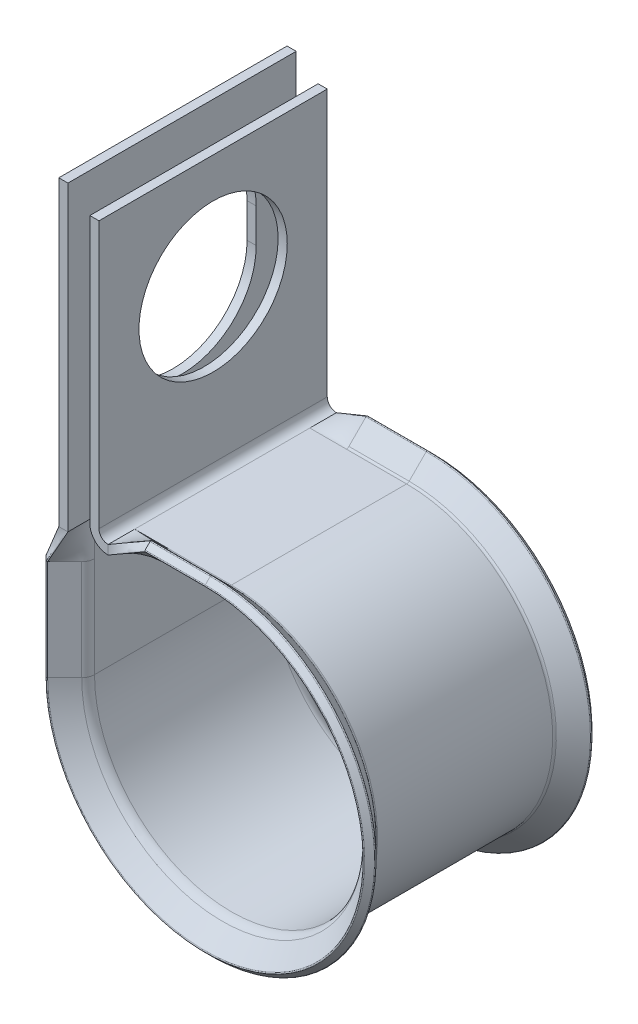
ISO-10303-21;
HEADER;
FILE_DESCRIPTION(('STEP AP214'),'2;1');
FILE_NAME('part.step','',(''),(''),'','','');
FILE_SCHEMA(('AUTOMOTIVE_DESIGN { 1 0 10303 214 1 1 1 1 }'));
ENDSEC;
DATA;
#1=APPLICATION_CONTEXT('core data for automotive mechanical design processes');
#2=APPLICATION_PROTOCOL_DEFINITION('international standard','automotive_design',2000,#1);
#3=PRODUCT_CONTEXT('',#1,'mechanical');
#4=PRODUCT('Part','Part','',(#3));
#5=PRODUCT_RELATED_PRODUCT_CATEGORY('part','',(#4));
#6=PRODUCT_DEFINITION_FORMATION('','',#4);
#7=PRODUCT_DEFINITION_CONTEXT('part definition',#1,'design');
#8=PRODUCT_DEFINITION('design','',#6,#7);
#9=PRODUCT_DEFINITION_SHAPE('','',#8);
#10=(LENGTH_UNIT() NAMED_UNIT(*) SI_UNIT(.MILLI.,.METRE.));
#11=(NAMED_UNIT(*) PLANE_ANGLE_UNIT() SI_UNIT($,.RADIAN.));
#12=(NAMED_UNIT(*) SI_UNIT($,.STERADIAN.) SOLID_ANGLE_UNIT());
#13=UNCERTAINTY_MEASURE_WITH_UNIT(LENGTH_MEASURE(1.E-05),#10,'distance_accuracy_value','');
#14=(GEOMETRIC_REPRESENTATION_CONTEXT(3) GLOBAL_UNCERTAINTY_ASSIGNED_CONTEXT((#13)) GLOBAL_UNIT_ASSIGNED_CONTEXT((#10,
#11,#12)) REPRESENTATION_CONTEXT('',''));
#15=CARTESIAN_POINT('',(0.,0.,0.));
#16=DIRECTION('',(0.,0.,1.));
#17=DIRECTION('',(1.,0.,0.));
#18=AXIS2_PLACEMENT_3D('',#15,#16,#17);
#19=CARTESIAN_POINT('',(5.334,-11.8872,6.08879458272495));
#20=DIRECTION('',(0.,0.,1.));
#21=DIRECTION('',(1.,0.,0.));
#22=AXIS2_PLACEMENT_3D('',#19,#20,#21);
#23=PLANE('',#22);
#24=DIRECTION('',(0.,1.,0.));
#25=VECTOR('',#24,1.);
#26=CARTESIAN_POINT('',(2.794,-11.8872,6.08879458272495));
#27=LINE('',#26,#25);
#28=CARTESIAN_POINT('',(2.794,-11.4010371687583,6.08879458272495));
#29=VERTEX_POINT('',#28);
#30=CARTESIAN_POINT('',(2.794,-11.2522,6.08879458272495));
#31=VERTEX_POINT('',#30);
#32=EDGE_CURVE('E902',#29,#31,#27,.T.);
#33=ORIENTED_EDGE('',*,*,#32,.F.);
#34=DIRECTION('',(0.998287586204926,0.0584969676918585,0.));
#35=VECTOR('',#34,1.);
#36=CARTESIAN_POINT('',(4.064,-11.3266185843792,6.08879458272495));
#37=LINE('',#36,#35);
#38=CARTESIAN_POINT('',(5.334,-11.2522,6.08879458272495));
#39=VERTEX_POINT('',#38);
#40=EDGE_CURVE('E1507',#29,#39,#37,.T.);
#41=ORIENTED_EDGE('',*,*,#40,.T.);
#42=DIRECTION('',(-1.,0.,0.));
#43=VECTOR('',#42,1.);
#44=CARTESIAN_POINT('',(9.525,-11.2522,6.08879458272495));
#45=LINE('',#44,#43);
#46=EDGE_CURVE('E1592',#39,#31,#45,.T.);
#47=ORIENTED_EDGE('',*,*,#46,.T.);
#48=EDGE_LOOP('',(#33,#41,#47));
#49=FACE_BOUND('',#48,.T.);
#50=ADVANCED_FACE('F543',(#49),#23,.T.);
#51=CARTESIAN_POINT('',(9.525,-11.8872,7.9375));
#52=DIRECTION('',(0.,-1.,0.));
#53=DIRECTION('',(0.,0.,-1.));
#54=AXIS2_PLACEMENT_3D('',#51,#52,#53);
#55=PLANE('',#54);
#56=DIRECTION('',(0.,0.,-1.));
#57=VECTOR('',#56,1.);
#58=CARTESIAN_POINT('',(2.794,-11.8872,7.9375));
#59=LINE('',#58,#57);
#60=CARTESIAN_POINT('',(2.794,-11.8872,6.08879458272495));
#61=VERTEX_POINT('',#60);
#62=CARTESIAN_POINT('',(2.794,-11.8872,-6.08879458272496));
#63=VERTEX_POINT('',#62);
#64=EDGE_CURVE('E875',#61,#63,#59,.T.);
#65=ORIENTED_EDGE('',*,*,#64,.T.);
#66=DIRECTION('',(-1.,0.,0.));
#67=VECTOR('',#66,1.);
#68=CARTESIAN_POINT('',(5.334,-11.8872,-6.08879458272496));
#69=LINE('',#68,#67);
#70=CARTESIAN_POINT('',(5.334,-11.8872,-6.08879458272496));
#71=VERTEX_POINT('',#70);
#72=EDGE_CURVE('E889',#71,#63,#69,.T.);
#73=ORIENTED_EDGE('',*,*,#72,.F.);
#74=DIRECTION('',(-1.,0.,0.));
#75=VECTOR('',#74,1.);
#76=CARTESIAN_POINT('',(9.525,-11.8872,-6.08879458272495));
#77=LINE('',#76,#75);
#78=CARTESIAN_POINT('',(9.525,-11.8872,-6.08879458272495));
#79=VERTEX_POINT('',#78);
#80=EDGE_CURVE('E915',#79,#71,#77,.T.);
#81=ORIENTED_EDGE('',*,*,#80,.F.);
#82=DIRECTION('',(0.,0.,-1.));
#83=VECTOR('',#82,1.);
#84=CARTESIAN_POINT('',(9.525,-11.8872,7.9375));
#85=LINE('',#84,#83);
#86=CARTESIAN_POINT('',(9.525,-11.8872,6.08879458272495));
#87=VERTEX_POINT('',#86);
#88=EDGE_CURVE('E894',#87,#79,#85,.T.);
#89=ORIENTED_EDGE('',*,*,#88,.F.);
#90=DIRECTION('',(-1.,0.,0.));
#91=VECTOR('',#90,1.);
#92=CARTESIAN_POINT('',(9.525,-11.8872,6.08879458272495));
#93=LINE('',#92,#91);
#94=CARTESIAN_POINT('',(5.334,-11.8872,6.08879458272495));
#95=VERTEX_POINT('',#94);
#96=EDGE_CURVE('E1216',#87,#95,#93,.T.);
#97=ORIENTED_EDGE('',*,*,#96,.T.);
#98=DIRECTION('',(-1.,0.,0.));
#99=VECTOR('',#98,1.);
#100=CARTESIAN_POINT('',(5.334,-11.8872,6.08879458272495));
#101=LINE('',#100,#99);
#102=EDGE_CURVE('E892',#95,#61,#101,.T.);
#103=ORIENTED_EDGE('',*,*,#102,.T.);
#104=EDGE_LOOP('',(#65,#73,#81,#89,#97,#103));
#105=FACE_BOUND('',#104,.T.);
#106=ADVANCED_FACE('F887',(#105),#55,.T.);
#107=CARTESIAN_POINT('',(9.525,-21.4122,7.9375));
#108=DIRECTION('',(0.,0.,-1.));
#109=DIRECTION('',(-1.,0.,0.));
#110=AXIS2_PLACEMENT_3D('',#107,#108,#109);
#111=CYLINDRICAL_SURFACE('',#110,9.525);
#112=ORIENTED_EDGE('',*,*,#88,.T.);
#113=CARTESIAN_POINT('',(9.52499999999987,-21.4121999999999,-6.08879458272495));
#114=DIRECTION('',(0.,0.,-1.));
#115=DIRECTION('',(-1.,0.,0.));
#116=AXIS2_PLACEMENT_3D('',#113,#114,#115);
#117=CIRCLE('',#116,9.52499999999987);
#118=CARTESIAN_POINT('',(0.,-21.4121999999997,-6.08879458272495));
#119=VERTEX_POINT('',#118);
#120=EDGE_CURVE('E1163',#79,#119,#117,.T.);
#121=ORIENTED_EDGE('',*,*,#120,.T.);
#122=DIRECTION('',(0.,0.,-1.));
#123=VECTOR('',#122,1.);
#124=CARTESIAN_POINT('',(0.,-21.4122,7.9375));
#125=LINE('',#124,#123);
#126=CARTESIAN_POINT('',(0.,-21.4121999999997,6.08879458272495));
#127=VERTEX_POINT('',#126);
#128=EDGE_CURVE('E1410',#127,#119,#125,.T.);
#129=ORIENTED_EDGE('',*,*,#128,.F.);
#130=CARTESIAN_POINT('',(9.52499999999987,-21.4121999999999,6.08879458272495));
#131=DIRECTION('',(0.,0.,-1.));
#132=DIRECTION('',(-1.,0.,0.));
#133=AXIS2_PLACEMENT_3D('',#130,#131,#132);
#134=CIRCLE('',#133,9.52499999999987);
#135=EDGE_CURVE('E1253',#87,#127,#134,.T.);
#136=ORIENTED_EDGE('',*,*,#135,.F.);
#137=EDGE_LOOP('',(#112,#121,#129,#136));
#138=FACE_BOUND('',#137,.T.);
#139=ADVANCED_FACE('F1665',(#138),#111,.F.);
#140=CARTESIAN_POINT('',(0.,-21.4122,7.9375));
#141=DIRECTION('',(1.,0.,0.));
#142=DIRECTION('',(0.,0.,-1.));
#143=AXIS2_PLACEMENT_3D('',#140,#141,#142);
#144=PLANE('',#143);
#145=CARTESIAN_POINT('',(0.,-1.1938,0.));
#146=DIRECTION('',(1.,0.,0.));
#147=DIRECTION('',(0.,0.,-1.));
#148=AXIS2_PLACEMENT_3D('',#145,#146,#147);
#149=CIRCLE('',#148,5.1562);
#150=CARTESIAN_POINT('',(0.,-1.1938,-5.1562));
#151=VERTEX_POINT('',#150);
#152=CARTESIAN_POINT('',(0.,-1.1938,5.1562));
#153=VERTEX_POINT('',#152);
#154=EDGE_CURVE('E1314',#151,#153,#149,.F.);
#155=ORIENTED_EDGE('',*,*,#154,.T.);
#156=DIRECTION('',(0.,1.,0.));
#157=VECTOR('',#156,1.);
#158=CARTESIAN_POINT('',(0.,-1.1938,5.1562));
#159=LINE('',#158,#157);
#160=CARTESIAN_POINT('',(0.,1.1938,5.1562));
#161=VERTEX_POINT('',#160);
#162=EDGE_CURVE('E1315',#153,#161,#159,.T.);
#163=ORIENTED_EDGE('',*,*,#162,.T.);
#164=CARTESIAN_POINT('',(0.,1.1938,0.));
#165=DIRECTION('',(1.,0.,0.));
#166=DIRECTION('',(0.,0.,-1.));
#167=AXIS2_PLACEMENT_3D('',#164,#165,#166);
#168=CIRCLE('',#167,5.1562);
#169=CARTESIAN_POINT('',(0.,1.1938,-5.1562));
#170=VERTEX_POINT('',#169);
#171=EDGE_CURVE('E1339',#161,#170,#168,.F.);
#172=ORIENTED_EDGE('',*,*,#171,.T.);
#173=DIRECTION('',(0.,-1.,0.));
#174=VECTOR('',#173,1.);
#175=CARTESIAN_POINT('',(0.,-1.1938,-5.1562));
#176=LINE('',#175,#174);
#177=EDGE_CURVE('E1335',#170,#151,#176,.T.);
#178=ORIENTED_EDGE('',*,*,#177,.T.);
#179=EDGE_LOOP('',(#155,#163,#172,#178));
#180=FACE_BOUND('',#179,.T.);
#181=ORIENTED_EDGE('',*,*,#128,.T.);
#182=DIRECTION('',(0.,1.,0.));
#183=VECTOR('',#182,1.);
#184=CARTESIAN_POINT('',(0.,-21.4121999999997,-6.08879458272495));
#185=LINE('',#184,#183);
#186=CARTESIAN_POINT('',(0.,-14.4271999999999,-6.08879458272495));
#187=VERTEX_POINT('',#186);
#188=EDGE_CURVE('E1185',#119,#187,#185,.T.);
#189=ORIENTED_EDGE('',*,*,#188,.T.);
#190=CARTESIAN_POINT('',(0.,-11.8871999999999,-6.08879458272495));
#191=VERTEX_POINT('',#190);
#192=EDGE_CURVE('E1184',#187,#191,#185,.T.);
#193=ORIENTED_EDGE('',*,*,#192,.T.);
#194=DIRECTION('',(0.,0.,-1.));
#195=VECTOR('',#194,1.);
#196=CARTESIAN_POINT('',(0.,-11.8871999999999,-7.9375));
#197=LINE('',#196,#195);
#198=CARTESIAN_POINT('',(0.,-11.8871999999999,-7.9375));
#199=VERTEX_POINT('',#198);
#200=EDGE_CURVE('E1302',#191,#199,#197,.T.);
#201=ORIENTED_EDGE('',*,*,#200,.T.);
#202=DIRECTION('',(0.,-1.,0.));
#203=VECTOR('',#202,1.);
#204=CARTESIAN_POINT('',(0.,-21.4122,-7.9375));
#205=LINE('',#204,#203);
#206=CARTESIAN_POINT('',(0.,9.1186,-7.9375));
#207=VERTEX_POINT('',#206);
#208=EDGE_CURVE('E1386',#207,#199,#205,.T.);
#209=ORIENTED_EDGE('',*,*,#208,.F.);
#210=DIRECTION('',(0.,0.,-1.));
#211=VECTOR('',#210,1.);
#212=CARTESIAN_POINT('',(0.,9.1186,7.9375));
#213=LINE('',#212,#211);
#214=CARTESIAN_POINT('',(0.,9.1186,7.9375));
#215=VERTEX_POINT('',#214);
#216=EDGE_CURVE('E1408',#215,#207,#213,.T.);
#217=ORIENTED_EDGE('',*,*,#216,.F.);
#218=DIRECTION('',(0.,-1.,0.));
#219=VECTOR('',#218,1.);
#220=CARTESIAN_POINT('',(0.,-21.4122,7.9375));
#221=LINE('',#220,#219);
#222=CARTESIAN_POINT('',(0.,-11.8871999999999,7.9375));
#223=VERTEX_POINT('',#222);
#224=EDGE_CURVE('E1365',#215,#223,#221,.T.);
#225=ORIENTED_EDGE('',*,*,#224,.T.);
#226=DIRECTION('',(0.,0.,-1.));
#227=VECTOR('',#226,1.);
#228=CARTESIAN_POINT('',(0.,-11.8871999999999,7.9375));
#229=LINE('',#228,#227);
#230=CARTESIAN_POINT('',(0.,-11.8871999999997,6.08879458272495));
#231=VERTEX_POINT('',#230);
#232=EDGE_CURVE('E1312',#223,#231,#229,.T.);
#233=ORIENTED_EDGE('',*,*,#232,.T.);
#234=DIRECTION('',(0.,1.,0.));
#235=VECTOR('',#234,1.);
#236=CARTESIAN_POINT('',(0.,-21.4121999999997,6.08879458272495));
#237=LINE('',#236,#235);
#238=CARTESIAN_POINT('',(0.,-14.4271999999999,6.08879458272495));
#239=VERTEX_POINT('',#238);
#240=EDGE_CURVE('E1277',#239,#231,#237,.T.);
#241=ORIENTED_EDGE('',*,*,#240,.F.);
#242=EDGE_CURVE('E1278',#127,#239,#237,.T.);
#243=ORIENTED_EDGE('',*,*,#242,.F.);
#244=EDGE_LOOP('',(#181,#189,#193,#201,#209,#217,#225,#233,#241,#243));
#245=FACE_BOUND('',#244,.T.);
#246=ADVANCED_FACE('F1763',(#180,#245),#144,.T.);
#247=CARTESIAN_POINT('',(-0.635,-21.4122,7.9375));
#248=DIRECTION('',(1.,0.,0.));
#249=DIRECTION('',(0.,0.,-1.));
#250=AXIS2_PLACEMENT_3D('',#247,#248,#249);
#251=PLANE('',#250);
#252=DIRECTION('',(0.,1.,0.));
#253=VECTOR('',#252,1.);
#254=CARTESIAN_POINT('',(-0.635,-1.1938,5.1562));
#255=LINE('',#254,#253);
#256=CARTESIAN_POINT('',(-0.635,-1.1938,5.1562));
#257=VERTEX_POINT('',#256);
#258=CARTESIAN_POINT('',(-0.635,1.1938,5.1562));
#259=VERTEX_POINT('',#258);
#260=EDGE_CURVE('E1327',#257,#259,#255,.T.);
#261=ORIENTED_EDGE('',*,*,#260,.F.);
#262=CARTESIAN_POINT('',(-0.635,-1.1938,0.));
#263=DIRECTION('',(-1.,0.,0.));
#264=DIRECTION('',(0.,-1.,0.));
#265=AXIS2_PLACEMENT_3D('',#262,#263,#264);
#266=CIRCLE('',#265,5.1562);
#267=CARTESIAN_POINT('',(-0.635,-1.1938,-5.1562));
#268=VERTEX_POINT('',#267);
#269=EDGE_CURVE('E1330',#268,#257,#266,.T.);
#270=ORIENTED_EDGE('',*,*,#269,.F.);
#271=DIRECTION('',(0.,-1.,0.));
#272=VECTOR('',#271,1.);
#273=CARTESIAN_POINT('',(-0.635,-1.1938,-5.1562));
#274=LINE('',#273,#272);
#275=CARTESIAN_POINT('',(-0.635,1.1938,-5.1562));
#276=VERTEX_POINT('',#275);
#277=EDGE_CURVE('E1320',#276,#268,#274,.T.);
#278=ORIENTED_EDGE('',*,*,#277,.F.);
#279=CARTESIAN_POINT('',(-0.635,1.1938,0.));
#280=DIRECTION('',(-1.,0.,0.));
#281=DIRECTION('',(0.,-1.,0.));
#282=AXIS2_PLACEMENT_3D('',#279,#280,#281);
#283=CIRCLE('',#282,5.1562);
#284=EDGE_CURVE('E1324',#259,#276,#283,.T.);
#285=ORIENTED_EDGE('',*,*,#284,.F.);
#286=EDGE_LOOP('',(#261,#270,#278,#285));
#287=FACE_BOUND('',#286,.T.);
#288=DIRECTION('',(0.,1.,0.));
#289=VECTOR('',#288,1.);
#290=CARTESIAN_POINT('',(-0.635000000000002,-21.4121999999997,-6.08879458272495));
#291=LINE('',#290,#289);
#292=CARTESIAN_POINT('',(-0.635000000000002,-21.4121999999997,-6.08879458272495));
#293=VERTEX_POINT('',#292);
#294=CARTESIAN_POINT('',(-0.635000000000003,-14.4271999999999,-6.08879458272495));
#295=VERTEX_POINT('',#294);
#296=EDGE_CURVE('E1188',#293,#295,#291,.T.);
#297=ORIENTED_EDGE('',*,*,#296,.F.);
#298=DIRECTION('',(0.,0.,-1.));
#299=VECTOR('',#298,1.);
#300=CARTESIAN_POINT('',(-0.634999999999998,-21.4122,7.9375));
#301=LINE('',#300,#299);
#302=CARTESIAN_POINT('',(-0.635000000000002,-21.4121999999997,6.08879458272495));
#303=VERTEX_POINT('',#302);
#304=EDGE_CURVE('E1404',#303,#293,#301,.T.);
#305=ORIENTED_EDGE('',*,*,#304,.F.);
#306=DIRECTION('',(0.,1.,0.));
#307=VECTOR('',#306,1.);
#308=CARTESIAN_POINT('',(-0.635000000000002,-21.4121999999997,6.08879458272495));
#309=LINE('',#308,#307);
#310=CARTESIAN_POINT('',(-0.635000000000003,-14.4271999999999,6.08879458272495));
#311=VERTEX_POINT('',#310);
#312=EDGE_CURVE('E1294',#303,#311,#309,.T.);
#313=ORIENTED_EDGE('',*,*,#312,.T.);
#314=DIRECTION('',(0.,1.,0.));
#315=VECTOR('',#314,1.);
#316=CARTESIAN_POINT('',(-0.635000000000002,-21.4121999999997,6.08879458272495));
#317=LINE('',#316,#315);
#318=CARTESIAN_POINT('',(-0.635000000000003,-11.8871999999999,6.08879458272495));
#319=VERTEX_POINT('',#318);
#320=EDGE_CURVE('E2637',#319,#311,#317,.F.);
#321=ORIENTED_EDGE('',*,*,#320,.F.);
#322=DIRECTION('',(0.,0.,1.));
#323=VECTOR('',#322,1.);
#324=CARTESIAN_POINT('',(-0.635000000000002,-11.8871999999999,7.9375));
#325=LINE('',#324,#323);
#326=CARTESIAN_POINT('',(-0.635000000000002,-11.8871999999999,7.9375));
#327=VERTEX_POINT('',#326);
#328=EDGE_CURVE('E1310',#319,#327,#325,.T.);
#329=ORIENTED_EDGE('',*,*,#328,.T.);
#330=DIRECTION('',(0.,1.,0.));
#331=VECTOR('',#330,1.);
#332=CARTESIAN_POINT('',(-0.635,-21.4122,7.9375));
#333=LINE('',#332,#331);
#334=CARTESIAN_POINT('',(-0.635,9.1186,7.9375));
#335=VERTEX_POINT('',#334);
#336=EDGE_CURVE('E1371',#335,#327,#333,.F.);
#337=ORIENTED_EDGE('',*,*,#336,.F.);
#338=DIRECTION('',(0.,0.,-1.));
#339=VECTOR('',#338,1.);
#340=CARTESIAN_POINT('',(-0.635,9.1186,7.9375));
#341=LINE('',#340,#339);
#342=CARTESIAN_POINT('',(-0.635,9.1186,-7.9375));
#343=VERTEX_POINT('',#342);
#344=EDGE_CURVE('E1406',#335,#343,#341,.T.);
#345=ORIENTED_EDGE('',*,*,#344,.T.);
#346=DIRECTION('',(0.,1.,0.));
#347=VECTOR('',#346,1.);
#348=CARTESIAN_POINT('',(-0.635,-21.4122,-7.9375));
#349=LINE('',#348,#347);
#350=CARTESIAN_POINT('',(-0.635000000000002,-11.8871999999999,-7.9375));
#351=VERTEX_POINT('',#350);
#352=EDGE_CURVE('E1392',#343,#351,#349,.F.);
#353=ORIENTED_EDGE('',*,*,#352,.T.);
#354=DIRECTION('',(0.,0.,1.));
#355=VECTOR('',#354,1.);
#356=CARTESIAN_POINT('',(-0.635000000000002,-11.8871999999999,-7.9375));
#357=LINE('',#356,#355);
#358=CARTESIAN_POINT('',(-0.635000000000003,-11.8871999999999,-6.08879458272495));
#359=VERTEX_POINT('',#358);
#360=EDGE_CURVE('E1304',#351,#359,#357,.T.);
#361=ORIENTED_EDGE('',*,*,#360,.T.);
#362=DIRECTION('',(0.,1.,0.));
#363=VECTOR('',#362,1.);
#364=CARTESIAN_POINT('',(-0.635000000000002,-21.4121999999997,-6.08879458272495));
#365=LINE('',#364,#363);
#366=EDGE_CURVE('E1119',#295,#359,#365,.T.);
#367=ORIENTED_EDGE('',*,*,#366,.F.);
#368=EDGE_LOOP('',(#297,#305,#313,#321,#329,#337,#345,#353,#361,#367));
#369=FACE_BOUND('',#368,.T.);
#370=ADVANCED_FACE('F1759',(#287,#369),#251,.F.);
#371=CARTESIAN_POINT('',(9.525,-21.4122,7.9375));
#372=DIRECTION('',(0.,0.,-1.));
#373=DIRECTION('',(-1.,0.,0.));
#374=AXIS2_PLACEMENT_3D('',#371,#372,#373);
#375=CYLINDRICAL_SURFACE('',#374,10.16);
#376=ORIENTED_EDGE('',*,*,#304,.T.);
#377=CARTESIAN_POINT('',(9.52499999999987,-21.4121999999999,-6.08879458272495));
#378=DIRECTION('',(0.,0.,-1.));
#379=DIRECTION('',(-1.,0.,0.));
#380=AXIS2_PLACEMENT_3D('',#377,#378,#379);
#381=CIRCLE('',#380,10.1599999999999);
#382=CARTESIAN_POINT('',(9.525,-11.2522,-6.08879458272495));
#383=VERTEX_POINT('',#382);
#384=EDGE_CURVE('E1166',#383,#293,#381,.T.);
#385=ORIENTED_EDGE('',*,*,#384,.F.);
#386=DIRECTION('',(0.,0.,-1.));
#387=VECTOR('',#386,1.);
#388=CARTESIAN_POINT('',(9.525,-11.2522,7.9375));
#389=LINE('',#388,#387);
#390=CARTESIAN_POINT('',(9.525,-11.2522,6.08879458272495));
#391=VERTEX_POINT('',#390);
#392=EDGE_CURVE('E1402',#391,#383,#389,.T.);
#393=ORIENTED_EDGE('',*,*,#392,.F.);
#394=CARTESIAN_POINT('',(9.52499999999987,-21.4121999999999,6.08879458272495));
#395=DIRECTION('',(0.,0.,-1.));
#396=DIRECTION('',(-1.,0.,0.));
#397=AXIS2_PLACEMENT_3D('',#394,#395,#396);
#398=CIRCLE('',#397,10.1599999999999);
#399=EDGE_CURVE('E1274',#391,#303,#398,.T.);
#400=ORIENTED_EDGE('',*,*,#399,.T.);
#401=EDGE_LOOP('',(#376,#385,#393,#400));
#402=FACE_BOUND('',#401,.T.);
#403=ADVANCED_FACE('F1755',(#402),#375,.T.);
#404=CARTESIAN_POINT('',(9.525,-11.2522,7.9375));
#405=DIRECTION('',(0.,-1.,0.));
#406=DIRECTION('',(0.,0.,-1.));
#407=AXIS2_PLACEMENT_3D('',#404,#405,#406);
#408=PLANE('',#407);
#409=ORIENTED_EDGE('',*,*,#392,.T.);
#410=DIRECTION('',(-1.,0.,0.));
#411=VECTOR('',#410,1.);
#412=CARTESIAN_POINT('',(9.525,-11.2522,-6.08879458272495));
#413=LINE('',#412,#411);
#414=CARTESIAN_POINT('',(5.334,-11.2522,-6.08879458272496));
#415=VERTEX_POINT('',#414);
#416=EDGE_CURVE('E917',#383,#415,#413,.T.);
#417=ORIENTED_EDGE('',*,*,#416,.T.);
#418=DIRECTION('',(-1.,0.,0.));
#419=VECTOR('',#418,1.);
#420=CARTESIAN_POINT('',(9.525,-11.2522,-6.08879458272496));
#421=LINE('',#420,#419);
#422=CARTESIAN_POINT('',(2.794,-11.2522,-6.08879458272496));
#423=VERTEX_POINT('',#422);
#424=EDGE_CURVE('E1102',#423,#415,#421,.F.);
#425=ORIENTED_EDGE('',*,*,#424,.F.);
#426=DIRECTION('',(0.,0.,-1.));
#427=VECTOR('',#426,1.);
#428=CARTESIAN_POINT('',(2.794,-11.2522,7.9375));
#429=LINE('',#428,#427);
#430=EDGE_CURVE('E1398',#31,#423,#429,.T.);
#431=ORIENTED_EDGE('',*,*,#430,.F.);
#432=ORIENTED_EDGE('',*,*,#46,.F.);
#433=DIRECTION('',(-1.,0.,0.));
#434=VECTOR('',#433,1.);
#435=CARTESIAN_POINT('',(9.525,-11.2522,6.08879458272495));
#436=LINE('',#435,#434);
#437=EDGE_CURVE('E1228',#391,#39,#436,.T.);
#438=ORIENTED_EDGE('',*,*,#437,.F.);
#439=EDGE_LOOP('',(#409,#417,#425,#431,#432,#438));
#440=FACE_BOUND('',#439,.T.);
#441=ADVANCED_FACE('F1752',(#440),#408,.F.);
#442=CARTESIAN_POINT('',(2.794,-10.6172,-7.9375));
#443=DIRECTION('',(0.,0.,-1.));
#444=DIRECTION('',(-1.,0.,0.));
#445=AXIS2_PLACEMENT_3D('',#442,#443,#444);
#446=PLANE('',#445);
#447=ORIENTED_EDGE('',*,*,#208,.T.);
#448=DIRECTION('',(-1.,0.,0.));
#449=VECTOR('',#448,1.);
#450=CARTESIAN_POINT('',(-0.635000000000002,-11.8871999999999,-7.9375));
#451=LINE('',#450,#449);
#452=EDGE_CURVE('E882',#199,#351,#451,.T.);
#453=ORIENTED_EDGE('',*,*,#452,.T.);
#454=ORIENTED_EDGE('',*,*,#352,.F.);
#455=DIRECTION('',(1.,0.,0.));
#456=VECTOR('',#455,1.);
#457=CARTESIAN_POINT('',(-0.635,9.1186,-7.9375));
#458=LINE('',#457,#456);
#459=EDGE_CURVE('E1389',#343,#207,#458,.T.);
#460=ORIENTED_EDGE('',*,*,#459,.T.);
#461=EDGE_LOOP('',(#447,#453,#454,#460));
#462=FACE_BOUND('',#461,.T.);
#463=ADVANCED_FACE('F1747',(#462),#446,.T.);
#464=CARTESIAN_POINT('',(2.794,-10.6172,7.9375));
#465=DIRECTION('',(0.,0.,-1.));
#466=DIRECTION('',(-1.,0.,0.));
#467=AXIS2_PLACEMENT_3D('',#464,#465,#466);
#468=PLANE('',#467);
#469=DIRECTION('',(0.,-1.,0.));
#470=VECTOR('',#469,1.);
#471=CARTESIAN_POINT('',(2.794,-11.2522,7.9375));
#472=LINE('',#471,#470);
#473=CARTESIAN_POINT('',(2.794,-11.2522,7.9375));
#474=VERTEX_POINT('',#473);
#475=CARTESIAN_POINT('',(2.794,-11.8872,7.9375));
#476=VERTEX_POINT('',#475);
#477=EDGE_CURVE('E1306',#474,#476,#472,.T.);
#478=ORIENTED_EDGE('',*,*,#477,.F.);
#479=CARTESIAN_POINT('',(2.794,-10.6172,7.9375));
#480=DIRECTION('',(0.,0.,1.));
#481=DIRECTION('',(1.,0.,0.));
#482=AXIS2_PLACEMENT_3D('',#479,#480,#481);
#483=CIRCLE('',#482,0.635000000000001);
#484=CARTESIAN_POINT('',(2.159,-10.6172,7.9375));
#485=VERTEX_POINT('',#484);
#486=EDGE_CURVE('E1374',#474,#485,#483,.F.);
#487=ORIENTED_EDGE('',*,*,#486,.T.);
#488=DIRECTION('',(0.,1.,0.));
#489=VECTOR('',#488,1.);
#490=CARTESIAN_POINT('',(2.159,-10.6172,7.9375));
#491=LINE('',#490,#489);
#492=CARTESIAN_POINT('',(2.159,7.9248,7.9375));
#493=VERTEX_POINT('',#492);
#494=EDGE_CURVE('E1353',#485,#493,#491,.T.);
#495=ORIENTED_EDGE('',*,*,#494,.T.);
#496=DIRECTION('',(1.,0.,0.));
#497=VECTOR('',#496,1.);
#498=CARTESIAN_POINT('',(1.524,7.9248,7.9375));
#499=LINE('',#498,#497);
#500=CARTESIAN_POINT('',(1.524,7.9248,7.9375));
#501=VERTEX_POINT('',#500);
#502=EDGE_CURVE('E1355',#501,#493,#499,.T.);
#503=ORIENTED_EDGE('',*,*,#502,.F.);
#504=DIRECTION('',(0.,1.,0.));
#505=VECTOR('',#504,1.);
#506=CARTESIAN_POINT('',(1.524,-10.6172,7.9375));
#507=LINE('',#506,#505);
#508=CARTESIAN_POINT('',(1.524,-10.6172,7.9375));
#509=VERTEX_POINT('',#508);
#510=EDGE_CURVE('E1359',#509,#501,#507,.T.);
#511=ORIENTED_EDGE('',*,*,#510,.F.);
#512=CARTESIAN_POINT('',(2.794,-10.6172,7.9375));
#513=DIRECTION('',(0.,0.,-1.));
#514=DIRECTION('',(-1.,0.,0.));
#515=AXIS2_PLACEMENT_3D('',#512,#513,#514);
#516=CIRCLE('',#515,1.27);
#517=EDGE_CURVE('E1362',#476,#509,#516,.T.);
#518=ORIENTED_EDGE('',*,*,#517,.F.);
#519=EDGE_LOOP('',(#478,#487,#495,#503,#511,#518));
#520=FACE_BOUND('',#519,.T.);
#521=ADVANCED_FACE('F1743',(#520),#468,.F.);
#522=CARTESIAN_POINT('',(2.159,-10.6172,7.9375));
#523=DIRECTION('',(-1.,0.,0.));
#524=DIRECTION('',(0.,-1.,0.));
#525=AXIS2_PLACEMENT_3D('',#522,#523,#524);
#526=PLANE('',#525);
#527=CARTESIAN_POINT('',(2.159,0.,0.));
#528=DIRECTION('',(1.,0.,0.));
#529=DIRECTION('',(0.,0.,-1.));
#530=AXIS2_PLACEMENT_3D('',#527,#528,#529);
#531=CIRCLE('',#530,5.1562);
#532=CARTESIAN_POINT('',(2.159,0.,-5.1562));
#533=VERTEX_POINT('',#532);
#534=EDGE_CURVE('E1349',#533,#533,#531,.T.);
#535=ORIENTED_EDGE('',*,*,#534,.F.);
#536=EDGE_LOOP('',(#535));
#537=FACE_BOUND('',#536,.T.);
#538=DIRECTION('',(0.,1.,0.));
#539=VECTOR('',#538,1.);
#540=CARTESIAN_POINT('',(2.159,-10.6172,-7.9375));
#541=LINE('',#540,#539);
#542=CARTESIAN_POINT('',(2.159,-10.6172,-7.9375));
#543=VERTEX_POINT('',#542);
#544=CARTESIAN_POINT('',(2.159,7.9248,-7.9375));
#545=VERTEX_POINT('',#544);
#546=EDGE_CURVE('E1352',#543,#545,#541,.T.);
#547=ORIENTED_EDGE('',*,*,#546,.T.);
#548=DIRECTION('',(0.,0.,-1.));
#549=VECTOR('',#548,1.);
#550=CARTESIAN_POINT('',(2.159,7.9248,7.9375));
#551=LINE('',#550,#549);
#552=EDGE_CURVE('E1417',#493,#545,#551,.T.);
#553=ORIENTED_EDGE('',*,*,#552,.F.);
#554=ORIENTED_EDGE('',*,*,#494,.F.);
#555=DIRECTION('',(0.,0.,-1.));
#556=VECTOR('',#555,1.);
#557=CARTESIAN_POINT('',(2.159,-10.6172,7.9375));
#558=LINE('',#557,#556);
#559=EDGE_CURVE('E1376',#485,#543,#558,.T.);
#560=ORIENTED_EDGE('',*,*,#559,.T.);
#561=EDGE_LOOP('',(#547,#553,#554,#560));
#562=FACE_BOUND('',#561,.T.);
#563=ADVANCED_FACE('F545',(#537,#562),#526,.F.);
#564=CARTESIAN_POINT('',(1.524,7.9248,7.9375));
#565=DIRECTION('',(0.,1.,0.));
#566=DIRECTION('',(-1.,0.,0.));
#567=AXIS2_PLACEMENT_3D('',#564,#565,#566);
#568=PLANE('',#567);
#569=DIRECTION('',(1.,0.,0.));
#570=VECTOR('',#569,1.);
#571=CARTESIAN_POINT('',(1.524,7.9248,-7.9375));
#572=LINE('',#571,#570);
#573=CARTESIAN_POINT('',(1.524,7.9248,-7.9375));
#574=VERTEX_POINT('',#573);
#575=EDGE_CURVE('E1379',#574,#545,#572,.T.);
#576=ORIENTED_EDGE('',*,*,#575,.F.);
#577=DIRECTION('',(0.,0.,-1.));
#578=VECTOR('',#577,1.);
#579=CARTESIAN_POINT('',(1.524,7.9248,7.9375));
#580=LINE('',#579,#578);
#581=EDGE_CURVE('E1415',#501,#574,#580,.T.);
#582=ORIENTED_EDGE('',*,*,#581,.F.);
#583=ORIENTED_EDGE('',*,*,#502,.T.);
#584=ORIENTED_EDGE('',*,*,#552,.T.);
#585=EDGE_LOOP('',(#576,#582,#583,#584));
#586=FACE_BOUND('',#585,.T.);
#587=ADVANCED_FACE('F1778',(#586),#568,.T.);
#588=CARTESIAN_POINT('',(1.524,-10.6172,7.9375));
#589=DIRECTION('',(-1.,0.,0.));
#590=DIRECTION('',(0.,-1.,0.));
#591=AXIS2_PLACEMENT_3D('',#588,#589,#590);
#592=PLANE('',#591);
#593=CARTESIAN_POINT('',(1.524,0.,0.));
#594=DIRECTION('',(-1.,0.,0.));
#595=DIRECTION('',(0.,-1.,0.));
#596=AXIS2_PLACEMENT_3D('',#593,#594,#595);
#597=CIRCLE('',#596,5.1562);
#598=CARTESIAN_POINT('',(1.524,0.,-5.1562));
#599=VERTEX_POINT('',#598);
#600=EDGE_CURVE('E1323',#599,#599,#597,.F.);
#601=ORIENTED_EDGE('',*,*,#600,.T.);
#602=EDGE_LOOP('',(#601));
#603=FACE_BOUND('',#602,.T.);
#604=DIRECTION('',(0.,1.,0.));
#605=VECTOR('',#604,1.);
#606=CARTESIAN_POINT('',(1.524,-10.6172,-7.9375));
#607=LINE('',#606,#605);
#608=CARTESIAN_POINT('',(1.524,-10.6172,-7.9375));
#609=VERTEX_POINT('',#608);
#610=EDGE_CURVE('E1382',#609,#574,#607,.T.);
#611=ORIENTED_EDGE('',*,*,#610,.F.);
#612=DIRECTION('',(0.,0.,-1.));
#613=VECTOR('',#612,1.);
#614=CARTESIAN_POINT('',(1.524,-10.6172,7.9375));
#615=LINE('',#614,#613);
#616=EDGE_CURVE('E1413',#509,#609,#615,.T.);
#617=ORIENTED_EDGE('',*,*,#616,.F.);
#618=ORIENTED_EDGE('',*,*,#510,.T.);
#619=ORIENTED_EDGE('',*,*,#581,.T.);
#620=EDGE_LOOP('',(#611,#617,#618,#619));
#621=FACE_BOUND('',#620,.T.);
#622=ADVANCED_FACE('F1776',(#603,#621),#592,.T.);
#623=CARTESIAN_POINT('',(2.794,-10.6172,7.9375));
#624=DIRECTION('',(0.,0.,-1.));
#625=DIRECTION('',(-1.,0.,0.));
#626=AXIS2_PLACEMENT_3D('',#623,#624,#625);
#627=CYLINDRICAL_SURFACE('',#626,1.27);
#628=CARTESIAN_POINT('',(2.794,-10.6172,-7.9375));
#629=DIRECTION('',(0.,0.,-1.));
#630=DIRECTION('',(-1.,0.,0.));
#631=AXIS2_PLACEMENT_3D('',#628,#629,#630);
#632=CIRCLE('',#631,1.27);
#633=CARTESIAN_POINT('',(2.794,-11.8872,-7.9375));
#634=VERTEX_POINT('',#633);
#635=EDGE_CURVE('E877',#634,#609,#632,.T.);
#636=ORIENTED_EDGE('',*,*,#635,.F.);
#637=DIRECTION('',(0.,0.,-1.));
#638=VECTOR('',#637,1.);
#639=CARTESIAN_POINT('',(2.794,-11.8872,-7.9375));
#640=LINE('',#639,#638);
#641=EDGE_CURVE('E871',#63,#634,#640,.T.);
#642=ORIENTED_EDGE('',*,*,#641,.F.);
#643=ORIENTED_EDGE('',*,*,#64,.F.);
#644=EDGE_CURVE('E893',#476,#61,#59,.T.);
#645=ORIENTED_EDGE('',*,*,#644,.F.);
#646=ORIENTED_EDGE('',*,*,#517,.T.);
#647=ORIENTED_EDGE('',*,*,#616,.T.);
#648=EDGE_LOOP('',(#636,#642,#643,#645,#646,#647));
#649=FACE_BOUND('',#648,.T.);
#650=ADVANCED_FACE('F873',(#649),#627,.T.);
#651=CARTESIAN_POINT('',(-0.635,9.1186,7.9375));
#652=DIRECTION('',(0.,1.,0.));
#653=DIRECTION('',(-1.,0.,0.));
#654=AXIS2_PLACEMENT_3D('',#651,#652,#653);
#655=PLANE('',#654);
#656=ORIENTED_EDGE('',*,*,#459,.F.);
#657=ORIENTED_EDGE('',*,*,#344,.F.);
#658=DIRECTION('',(1.,0.,0.));
#659=VECTOR('',#658,1.);
#660=CARTESIAN_POINT('',(-0.635,9.1186,7.9375));
#661=LINE('',#660,#659);
#662=EDGE_CURVE('E1368',#335,#215,#661,.T.);
#663=ORIENTED_EDGE('',*,*,#662,.T.);
#664=ORIENTED_EDGE('',*,*,#216,.T.);
#665=EDGE_LOOP('',(#656,#657,#663,#664));
#666=FACE_BOUND('',#665,.T.);
#667=ADVANCED_FACE('F1750',(#666),#655,.T.);
#668=CARTESIAN_POINT('',(2.794,-10.6172,7.9375));
#669=DIRECTION('',(0.,0.,-1.));
#670=DIRECTION('',(-1.,0.,0.));
#671=AXIS2_PLACEMENT_3D('',#668,#669,#670);
#672=CYLINDRICAL_SURFACE('',#671,0.635000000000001);
#673=CARTESIAN_POINT('',(2.794,-10.6172,-7.9375));
#674=DIRECTION('',(0.,0.,1.));
#675=DIRECTION('',(1.,0.,0.));
#676=AXIS2_PLACEMENT_3D('',#673,#674,#675);
#677=CIRCLE('',#676,0.635000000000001);
#678=CARTESIAN_POINT('',(2.794,-11.2522,-7.9375));
#679=VERTEX_POINT('',#678);
#680=EDGE_CURVE('E1356',#679,#543,#677,.F.);
#681=ORIENTED_EDGE('',*,*,#680,.T.);
#682=ORIENTED_EDGE('',*,*,#559,.F.);
#683=ORIENTED_EDGE('',*,*,#486,.F.);
#684=EDGE_CURVE('E1399',#474,#31,#429,.T.);
#685=ORIENTED_EDGE('',*,*,#684,.T.);
#686=ORIENTED_EDGE('',*,*,#430,.T.);
#687=DIRECTION('',(0.,0.,1.));
#688=VECTOR('',#687,1.);
#689=CARTESIAN_POINT('',(2.794,-11.2522,-7.9375));
#690=LINE('',#689,#688);
#691=EDGE_CURVE('E883',#679,#423,#690,.T.);
#692=ORIENTED_EDGE('',*,*,#691,.F.);
#693=EDGE_LOOP('',(#681,#682,#683,#685,#686,#692));
#694=FACE_BOUND('',#693,.T.);
#695=ADVANCED_FACE('F1741',(#694),#672,.F.);
#696=ORIENTED_EDGE('',*,*,#336,.T.);
#697=DIRECTION('',(1.,0.,0.));
#698=VECTOR('',#697,1.);
#699=CARTESIAN_POINT('',(-0.635000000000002,-11.8871999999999,7.9375));
#700=LINE('',#699,#698);
#701=EDGE_CURVE('E1308',#327,#223,#700,.T.);
#702=ORIENTED_EDGE('',*,*,#701,.T.);
#703=ORIENTED_EDGE('',*,*,#224,.F.);
#704=ORIENTED_EDGE('',*,*,#662,.F.);
#705=EDGE_LOOP('',(#696,#702,#703,#704));
#706=FACE_BOUND('',#705,.T.);
#707=ADVANCED_FACE('F1738',(#706),#468,.F.);
#708=DIRECTION('',(0.,1.,0.));
#709=VECTOR('',#708,1.);
#710=CARTESIAN_POINT('',(2.794,-11.2522,-7.9375));
#711=LINE('',#710,#709);
#712=EDGE_CURVE('E1297',#634,#679,#711,.T.);
#713=ORIENTED_EDGE('',*,*,#712,.F.);
#714=ORIENTED_EDGE('',*,*,#635,.T.);
#715=ORIENTED_EDGE('',*,*,#610,.T.);
#716=ORIENTED_EDGE('',*,*,#575,.T.);
#717=ORIENTED_EDGE('',*,*,#546,.F.);
#718=ORIENTED_EDGE('',*,*,#680,.F.);
#719=EDGE_LOOP('',(#713,#714,#715,#716,#717,#718));
#720=FACE_BOUND('',#719,.T.);
#721=ADVANCED_FACE('F1736',(#720),#446,.T.);
#722=CARTESIAN_POINT('',(-0.636,0.,0.));
#723=DIRECTION('',(1.,0.,0.));
#724=DIRECTION('',(0.,0.,-1.));
#725=AXIS2_PLACEMENT_3D('',#722,#723,#724);
#726=CYLINDRICAL_SURFACE('',#725,5.1562);
#727=CARTESIAN_POINT('',(1.524,0.,-5.1562));
#728=CARTESIAN_POINT('',(1.53061458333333,0.,-5.1562));
#729=CARTESIAN_POINT('',(1.53722916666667,0.,-5.1562));
#730=CARTESIAN_POINT('',(1.55045833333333,0.,-5.1562));
#731=CARTESIAN_POINT('',(1.55707291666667,0.,-5.1562));
#732=CARTESIAN_POINT('',(1.57030208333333,0.,-5.1562));
#733=CARTESIAN_POINT('',(1.57691666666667,0.,-5.1562));
#734=CARTESIAN_POINT('',(1.59014583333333,0.,-5.1562));
#735=CARTESIAN_POINT('',(1.59676041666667,0.,-5.1562));
#736=CARTESIAN_POINT('',(1.60998958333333,0.,-5.1562));
#737=CARTESIAN_POINT('',(1.61660416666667,0.,-5.1562));
#738=CARTESIAN_POINT('',(1.62983333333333,0.,-5.1562));
#739=CARTESIAN_POINT('',(1.63644791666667,0.,-5.1562));
#740=CARTESIAN_POINT('',(1.64967708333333,0.,-5.1562));
#741=CARTESIAN_POINT('',(1.65629166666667,0.,-5.1562));
#742=CARTESIAN_POINT('',(1.66952083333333,0.,-5.1562));
#743=CARTESIAN_POINT('',(1.67613541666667,0.,-5.1562));
#744=CARTESIAN_POINT('',(1.68936458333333,0.,-5.1562));
#745=CARTESIAN_POINT('',(1.69597916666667,0.,-5.1562));
#746=CARTESIAN_POINT('',(1.70920833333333,0.,-5.1562));
#747=CARTESIAN_POINT('',(1.71582291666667,0.,-5.1562));
#748=CARTESIAN_POINT('',(1.72905208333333,0.,-5.1562));
#749=CARTESIAN_POINT('',(1.73566666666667,0.,-5.1562));
#750=CARTESIAN_POINT('',(1.74889583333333,0.,-5.1562));
#751=CARTESIAN_POINT('',(1.75551041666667,0.,-5.1562));
#752=CARTESIAN_POINT('',(1.76873958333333,0.,-5.1562));
#753=CARTESIAN_POINT('',(1.77535416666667,0.,-5.1562));
#754=CARTESIAN_POINT('',(1.78858333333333,0.,-5.1562));
#755=CARTESIAN_POINT('',(1.79519791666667,0.,-5.1562));
#756=CARTESIAN_POINT('',(1.80842708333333,0.,-5.1562));
#757=CARTESIAN_POINT('',(1.81504166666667,0.,-5.1562));
#758=CARTESIAN_POINT('',(1.82827083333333,0.,-5.1562));
#759=CARTESIAN_POINT('',(1.83488541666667,0.,-5.1562));
#760=CARTESIAN_POINT('',(1.84811458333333,0.,-5.1562));
#761=CARTESIAN_POINT('',(1.85472916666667,0.,-5.1562));
#762=CARTESIAN_POINT('',(1.86795833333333,0.,-5.1562));
#763=CARTESIAN_POINT('',(1.87457291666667,0.,-5.1562));
#764=CARTESIAN_POINT('',(1.88780208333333,0.,-5.1562));
#765=CARTESIAN_POINT('',(1.89441666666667,0.,-5.1562));
#766=CARTESIAN_POINT('',(1.90764583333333,0.,-5.1562));
#767=CARTESIAN_POINT('',(1.91426041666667,0.,-5.1562));
#768=CARTESIAN_POINT('',(1.92748958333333,0.,-5.1562));
#769=CARTESIAN_POINT('',(1.93410416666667,0.,-5.1562));
#770=CARTESIAN_POINT('',(1.94733333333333,0.,-5.1562));
#771=CARTESIAN_POINT('',(1.95394791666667,0.,-5.1562));
#772=CARTESIAN_POINT('',(1.96717708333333,0.,-5.1562));
#773=CARTESIAN_POINT('',(1.97379166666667,0.,-5.1562));
#774=CARTESIAN_POINT('',(1.98702083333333,0.,-5.1562));
#775=CARTESIAN_POINT('',(1.99363541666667,0.,-5.1562));
#776=CARTESIAN_POINT('',(2.00686458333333,0.,-5.1562));
#777=CARTESIAN_POINT('',(2.01347916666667,0.,-5.1562));
#778=CARTESIAN_POINT('',(2.02670833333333,0.,-5.1562));
#779=CARTESIAN_POINT('',(2.03332291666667,0.,-5.1562));
#780=CARTESIAN_POINT('',(2.04655208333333,0.,-5.1562));
#781=CARTESIAN_POINT('',(2.05316666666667,0.,-5.1562));
#782=CARTESIAN_POINT('',(2.06639583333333,0.,-5.1562));
#783=CARTESIAN_POINT('',(2.07301041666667,0.,-5.1562));
#784=CARTESIAN_POINT('',(2.08623958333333,0.,-5.1562));
#785=CARTESIAN_POINT('',(2.09285416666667,0.,-5.1562));
#786=CARTESIAN_POINT('',(2.10608333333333,0.,-5.1562));
#787=CARTESIAN_POINT('',(2.11269791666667,0.,-5.1562));
#788=CARTESIAN_POINT('',(2.12592708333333,0.,-5.1562));
#789=CARTESIAN_POINT('',(2.13254166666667,0.,-5.1562));
#790=CARTESIAN_POINT('',(2.14577083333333,0.,-5.1562));
#791=CARTESIAN_POINT('',(2.15238541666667,0.,-5.1562));
#792=CARTESIAN_POINT('',(2.159,0.,-5.1562));
#793=B_SPLINE_CURVE_WITH_KNOTS('',3,(#727,#728,#729,#730,#731,#732,#733,#734,#735,#736,#737,
#738,#739,#740,#741,#742,#743,#744,#745,#746,#747,#748,#749,#750,#751,#752,#753,#754,#755,#756,
#757,#758,#759,#760,#761,#762,#763,#764,#765,#766,#767,#768,#769,#770,#771,#772,#773,#774,#775,
#776,#777,#778,#779,#780,#781,#782,#783,#784,#785,#786,#787,#788,#789,#790,#791,#792),
.UNSPECIFIED.,.F.,.F.,(4,2,2,2,2,2,2,2,2,2,2,2,2,2,2,2,2,2,2,2,2,2,2,2,2,2,2,2,2,2,2,2,4),(0.,
0.0198437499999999,0.0396874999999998,0.0595312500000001,0.079375,0.0992187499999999,0.1190625,
0.13890625,0.15875,0.17859375,0.1984375,0.21828125,0.238125,0.25796875,0.2778125,0.29765625,
0.3175,0.33734375,0.357187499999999,0.37703125,0.396875,0.41671875,0.436562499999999,
0.456406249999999,0.476249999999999,0.49609375,0.515937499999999,0.535781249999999,
0.555624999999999,0.57546875,0.595312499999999,0.615156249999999,0.634999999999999),.UNSPECIFIED.);
#794=EDGE_CURVE('BSEAM1722',#599,#533,#793,.T.);
#795=ORIENTED_EDGE('',*,*,#600,.F.);
#796=ORIENTED_EDGE('',*,*,#534,.T.);
#797=ORIENTED_EDGE('',*,*,#794,.T.);
#798=ORIENTED_EDGE('',*,*,#794,.F.);
#799=EDGE_LOOP('',(#795,#797,#796,#798));
#800=FACE_BOUND('',#799,.T.);
#801=ADVANCED_FACE('F1722',(#800),#726,.F.);
#802=CARTESIAN_POINT('',(19.686,-1.1938,0.));
#803=DIRECTION('',(-1.,0.,0.));
#804=DIRECTION('',(0.,-1.,0.));
#805=AXIS2_PLACEMENT_3D('',#802,#803,#804);
#806=CYLINDRICAL_SURFACE('',#805,5.1562);
#807=DIRECTION('',(-1.,0.,0.));
#808=VECTOR('',#807,1.);
#809=CARTESIAN_POINT('',(19.686,-1.1938,-5.1562));
#810=LINE('',#809,#808);
#811=EDGE_CURVE('E1338',#151,#268,#810,.T.);
#812=ORIENTED_EDGE('',*,*,#811,.T.);
#813=ORIENTED_EDGE('',*,*,#269,.T.);
#814=DIRECTION('',(-1.,0.,0.));
#815=VECTOR('',#814,1.);
#816=CARTESIAN_POINT('',(19.686,-1.1938,5.1562));
#817=LINE('',#816,#815);
#818=EDGE_CURVE('E1334',#153,#257,#817,.T.);
#819=ORIENTED_EDGE('',*,*,#818,.F.);
#820=ORIENTED_EDGE('',*,*,#154,.F.);
#821=EDGE_LOOP('',(#812,#813,#819,#820));
#822=FACE_BOUND('',#821,.T.);
#823=ADVANCED_FACE('F1718',(#822),#806,.F.);
#824=CARTESIAN_POINT('',(19.686,-1.1938,-5.1562));
#825=DIRECTION('',(0.,0.,-1.));
#826=DIRECTION('',(-1.,0.,0.));
#827=AXIS2_PLACEMENT_3D('',#824,#825,#826);
#828=PLANE('',#827);
#829=DIRECTION('',(-1.,0.,0.));
#830=VECTOR('',#829,1.);
#831=CARTESIAN_POINT('',(19.686,1.1938,-5.1562));
#832=LINE('',#831,#830);
#833=EDGE_CURVE('E1319',#170,#276,#832,.T.);
#834=ORIENTED_EDGE('',*,*,#833,.T.);
#835=ORIENTED_EDGE('',*,*,#277,.T.);
#836=ORIENTED_EDGE('',*,*,#811,.F.);
#837=ORIENTED_EDGE('',*,*,#177,.F.);
#838=EDGE_LOOP('',(#834,#835,#836,#837));
#839=FACE_BOUND('',#838,.T.);
#840=ADVANCED_FACE('F1721',(#839),#828,.F.);
#841=CARTESIAN_POINT('',(19.686,1.1938,0.));
#842=DIRECTION('',(-1.,0.,0.));
#843=DIRECTION('',(0.,-1.,0.));
#844=AXIS2_PLACEMENT_3D('',#841,#842,#843);
#845=CYLINDRICAL_SURFACE('',#844,5.1562);
#846=DIRECTION('',(-1.,0.,0.));
#847=VECTOR('',#846,1.);
#848=CARTESIAN_POINT('',(19.686,1.1938,5.1562));
#849=LINE('',#848,#847);
#850=EDGE_CURVE('E1318',#161,#259,#849,.T.);
#851=ORIENTED_EDGE('',*,*,#850,.T.);
#852=ORIENTED_EDGE('',*,*,#284,.T.);
#853=ORIENTED_EDGE('',*,*,#833,.F.);
#854=ORIENTED_EDGE('',*,*,#171,.F.);
#855=EDGE_LOOP('',(#851,#852,#853,#854));
#856=FACE_BOUND('',#855,.T.);
#857=ADVANCED_FACE('F1726',(#856),#845,.F.);
#858=CARTESIAN_POINT('',(19.686,-1.1938,5.1562));
#859=DIRECTION('',(0.,0.,1.));
#860=DIRECTION('',(1.,0.,0.));
#861=AXIS2_PLACEMENT_3D('',#858,#859,#860);
#862=PLANE('',#861);
#863=ORIENTED_EDGE('',*,*,#818,.T.);
#864=ORIENTED_EDGE('',*,*,#260,.T.);
#865=ORIENTED_EDGE('',*,*,#850,.F.);
#866=ORIENTED_EDGE('',*,*,#162,.F.);
#867=EDGE_LOOP('',(#863,#864,#865,#866));
#868=FACE_BOUND('',#867,.T.);
#869=ADVANCED_FACE('F1716',(#868),#862,.F.);
#870=CARTESIAN_POINT('',(-0.888999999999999,-21.4121999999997,6.08879458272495));
#871=DIRECTION('',(0.,1.,0.));
#872=DIRECTION('',(-1.,0.,0.));
#873=AXIS2_PLACEMENT_3D('',#870,#871,#872);
#874=CYLINDRICAL_SURFACE('',#873,0.253999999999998);
#875=CARTESIAN_POINT('',(-0.889,-14.4271999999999,6.08879458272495));
#876=DIRECTION('',(0.,-1.,0.));
#877=DIRECTION('',(0.,0.,-1.));
#878=AXIS2_PLACEMENT_3D('',#875,#876,#877);
#879=CIRCLE('',#878,0.253999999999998);
#880=CARTESIAN_POINT('',(-0.70939487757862,-14.4271999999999,6.26839970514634));
#881=VERTEX_POINT('',#880);
#882=EDGE_CURVE('E1893',#311,#881,#879,.T.);
#883=ORIENTED_EDGE('',*,*,#882,.F.);
#884=ORIENTED_EDGE('',*,*,#312,.F.);
#885=CARTESIAN_POINT('',(-0.888999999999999,-21.4121999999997,6.08879458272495));
#886=DIRECTION('',(0.,-1.,0.));
#887=DIRECTION('',(0.,0.,-1.));
#888=AXIS2_PLACEMENT_3D('',#885,#886,#887);
#889=CIRCLE('',#888,0.253999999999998);
#890=CARTESIAN_POINT('',(-0.709394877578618,-21.4121999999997,6.26839970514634));
#891=VERTEX_POINT('',#890);
#892=EDGE_CURVE('E1250',#303,#891,#889,.T.);
#893=ORIENTED_EDGE('',*,*,#892,.T.);
#894=DIRECTION('',(0.,1.,0.));
#895=VECTOR('',#894,1.);
#896=CARTESIAN_POINT('',(-0.709394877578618,-21.4121999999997,6.26839970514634));
#897=LINE('',#896,#895);
#898=EDGE_CURVE('E1291',#891,#881,#897,.T.);
#899=ORIENTED_EDGE('',*,*,#898,.T.);
#900=EDGE_LOOP('',(#883,#884,#893,#899));
#901=FACE_BOUND('',#900,.T.);
#902=ADVANCED_FACE('F1712',(#901),#874,.F.);
#903=CARTESIAN_POINT('',(-0.709394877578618,-21.4121999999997,6.26839970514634));
#904=DIRECTION('',(-0.707106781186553,0.,-0.707106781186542));
#905=DIRECTION('',(-0.707106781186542,0.,0.707106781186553));
#906=AXIS2_PLACEMENT_3D('',#903,#904,#905);
#907=PLANE('',#906);
#908=DIRECTION('',(-0.707106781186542,0.,0.707106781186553));
#909=VECTOR('',#908,1.);
#910=CARTESIAN_POINT('',(-0.709394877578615,-14.4271999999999,6.26839970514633));
#911=LINE('',#910,#909);
#912=CARTESIAN_POINT('',(-1.89478868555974,-14.4271999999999,7.45379351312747));
#913=VERTEX_POINT('',#912);
#914=EDGE_CURVE('E1696',#881,#913,#911,.T.);
#915=ORIENTED_EDGE('',*,*,#914,.F.);
#916=ORIENTED_EDGE('',*,*,#898,.F.);
#917=DIRECTION('',(-0.707106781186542,0.,0.707106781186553));
#918=VECTOR('',#917,1.);
#919=CARTESIAN_POINT('',(-0.709394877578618,-21.4121999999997,6.26839970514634));
#920=LINE('',#919,#918);
#921=CARTESIAN_POINT('',(-1.89478868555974,-21.4121999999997,7.45379351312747));
#922=VERTEX_POINT('',#921);
#923=EDGE_CURVE('E1247',#891,#922,#920,.T.);
#924=ORIENTED_EDGE('',*,*,#923,.T.);
#925=DIRECTION('',(0.,1.,0.));
#926=VECTOR('',#925,1.);
#927=CARTESIAN_POINT('',(-1.89478868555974,-21.4121999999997,7.45379351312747));
#928=LINE('',#927,#926);
#929=EDGE_CURVE('E1295',#922,#913,#928,.T.);
#930=ORIENTED_EDGE('',*,*,#929,.T.);
#931=EDGE_LOOP('',(#915,#916,#924,#930));
#932=FACE_BOUND('',#931,.T.);
#933=ADVANCED_FACE('F1707',(#932),#907,.T.);
#934=CARTESIAN_POINT('',(-1.84090714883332,-21.4121999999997,7.50767504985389));
#935=DIRECTION('',(0.,1.,0.));
#936=DIRECTION('',(-1.,0.,0.));
#937=AXIS2_PLACEMENT_3D('',#934,#935,#936);
#938=CYLINDRICAL_SURFACE('',#937,0.076200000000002);
#939=CARTESIAN_POINT('',(-1.89478868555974,-14.4271999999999,7.45379351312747));
#940=CARTESIAN_POINT('',(-1.89782241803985,-14.427221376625,7.45682209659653));
#941=CARTESIAN_POINT('',(-1.90059460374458,-14.4272170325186,7.46011068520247));
#942=CARTESIAN_POINT('',(-1.90554838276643,-14.4271984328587,7.46710237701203));
#943=CARTESIAN_POINT('',(-1.90773043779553,-14.4271841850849,7.47080515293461));
#944=CARTESIAN_POINT('',(-1.91144231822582,-14.4271872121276,7.47852666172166));
#945=CARTESIAN_POINT('',(-1.91297182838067,-14.4272045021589,7.48254554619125));
#946=CARTESIAN_POINT('',(-1.9153343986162,-14.4272194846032,7.49078224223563));
#947=CARTESIAN_POINT('',(-1.91616758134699,-14.4272171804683,7.49500001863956));
#948=CARTESIAN_POINT('',(-1.91711400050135,-14.4271955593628,7.50351494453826));
#949=CARTESIAN_POINT('',(-1.91722734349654,-14.427176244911,7.50781208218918));
#950=CARTESIAN_POINT('',(-1.91673109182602,-14.4271852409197,7.5163653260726));
#951=CARTESIAN_POINT('',(-1.91612135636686,-14.4272135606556,7.52062142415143));
#952=CARTESIAN_POINT('',(-1.91419691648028,-14.4272212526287,7.52896797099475));
#953=CARTESIAN_POINT('',(-1.91288264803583,-14.42720065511,7.53305852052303));
#954=CARTESIAN_POINT('',(-1.90958363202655,-14.427185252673,7.54096678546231));
#955=CARTESIAN_POINT('',(-1.90759813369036,-14.4271904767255,7.54478418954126));
#956=CARTESIAN_POINT('',(-1.9038023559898,-14.4272002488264,7.55078633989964));
#957=CARTESIAN_POINT('',(-1.90216505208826,-14.4272044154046,7.55308240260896));
#958=CARTESIAN_POINT('',(-1.89865141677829,-14.4272075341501,7.55747401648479));
#959=CARTESIAN_POINT('',(-1.89677570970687,-14.4272064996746,7.5595700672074));
#960=CARTESIAN_POINT('',(-1.89478868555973,-14.4271999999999,7.56155658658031));
#961=B_SPLINE_CURVE_WITH_KNOTS('',3,(#939,#940,#941,#942,#943,#944,#945,#946,#947,#948,#949,
#950,#951,#952,#953,#954,#955,#956,#957,#958,#959,#960),.UNSPECIFIED.,.F.,.F.,(4,2,2,2,2,2,2,2,
2,2,4),(0.,0.012843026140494,0.0256759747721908,0.0385151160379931,0.0513519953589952,
0.0641869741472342,0.0770244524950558,0.0898539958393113,0.102697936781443,0.1111419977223,
0.119564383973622),.UNSPECIFIED.);
#962=CARTESIAN_POINT('',(-1.89478868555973,-14.4271999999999,7.56155658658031));
#963=VERTEX_POINT('',#962);
#964=EDGE_CURVE('E1687',#913,#963,#961,.T.);
#965=ORIENTED_EDGE('',*,*,#964,.F.);
#966=ORIENTED_EDGE('',*,*,#929,.F.);
#967=CARTESIAN_POINT('',(-1.84090714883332,-21.4121999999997,7.50767504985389));
#968=DIRECTION('',(0.,1.,0.));
#969=DIRECTION('',(0.,0.,1.));
#970=AXIS2_PLACEMENT_3D('',#967,#968,#969);
#971=CIRCLE('',#970,0.076200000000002);
#972=CARTESIAN_POINT('',(-1.89478868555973,-21.4121999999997,7.56155658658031));
#973=VERTEX_POINT('',#972);
#974=EDGE_CURVE('E1244',#922,#973,#971,.T.);
#975=ORIENTED_EDGE('',*,*,#974,.T.);
#976=DIRECTION('',(0.,1.,0.));
#977=VECTOR('',#976,1.);
#978=CARTESIAN_POINT('',(-1.89478868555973,-21.4121999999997,7.56155658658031));
#979=LINE('',#978,#977);
#980=EDGE_CURVE('E1290',#973,#963,#979,.T.);
#981=ORIENTED_EDGE('',*,*,#980,.T.);
#982=EDGE_LOOP('',(#965,#966,#975,#981));
#983=FACE_BOUND('',#982,.T.);
#984=ADVANCED_FACE('F1701',(#983),#938,.T.);
#985=CARTESIAN_POINT('',(-1.5535389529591,-21.4121999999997,7.90280631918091));
#986=DIRECTION('',(-0.707106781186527,0.,0.707106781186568));
#987=DIRECTION('',(0.707106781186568,0.,0.707106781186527));
#988=AXIS2_PLACEMENT_3D('',#985,#986,#987);
#989=PLANE('',#988);
#990=DIRECTION('',(0.707106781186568,0.,0.707106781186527));
#991=VECTOR('',#990,1.);
#992=CARTESIAN_POINT('',(-1.55353895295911,-14.4271999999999,7.90280631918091));
#993=LINE('',#992,#991);
#994=CARTESIAN_POINT('',(-1.55353895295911,-14.4271999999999,7.90280631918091));
#995=VERTEX_POINT('',#994);
#996=EDGE_CURVE('E1697',#963,#995,#993,.T.);
#997=ORIENTED_EDGE('',*,*,#996,.F.);
#998=ORIENTED_EDGE('',*,*,#980,.F.);
#999=DIRECTION('',(0.707106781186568,0.,0.707106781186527));
#1000=VECTOR('',#999,1.);
#1001=CARTESIAN_POINT('',(-1.5535389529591,-21.4121999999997,7.90280631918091));
#1002=LINE('',#1001,#1000);
#1003=CARTESIAN_POINT('',(-1.5535389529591,-21.4121999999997,7.90280631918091));
#1004=VERTEX_POINT('',#1003);
#1005=EDGE_CURVE('E1241',#973,#1004,#1002,.T.);
#1006=ORIENTED_EDGE('',*,*,#1005,.T.);
#1007=DIRECTION('',(0.,1.,0.));
#1008=VECTOR('',#1007,1.);
#1009=CARTESIAN_POINT('',(-1.5535389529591,-21.4121999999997,7.90280631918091));
#1010=LINE('',#1009,#1008);
#1011=EDGE_CURVE('E1287',#1004,#995,#1010,.T.);
#1012=ORIENTED_EDGE('',*,*,#1011,.T.);
#1013=EDGE_LOOP('',(#997,#998,#1006,#1012));
#1014=FACE_BOUND('',#1013,.T.);
#1015=ADVANCED_FACE('F1706',(#1014),#989,.T.);
#1016=CARTESIAN_POINT('',(-1.49965741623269,-21.4121999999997,7.8489247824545));
#1017=DIRECTION('',(0.,1.,0.));
#1018=DIRECTION('',(-1.,0.,0.));
#1019=AXIS2_PLACEMENT_3D('',#1016,#1017,#1018);
#1020=CYLINDRICAL_SURFACE('',#1019,0.0762000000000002);
#1021=CARTESIAN_POINT('',(-1.49965741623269,-14.4271999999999,7.8489247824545));
#1022=DIRECTION('',(0.,-1.,0.));
#1023=DIRECTION('',(0.,0.,-1.));
#1024=AXIS2_PLACEMENT_3D('',#1021,#1022,#1023);
#1025=CIRCLE('',#1024,0.0762000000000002);
#1026=CARTESIAN_POINT('',(-1.44577587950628,-14.4271999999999,7.90280631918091));
#1027=VERTEX_POINT('',#1026);
#1028=EDGE_CURVE('E1698',#995,#1027,#1025,.F.);
#1029=ORIENTED_EDGE('',*,*,#1028,.F.);
#1030=ORIENTED_EDGE('',*,*,#1011,.F.);
#1031=CARTESIAN_POINT('',(-1.49965741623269,-21.4121999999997,7.8489247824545));
#1032=DIRECTION('',(0.,1.,0.));
#1033=DIRECTION('',(0.,0.,1.));
#1034=AXIS2_PLACEMENT_3D('',#1031,#1032,#1033);
#1035=CIRCLE('',#1034,0.0762000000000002);
#1036=CARTESIAN_POINT('',(-1.44577587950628,-21.4121999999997,7.90280631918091));
#1037=VERTEX_POINT('',#1036);
#1038=EDGE_CURVE('E1238',#1004,#1037,#1035,.T.);
#1039=ORIENTED_EDGE('',*,*,#1038,.T.);
#1040=DIRECTION('',(0.,1.,0.));
#1041=VECTOR('',#1040,1.);
#1042=CARTESIAN_POINT('',(-1.44577587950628,-21.4121999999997,7.90280631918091));
#1043=LINE('',#1042,#1041);
#1044=EDGE_CURVE('E1284',#1037,#1027,#1043,.T.);
#1045=ORIENTED_EDGE('',*,*,#1044,.T.);
#1046=EDGE_LOOP('',(#1029,#1030,#1039,#1045));
#1047=FACE_BOUND('',#1046,.T.);
#1048=ADVANCED_FACE('F1867',(#1047),#1020,.T.);
#1049=CARTESIAN_POINT('',(-1.44577587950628,-21.4121999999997,7.90280631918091));
#1050=DIRECTION('',(0.707106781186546,0.,0.707106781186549));
#1051=DIRECTION('',(0.707106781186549,0.,-0.707106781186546));
#1052=AXIS2_PLACEMENT_3D('',#1049,#1050,#1051);
#1053=PLANE('',#1052);
#1054=DIRECTION('',(0.707106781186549,0.,-0.707106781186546));
#1055=VECTOR('',#1054,1.);
#1056=CARTESIAN_POINT('',(-1.44577587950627,-14.4271999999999,7.90280631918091));
#1057=LINE('',#1056,#1055);
#1058=CARTESIAN_POINT('',(-0.260382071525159,-14.4271999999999,6.71741251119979));
#1059=VERTEX_POINT('',#1058);
#1060=EDGE_CURVE('E1879',#1027,#1059,#1057,.T.);
#1061=ORIENTED_EDGE('',*,*,#1060,.F.);
#1062=ORIENTED_EDGE('',*,*,#1044,.F.);
#1063=DIRECTION('',(0.707106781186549,0.,-0.707106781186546));
#1064=VECTOR('',#1063,1.);
#1065=CARTESIAN_POINT('',(-1.44577587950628,-21.4121999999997,7.90280631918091));
#1066=LINE('',#1065,#1064);
#1067=CARTESIAN_POINT('',(-0.260382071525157,-21.4121999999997,6.7174125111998));
#1068=VERTEX_POINT('',#1067);
#1069=EDGE_CURVE('E1235',#1037,#1068,#1066,.T.);
#1070=ORIENTED_EDGE('',*,*,#1069,.T.);
#1071=DIRECTION('',(0.,1.,0.));
#1072=VECTOR('',#1071,1.);
#1073=CARTESIAN_POINT('',(-0.260382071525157,-21.4121999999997,6.7174125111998));
#1074=LINE('',#1073,#1072);
#1075=EDGE_CURVE('E1281',#1068,#1059,#1074,.T.);
#1076=ORIENTED_EDGE('',*,*,#1075,.T.);
#1077=EDGE_LOOP('',(#1061,#1062,#1070,#1076));
#1078=FACE_BOUND('',#1077,.T.);
#1079=ADVANCED_FACE('F1864',(#1078),#1053,.T.);
#1080=CARTESIAN_POINT('',(-0.888999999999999,-21.4121999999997,6.08879458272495));
#1081=DIRECTION('',(0.,1.,0.));
#1082=DIRECTION('',(-1.,0.,0.));
#1083=AXIS2_PLACEMENT_3D('',#1080,#1081,#1082);
#1084=CYLINDRICAL_SURFACE('',#1083,0.889000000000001);
#1085=CARTESIAN_POINT('',(-0.889,-14.4271999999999,6.08879458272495));
#1086=DIRECTION('',(0.,-1.,0.));
#1087=DIRECTION('',(0.,0.,-1.));
#1088=AXIS2_PLACEMENT_3D('',#1085,#1086,#1087);
#1089=CIRCLE('',#1088,0.889000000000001);
#1090=EDGE_CURVE('E1420',#1059,#239,#1089,.F.);
#1091=ORIENTED_EDGE('',*,*,#1090,.F.);
#1092=ORIENTED_EDGE('',*,*,#1075,.F.);
#1093=CARTESIAN_POINT('',(-0.888999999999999,-21.4121999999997,6.08879458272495));
#1094=DIRECTION('',(0.,1.,0.));
#1095=DIRECTION('',(0.,0.,-1.));
#1096=AXIS2_PLACEMENT_3D('',#1093,#1094,#1095);
#1097=CIRCLE('',#1096,0.889000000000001);
#1098=EDGE_CURVE('E1232',#1068,#127,#1097,.T.);
#1099=ORIENTED_EDGE('',*,*,#1098,.T.);
#1100=ORIENTED_EDGE('',*,*,#242,.T.);
#1101=EDGE_LOOP('',(#1091,#1092,#1099,#1100));
#1102=FACE_BOUND('',#1101,.T.);
#1103=ADVANCED_FACE('F1860',(#1102),#1084,.T.);
#1104=CARTESIAN_POINT('',(9.52499999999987,-21.4121999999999,6.08879458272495));
#1105=DIRECTION('',(0.,0.,-1.));
#1106=DIRECTION('',(-1.,0.,0.));
#1107=AXIS2_PLACEMENT_3D('',#1104,#1105,#1106);
#1108=TOROIDAL_SURFACE('',#1107,10.4139999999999,0.253999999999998);
#1109=CARTESIAN_POINT('',(9.525,-10.9982,6.08879458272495));
#1110=DIRECTION('',(-1.,0.,0.));
#1111=DIRECTION('',(0.,0.,-1.));
#1112=AXIS2_PLACEMENT_3D('',#1109,#1110,#1111);
#1113=CIRCLE('',#1112,0.253999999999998);
#1114=CARTESIAN_POINT('',(9.525,-11.1778051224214,6.26839970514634));
#1115=VERTEX_POINT('',#1114);
#1116=EDGE_CURVE('E1195',#391,#1115,#1113,.T.);
#1117=ORIENTED_EDGE('',*,*,#1116,.T.);
#1118=CARTESIAN_POINT('',(9.52499999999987,-21.4121999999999,6.26839970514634));
#1119=DIRECTION('',(0.,0.,-1.));
#1120=DIRECTION('',(-1.,0.,0.));
#1121=AXIS2_PLACEMENT_3D('',#1118,#1119,#1120);
#1122=CIRCLE('',#1121,10.2343948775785);
#1123=EDGE_CURVE('E1271',#1115,#891,#1122,.T.);
#1124=ORIENTED_EDGE('',*,*,#1123,.T.);
#1125=ORIENTED_EDGE('',*,*,#892,.F.);
#1126=ORIENTED_EDGE('',*,*,#399,.F.);
#1127=EDGE_LOOP('',(#1117,#1124,#1125,#1126));
#1128=FACE_BOUND('',#1127,.T.);
#1129=ADVANCED_FACE('F1856',(#1128),#1108,.F.);
#1130=CARTESIAN_POINT('',(9.52499999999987,-21.4121999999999,6.26839970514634));
#1131=DIRECTION('',(0.,0.,1.));
#1132=DIRECTION('',(1.,0.,0.));
#1133=AXIS2_PLACEMENT_3D('',#1130,#1131,#1132);
#1134=CONICAL_SURFACE('',#1133,10.2343948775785,0.785398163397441);
#1135=DIRECTION('',(0.,0.707106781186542,0.707106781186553));
#1136=VECTOR('',#1135,1.);
#1137=CARTESIAN_POINT('',(9.525,-11.1778051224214,6.26839970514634));
#1138=LINE('',#1137,#1136);
#1139=CARTESIAN_POINT('',(9.525,-9.99241131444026,7.45379351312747));
#1140=VERTEX_POINT('',#1139);
#1141=EDGE_CURVE('E1198',#1115,#1140,#1138,.T.);
#1142=ORIENTED_EDGE('',*,*,#1141,.T.);
#1143=CARTESIAN_POINT('',(9.52499999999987,-21.4121999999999,7.45379351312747));
#1144=DIRECTION('',(0.,0.,-1.));
#1145=DIRECTION('',(-1.,0.,0.));
#1146=AXIS2_PLACEMENT_3D('',#1143,#1144,#1145);
#1147=CIRCLE('',#1146,11.4197886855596);
#1148=EDGE_CURVE('E1268',#1140,#922,#1147,.T.);
#1149=ORIENTED_EDGE('',*,*,#1148,.T.);
#1150=ORIENTED_EDGE('',*,*,#923,.F.);
#1151=ORIENTED_EDGE('',*,*,#1123,.F.);
#1152=EDGE_LOOP('',(#1142,#1149,#1150,#1151));
#1153=FACE_BOUND('',#1152,.T.);
#1154=ADVANCED_FACE('F1852',(#1153),#1134,.T.);
#1155=CARTESIAN_POINT('',(9.52499999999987,-21.4121999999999,7.50767504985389));
#1156=DIRECTION('',(0.,0.,-1.));
#1157=DIRECTION('',(-1.,0.,0.));
#1158=AXIS2_PLACEMENT_3D('',#1155,#1156,#1157);
#1159=TOROIDAL_SURFACE('',#1158,11.3659071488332,0.076200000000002);
#1160=CARTESIAN_POINT('',(9.525,-10.0462928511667,7.50767504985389));
#1161=DIRECTION('',(1.,0.,0.));
#1162=DIRECTION('',(0.,0.,1.));
#1163=AXIS2_PLACEMENT_3D('',#1160,#1161,#1162);
#1164=CIRCLE('',#1163,0.076200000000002);
#1165=CARTESIAN_POINT('',(9.525,-9.99241131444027,7.56155658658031));
#1166=VERTEX_POINT('',#1165);
#1167=EDGE_CURVE('E1201',#1140,#1166,#1164,.T.);
#1168=ORIENTED_EDGE('',*,*,#1167,.T.);
#1169=CARTESIAN_POINT('',(9.52499999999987,-21.4121999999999,7.56155658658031));
#1170=DIRECTION('',(0.,0.,-1.));
#1171=DIRECTION('',(-1.,0.,0.));
#1172=AXIS2_PLACEMENT_3D('',#1169,#1170,#1171);
#1173=CIRCLE('',#1172,11.4197886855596);
#1174=EDGE_CURVE('E1265',#1166,#973,#1173,.T.);
#1175=ORIENTED_EDGE('',*,*,#1174,.T.);
#1176=ORIENTED_EDGE('',*,*,#974,.F.);
#1177=ORIENTED_EDGE('',*,*,#1148,.F.);
#1178=EDGE_LOOP('',(#1168,#1175,#1176,#1177));
#1179=FACE_BOUND('',#1178,.T.);
#1180=ADVANCED_FACE('F1849',(#1179),#1159,.T.);
#1181=CARTESIAN_POINT('',(9.52499999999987,-21.4121999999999,7.56155658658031));
#1182=DIRECTION('',(0.,0.,-1.));
#1183=DIRECTION('',(-1.,0.,0.));
#1184=AXIS2_PLACEMENT_3D('',#1181,#1182,#1183);
#1185=CONICAL_SURFACE('',#1184,11.4197886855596,0.785398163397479);
#1186=DIRECTION('',(0.,-0.707106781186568,0.707106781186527));
#1187=VECTOR('',#1186,1.);
#1188=CARTESIAN_POINT('',(9.525,-10.3336610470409,7.90280631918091));
#1189=LINE('',#1188,#1187);
#1190=CARTESIAN_POINT('',(9.525,-10.3336610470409,7.90280631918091));
#1191=VERTEX_POINT('',#1190);
#1192=EDGE_CURVE('E1204',#1166,#1191,#1189,.T.);
#1193=ORIENTED_EDGE('',*,*,#1192,.T.);
#1194=CARTESIAN_POINT('',(9.52499999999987,-21.4121999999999,7.90280631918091));
#1195=DIRECTION('',(0.,0.,-1.));
#1196=DIRECTION('',(-1.,0.,0.));
#1197=AXIS2_PLACEMENT_3D('',#1194,#1195,#1196);
#1198=CIRCLE('',#1197,11.078538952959);
#1199=EDGE_CURVE('E1262',#1191,#1004,#1198,.T.);
#1200=ORIENTED_EDGE('',*,*,#1199,.T.);
#1201=ORIENTED_EDGE('',*,*,#1005,.F.);
#1202=ORIENTED_EDGE('',*,*,#1174,.F.);
#1203=EDGE_LOOP('',(#1193,#1200,#1201,#1202));
#1204=FACE_BOUND('',#1203,.T.);
#1205=ADVANCED_FACE('F1818',(#1204),#1185,.T.);
#1206=CARTESIAN_POINT('',(9.52499999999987,-21.4121999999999,7.8489247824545));
#1207=DIRECTION('',(0.,0.,-1.));
#1208=DIRECTION('',(-1.,0.,0.));
#1209=AXIS2_PLACEMENT_3D('',#1206,#1207,#1208);
#1210=TOROIDAL_SURFACE('',#1209,11.0246574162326,0.0762000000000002);
#1211=CARTESIAN_POINT('',(9.525,-10.3875425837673,7.8489247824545));
#1212=DIRECTION('',(1.,0.,0.));
#1213=DIRECTION('',(0.,0.,1.));
#1214=AXIS2_PLACEMENT_3D('',#1211,#1212,#1213);
#1215=CIRCLE('',#1214,0.0762000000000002);
#1216=CARTESIAN_POINT('',(9.525,-10.4414241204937,7.90280631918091));
#1217=VERTEX_POINT('',#1216);
#1218=EDGE_CURVE('E1207',#1191,#1217,#1215,.T.);
#1219=ORIENTED_EDGE('',*,*,#1218,.T.);
#1220=CARTESIAN_POINT('',(9.52499999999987,-21.4121999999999,7.90280631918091));
#1221=DIRECTION('',(0.,0.,-1.));
#1222=DIRECTION('',(-1.,0.,0.));
#1223=AXIS2_PLACEMENT_3D('',#1220,#1221,#1222);
#1224=CIRCLE('',#1223,10.9707758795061);
#1225=EDGE_CURVE('E1259',#1217,#1037,#1224,.T.);
#1226=ORIENTED_EDGE('',*,*,#1225,.T.);
#1227=ORIENTED_EDGE('',*,*,#1038,.F.);
#1228=ORIENTED_EDGE('',*,*,#1199,.F.);
#1229=EDGE_LOOP('',(#1219,#1226,#1227,#1228));
#1230=FACE_BOUND('',#1229,.T.);
#1231=ADVANCED_FACE('F1813',(#1230),#1210,.T.);
#1232=CARTESIAN_POINT('',(9.52499999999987,-21.4121999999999,7.90280631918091));
#1233=DIRECTION('',(0.,0.,1.));
#1234=DIRECTION('',(1.,0.,0.));
#1235=AXIS2_PLACEMENT_3D('',#1232,#1233,#1234);
#1236=CONICAL_SURFACE('',#1235,10.9707758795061,0.78539816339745);
#1237=DIRECTION('',(0.,-0.707106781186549,-0.707106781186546));
#1238=VECTOR('',#1237,1.);
#1239=CARTESIAN_POINT('',(9.525,-10.4414241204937,7.90280631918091));
#1240=LINE('',#1239,#1238);
#1241=CARTESIAN_POINT('',(9.525,-11.6268179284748,6.7174125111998));
#1242=VERTEX_POINT('',#1241);
#1243=EDGE_CURVE('E1210',#1217,#1242,#1240,.T.);
#1244=ORIENTED_EDGE('',*,*,#1243,.T.);
#1245=CARTESIAN_POINT('',(9.52499999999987,-21.4121999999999,6.7174125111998));
#1246=DIRECTION('',(0.,0.,-1.));
#1247=DIRECTION('',(-1.,0.,0.));
#1248=AXIS2_PLACEMENT_3D('',#1245,#1246,#1247);
#1249=CIRCLE('',#1248,9.78538207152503);
#1250=EDGE_CURVE('E1256',#1242,#1068,#1249,.T.);
#1251=ORIENTED_EDGE('',*,*,#1250,.T.);
#1252=ORIENTED_EDGE('',*,*,#1069,.F.);
#1253=ORIENTED_EDGE('',*,*,#1225,.F.);
#1254=EDGE_LOOP('',(#1244,#1251,#1252,#1253));
#1255=FACE_BOUND('',#1254,.T.);
#1256=ADVANCED_FACE('F1809',(#1255),#1236,.F.);
#1257=CARTESIAN_POINT('',(9.52499999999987,-21.4121999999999,6.08879458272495));
#1258=DIRECTION('',(0.,0.,-1.));
#1259=DIRECTION('',(-1.,0.,0.));
#1260=AXIS2_PLACEMENT_3D('',#1257,#1258,#1259);
#1261=TOROIDAL_SURFACE('',#1260,10.4139999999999,0.889000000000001);
#1262=CARTESIAN_POINT('',(9.525,-10.9982,6.08879458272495));
#1263=DIRECTION('',(1.,0.,0.));
#1264=DIRECTION('',(0.,0.,-1.));
#1265=AXIS2_PLACEMENT_3D('',#1262,#1263,#1264);
#1266=CIRCLE('',#1265,0.889000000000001);
#1267=EDGE_CURVE('E1213',#1242,#87,#1266,.T.);
#1268=ORIENTED_EDGE('',*,*,#1267,.T.);
#1269=ORIENTED_EDGE('',*,*,#135,.T.);
#1270=ORIENTED_EDGE('',*,*,#1098,.F.);
#1271=ORIENTED_EDGE('',*,*,#1250,.F.);
#1272=EDGE_LOOP('',(#1268,#1269,#1270,#1271));
#1273=FACE_BOUND('',#1272,.T.);
#1274=ADVANCED_FACE('F1805',(#1273),#1261,.T.);
#1275=CARTESIAN_POINT('',(9.525,-10.9982,6.08879458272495));
#1276=DIRECTION('',(-1.,0.,0.));
#1277=DIRECTION('',(0.,0.,1.));
#1278=AXIS2_PLACEMENT_3D('',#1275,#1276,#1277);
#1279=CYLINDRICAL_SURFACE('',#1278,0.253999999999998);
#1280=ORIENTED_EDGE('',*,*,#437,.T.);
#1281=CARTESIAN_POINT('',(5.334,-10.9982,6.08879458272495));
#1282=DIRECTION('',(1.,0.,0.));
#1283=DIRECTION('',(0.,0.,-1.));
#1284=AXIS2_PLACEMENT_3D('',#1281,#1282,#1283);
#1285=CIRCLE('',#1284,0.253999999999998);
#1286=CARTESIAN_POINT('',(5.334,-11.1778051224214,6.26839970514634));
#1287=VERTEX_POINT('',#1286);
#1288=EDGE_CURVE('E1565',#39,#1287,#1285,.F.);
#1289=ORIENTED_EDGE('',*,*,#1288,.T.);
#1290=DIRECTION('',(-1.,0.,0.));
#1291=VECTOR('',#1290,1.);
#1292=CARTESIAN_POINT('',(9.525,-11.1778051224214,6.26839970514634));
#1293=LINE('',#1292,#1291);
#1294=EDGE_CURVE('E1225',#1115,#1287,#1293,.T.);
#1295=ORIENTED_EDGE('',*,*,#1294,.F.);
#1296=ORIENTED_EDGE('',*,*,#1116,.F.);
#1297=EDGE_LOOP('',(#1280,#1289,#1295,#1296));
#1298=FACE_BOUND('',#1297,.T.);
#1299=ADVANCED_FACE('F1826',(#1298),#1279,.F.);
#1300=CARTESIAN_POINT('',(9.525,-11.1778051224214,6.26839970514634));
#1301=DIRECTION('',(0.,-0.707106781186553,0.707106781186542));
#1302=DIRECTION('',(0.,-0.707106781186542,-0.707106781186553));
#1303=AXIS2_PLACEMENT_3D('',#1300,#1301,#1302);
#1304=PLANE('',#1303);
#1305=ORIENTED_EDGE('',*,*,#1294,.T.);
#1306=DIRECTION('',(0.,0.707106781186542,0.707106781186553));
#1307=VECTOR('',#1306,1.);
#1308=CARTESIAN_POINT('',(5.334,-11.1778051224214,6.26839970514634));
#1309=LINE('',#1308,#1307);
#1310=CARTESIAN_POINT('',(5.334,-9.99241131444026,7.45379351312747));
#1311=VERTEX_POINT('',#1310);
#1312=EDGE_CURVE('E1556',#1287,#1311,#1309,.T.);
#1313=ORIENTED_EDGE('',*,*,#1312,.T.);
#1314=DIRECTION('',(-1.,0.,0.));
#1315=VECTOR('',#1314,1.);
#1316=CARTESIAN_POINT('',(9.525,-9.99241131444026,7.45379351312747));
#1317=LINE('',#1316,#1315);
#1318=EDGE_CURVE('E1229',#1140,#1311,#1317,.T.);
#1319=ORIENTED_EDGE('',*,*,#1318,.F.);
#1320=ORIENTED_EDGE('',*,*,#1141,.F.);
#1321=EDGE_LOOP('',(#1305,#1313,#1319,#1320));
#1322=FACE_BOUND('',#1321,.T.);
#1323=ADVANCED_FACE('F1561',(#1322),#1304,.F.);
#1324=CARTESIAN_POINT('',(9.525,-10.0462928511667,7.50767504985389));
#1325=DIRECTION('',(-1.,0.,0.));
#1326=DIRECTION('',(0.,0.,1.));
#1327=AXIS2_PLACEMENT_3D('',#1324,#1325,#1326);
#1328=CYLINDRICAL_SURFACE('',#1327,0.076200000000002);
#1329=ORIENTED_EDGE('',*,*,#1318,.T.);
#1330=CARTESIAN_POINT('',(5.334,-10.4414241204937,7.90280631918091));
#1331=CARTESIAN_POINT('',(5.334,-10.4342352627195,7.90999517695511));
#1332=CARTESIAN_POINT('',(5.334,-10.4169215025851,7.92146602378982));
#1333=CARTESIAN_POINT('',(5.334,-10.3865050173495,7.92713268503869));
#1334=CARTESIAN_POINT('',(5.334,-10.356755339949,7.92073779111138));
#1335=CARTESIAN_POINT('',(5.334,-10.3404258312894,7.90957110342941));
#1336=CARTESIAN_POINT('',(5.334,-10.3049352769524,7.87408054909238));
#1337=CARTESIAN_POINT('',(5.334,-10.2479225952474,7.81706786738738));
#1338=CARTESIAN_POINT('',(5.334,-10.1630361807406,7.7321814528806));
#1339=CARTESIAN_POINT('',(5.334,-10.0781497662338,7.64729503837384));
#1340=CARTESIAN_POINT('',(5.334,-10.0211370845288,7.59028235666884));
#1341=CARTESIAN_POINT('',(5.334,-9.98564653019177,7.55479180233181));
#1342=CARTESIAN_POINT('',(5.334,-9.97389552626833,7.537820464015));
#1343=CARTESIAN_POINT('',(5.334,-9.96784665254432,7.50562286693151));
#1344=CARTESIAN_POINT('',(5.334,-9.9753172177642,7.47506353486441));
#1345=CARTESIAN_POINT('',(5.334,-9.98630698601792,7.45989784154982));
#1346=CARTESIAN_POINT('',(5.334,-9.99241131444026,7.45379351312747));
#1347=B_SPLINE_CURVE_WITH_KNOTS('',3,(#1330,#1331,#1332,#1333,#1334,#1335,#1336,#1337,#1338,
#1339,#1340,#1341,#1342,#1343,#1344,#1345,#1346),.UNSPECIFIED.,.F.,.F.,(4,1,1,1,2,1,1,1,2,1,1,1,
4),(0.,0.0051347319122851,0.0102694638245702,0.0154041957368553,0.0205389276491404,
0.0423428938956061,0.0641468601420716,0.0859508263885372,0.107754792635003,0.112889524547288,
0.118024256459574,0.123158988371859,0.128293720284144),.UNSPECIFIED.);
#1348=CARTESIAN_POINT('',(5.334,-9.99241131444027,7.56155658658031));
#1349=VERTEX_POINT('',#1348);
#1350=EDGE_CURVE('E1536',#1311,#1349,#1347,.F.);
#1351=ORIENTED_EDGE('',*,*,#1350,.T.);
#1352=DIRECTION('',(-1.,0.,0.));
#1353=VECTOR('',#1352,1.);
#1354=CARTESIAN_POINT('',(9.525,-9.99241131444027,7.56155658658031));
#1355=LINE('',#1354,#1353);
#1356=EDGE_CURVE('E1498',#1166,#1349,#1355,.T.);
#1357=ORIENTED_EDGE('',*,*,#1356,.F.);
#1358=ORIENTED_EDGE('',*,*,#1167,.F.);
#1359=EDGE_LOOP('',(#1329,#1351,#1357,#1358));
#1360=FACE_BOUND('',#1359,.T.);
#1361=ADVANCED_FACE('F1568',(#1360),#1328,.T.);
#1362=CARTESIAN_POINT('',(9.525,-10.3336610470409,7.90280631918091));
#1363=DIRECTION('',(0.,-0.707106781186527,-0.707106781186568));
#1364=DIRECTION('',(0.,0.707106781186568,-0.707106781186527));
#1365=AXIS2_PLACEMENT_3D('',#1362,#1363,#1364);
#1366=PLANE('',#1365);
#1367=ORIENTED_EDGE('',*,*,#1356,.T.);
#1368=DIRECTION('',(0.,-0.707106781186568,0.707106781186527));
#1369=VECTOR('',#1368,1.);
#1370=CARTESIAN_POINT('',(5.334,-10.3336610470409,7.90280631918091));
#1371=LINE('',#1370,#1369);
#1372=CARTESIAN_POINT('',(5.334,-10.3336610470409,7.90280631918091));
#1373=VERTEX_POINT('',#1372);
#1374=EDGE_CURVE('E1579',#1349,#1373,#1371,.T.);
#1375=ORIENTED_EDGE('',*,*,#1374,.T.);
#1376=DIRECTION('',(-1.,0.,0.));
#1377=VECTOR('',#1376,1.);
#1378=CARTESIAN_POINT('',(9.525,-10.3336610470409,7.90280631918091));
#1379=LINE('',#1378,#1377);
#1380=EDGE_CURVE('E1224',#1191,#1373,#1379,.T.);
#1381=ORIENTED_EDGE('',*,*,#1380,.F.);
#1382=ORIENTED_EDGE('',*,*,#1192,.F.);
#1383=EDGE_LOOP('',(#1367,#1375,#1381,#1382));
#1384=FACE_BOUND('',#1383,.T.);
#1385=ADVANCED_FACE('F1482',(#1384),#1366,.F.);
#1386=CARTESIAN_POINT('',(9.525,-10.3875425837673,7.8489247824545));
#1387=DIRECTION('',(-1.,0.,0.));
#1388=DIRECTION('',(0.,0.,1.));
#1389=AXIS2_PLACEMENT_3D('',#1386,#1387,#1388);
#1390=CYLINDRICAL_SURFACE('',#1389,0.0762000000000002);
#1391=ORIENTED_EDGE('',*,*,#1380,.T.);
#1392=CARTESIAN_POINT('',(5.33399992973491,-10.3828880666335,7.92498481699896));
#1393=CARTESIAN_POINT('',(5.33399993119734,-10.3817181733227,7.92491265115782));
#1394=CARTESIAN_POINT('',(5.33399993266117,-10.3805499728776,7.92481332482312));
#1395=CARTESIAN_POINT('',(5.33399993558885,-10.3782217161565,7.92456118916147));
#1396=CARTESIAN_POINT('',(5.33399993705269,-10.3770616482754,7.92440848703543));
#1397=CARTESIAN_POINT('',(5.33399993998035,-10.3747521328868,7.9240505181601));
#1398=CARTESIAN_POINT('',(5.33399994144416,-10.3736026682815,7.92384536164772));
#1399=CARTESIAN_POINT('',(5.3339999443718,-10.3713168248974,7.92338339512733));
#1400=CARTESIAN_POINT('',(5.33399994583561,-10.3701804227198,7.92312670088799));
#1401=CARTESIAN_POINT('',(5.33399994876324,-10.3679231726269,7.92256257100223));
#1402=CARTESIAN_POINT('',(5.33399995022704,-10.3668022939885,7.9222552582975));
#1403=CARTESIAN_POINT('',(5.33399995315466,-10.3645785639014,7.92159079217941));
#1404=CARTESIAN_POINT('',(5.33399995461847,-10.3634756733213,7.92123376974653));
#1405=CARTESIAN_POINT('',(5.33399995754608,-10.3612903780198,7.92047081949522));
#1406=CARTESIAN_POINT('',(5.33399995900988,-10.3602079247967,7.92006503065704));
#1407=CARTESIAN_POINT('',(5.33399996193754,-10.3580660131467,7.91920534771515));
#1408=CARTESIAN_POINT('',(5.33399996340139,-10.3570064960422,7.91875159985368));
#1409=CARTESIAN_POINT('',(5.33399996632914,-10.3549125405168,7.91779736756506));
#1410=CARTESIAN_POINT('',(5.33399996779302,-10.3538780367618,7.917297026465));
#1411=CARTESIAN_POINT('',(5.33399997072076,-10.3518357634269,7.9162514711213));
#1412=CARTESIAN_POINT('',(5.33399997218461,-10.350827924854,7.91570639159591));
#1413=CARTESIAN_POINT('',(5.33399997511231,-10.3488406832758,7.91457309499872));
#1414=CARTESIAN_POINT('',(5.33399997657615,-10.347861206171,7.91398500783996));
#1415=CARTESIAN_POINT('',(5.33399997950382,-10.345932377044,7.91276746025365));
#1416=CARTESIAN_POINT('',(5.33399998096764,-10.3449829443,7.9121381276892));
#1417=CARTESIAN_POINT('',(5.3339999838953,-10.3431158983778,7.91083984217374));
#1418=CARTESIAN_POINT('',(5.33399998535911,-10.342198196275,7.9101710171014));
#1419=CARTESIAN_POINT('',(5.33399998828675,-10.3403963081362,7.90879549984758));
#1420=CARTESIAN_POINT('',(5.33399998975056,-10.3395120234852,7.90808893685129));
#1421=CARTESIAN_POINT('',(5.33399999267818,-10.3377786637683,7.90663969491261));
#1422=CARTESIAN_POINT('',(5.33399999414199,-10.3369294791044,7.90589714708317));
#1423=CARTESIAN_POINT('',(5.33399999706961,-10.335268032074,7.90437768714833));
#1424=CARTESIAN_POINT('',(5.33399999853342,-10.3344556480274,7.90360090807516));
#1425=CARTESIAN_POINT('',(5.334,-10.3336610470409,7.90280631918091));
#1426=B_SPLINE_CURVE_WITH_KNOTS('',3,(#1392,#1393,#1394,#1395,#1396,#1397,#1398,#1399,#1400,
#1401,#1402,#1403,#1404,#1405,#1406,#1407,#1408,#1409,#1410,#1411,#1412,#1413,#1414,#1415,#1416,
#1417,#1418,#1419,#1420,#1421,#1422,#1423,#1424,#1425),.UNSPECIFIED.,.F.,.F.,(4,2,2,2,2,2,2,2,2,
2,2,2,2,2,2,2,4),(0.,0.00351601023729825,0.00702499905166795,0.0105266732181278,
0.0140205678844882,0.0175060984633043,0.0209826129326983,0.0244494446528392,0.0279059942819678,
0.0313522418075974,0.0347884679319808,0.0382147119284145,0.041630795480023,0.0450363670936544,
0.0484309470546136,0.0518139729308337,0.0551848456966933),.UNSPECIFIED.);
#1427=CARTESIAN_POINT('',(5.334,-10.3866664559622,7.9250497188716));
#1428=VERTEX_POINT('',#1427);
#1429=EDGE_CURVE('E1502',#1373,#1428,#1426,.F.);
#1430=ORIENTED_EDGE('',*,*,#1429,.T.);
#1431=CARTESIAN_POINT('',(5.334,-10.3875425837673,7.8489247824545));
#1432=DIRECTION('',(1.,0.,0.));
#1433=DIRECTION('',(0.,0.,-1.));
#1434=AXIS2_PLACEMENT_3D('',#1431,#1432,#1433);
#1435=CIRCLE('',#1434,0.0762000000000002);
#1436=CARTESIAN_POINT('',(5.334,-10.4414241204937,7.90280631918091));
#1437=VERTEX_POINT('',#1436);
#1438=EDGE_CURVE('E562',#1428,#1437,#1435,.T.);
#1439=ORIENTED_EDGE('',*,*,#1438,.T.);
#1440=DIRECTION('',(-1.,0.,0.));
#1441=VECTOR('',#1440,1.);
#1442=CARTESIAN_POINT('',(9.525,-10.4414241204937,7.90280631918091));
#1443=LINE('',#1442,#1441);
#1444=EDGE_CURVE('E1221',#1217,#1437,#1443,.T.);
#1445=ORIENTED_EDGE('',*,*,#1444,.F.);
#1446=ORIENTED_EDGE('',*,*,#1218,.F.);
#1447=EDGE_LOOP('',(#1391,#1430,#1439,#1445,#1446));
#1448=FACE_BOUND('',#1447,.T.);
#1449=ADVANCED_FACE('F1477',(#1448),#1390,.T.);
#1450=CARTESIAN_POINT('',(9.525,-10.4414241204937,7.90280631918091));
#1451=DIRECTION('',(0.,0.707106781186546,-0.707106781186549));
#1452=DIRECTION('',(0.,0.707106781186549,0.707106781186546));
#1453=AXIS2_PLACEMENT_3D('',#1450,#1451,#1452);
#1454=PLANE('',#1453);
#1455=ORIENTED_EDGE('',*,*,#1444,.T.);
#1456=DIRECTION('',(0.,-0.707106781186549,-0.707106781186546));
#1457=VECTOR('',#1456,1.);
#1458=CARTESIAN_POINT('',(5.334,-10.4414241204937,7.90280631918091));
#1459=LINE('',#1458,#1457);
#1460=CARTESIAN_POINT('',(5.334,-11.6268179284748,6.7174125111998));
#1461=VERTEX_POINT('',#1460);
#1462=EDGE_CURVE('E1585',#1437,#1461,#1459,.T.);
#1463=ORIENTED_EDGE('',*,*,#1462,.T.);
#1464=DIRECTION('',(-1.,0.,0.));
#1465=VECTOR('',#1464,1.);
#1466=CARTESIAN_POINT('',(9.525,-11.6268179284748,6.7174125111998));
#1467=LINE('',#1466,#1465);
#1468=EDGE_CURVE('E1218',#1242,#1461,#1467,.T.);
#1469=ORIENTED_EDGE('',*,*,#1468,.F.);
#1470=ORIENTED_EDGE('',*,*,#1243,.F.);
#1471=EDGE_LOOP('',(#1455,#1463,#1469,#1470));
#1472=FACE_BOUND('',#1471,.T.);
#1473=ADVANCED_FACE('F1473',(#1472),#1454,.F.);
#1474=CARTESIAN_POINT('',(9.525,-10.9982,6.08879458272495));
#1475=DIRECTION('',(-1.,0.,0.));
#1476=DIRECTION('',(0.,0.,1.));
#1477=AXIS2_PLACEMENT_3D('',#1474,#1475,#1476);
#1478=CYLINDRICAL_SURFACE('',#1477,0.889000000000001);
#1479=ORIENTED_EDGE('',*,*,#1468,.T.);
#1480=CARTESIAN_POINT('',(5.334,-10.9982,6.08879458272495));
#1481=DIRECTION('',(1.,0.,0.));
#1482=DIRECTION('',(0.,0.,-1.));
#1483=AXIS2_PLACEMENT_3D('',#1480,#1481,#1482);
#1484=CIRCLE('',#1483,0.889000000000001);
#1485=EDGE_CURVE('E554',#1461,#95,#1484,.T.);
#1486=ORIENTED_EDGE('',*,*,#1485,.T.);
#1487=ORIENTED_EDGE('',*,*,#96,.F.);
#1488=ORIENTED_EDGE('',*,*,#1267,.F.);
#1489=EDGE_LOOP('',(#1479,#1486,#1487,#1488));
#1490=FACE_BOUND('',#1489,.T.);
#1491=ADVANCED_FACE('F1469',(#1490),#1478,.T.);
#1492=CARTESIAN_POINT('',(-0.709394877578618,-21.4121999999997,-6.26839970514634));
#1493=DIRECTION('',(-0.707106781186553,0.,0.707106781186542));
#1494=DIRECTION('',(0.707106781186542,0.,0.707106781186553));
#1495=AXIS2_PLACEMENT_3D('',#1492,#1493,#1494);
#1496=PLANE('',#1495);
#1497=DIRECTION('',(0.707106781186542,0.,0.707106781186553));
#1498=VECTOR('',#1497,1.);
#1499=CARTESIAN_POINT('',(-0.709394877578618,-14.4271999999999,-6.26839970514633));
#1500=LINE('',#1499,#1498);
#1501=CARTESIAN_POINT('',(-1.89478868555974,-14.4271999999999,-7.45379351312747));
#1502=VERTEX_POINT('',#1501);
#1503=CARTESIAN_POINT('',(-0.70939487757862,-14.4271999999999,-6.26839970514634));
#1504=VERTEX_POINT('',#1503);
#1505=EDGE_CURVE('E1909',#1502,#1504,#1500,.T.);
#1506=ORIENTED_EDGE('',*,*,#1505,.F.);
#1507=DIRECTION('',(0.,1.,0.));
#1508=VECTOR('',#1507,1.);
#1509=CARTESIAN_POINT('',(-1.89478868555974,-21.4121999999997,-7.45379351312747));
#1510=LINE('',#1509,#1508);
#1511=CARTESIAN_POINT('',(-1.89478868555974,-21.4121999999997,-7.45379351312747));
#1512=VERTEX_POINT('',#1511);
#1513=EDGE_CURVE('E1194',#1512,#1502,#1510,.T.);
#1514=ORIENTED_EDGE('',*,*,#1513,.F.);
#1515=DIRECTION('',(0.707106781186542,0.,0.707106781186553));
#1516=VECTOR('',#1515,1.);
#1517=CARTESIAN_POINT('',(-0.709394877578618,-21.4121999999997,-6.26839970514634));
#1518=LINE('',#1517,#1516);
#1519=CARTESIAN_POINT('',(-0.709394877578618,-21.4121999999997,-6.26839970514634));
#1520=VERTEX_POINT('',#1519);
#1521=EDGE_CURVE('E1148',#1512,#1520,#1518,.T.);
#1522=ORIENTED_EDGE('',*,*,#1521,.T.);
#1523=DIRECTION('',(0.,1.,0.));
#1524=VECTOR('',#1523,1.);
#1525=CARTESIAN_POINT('',(-0.709394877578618,-21.4121999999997,-6.26839970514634));
#1526=LINE('',#1525,#1524);
#1527=EDGE_CURVE('E1191',#1520,#1504,#1526,.T.);
#1528=ORIENTED_EDGE('',*,*,#1527,.T.);
#1529=EDGE_LOOP('',(#1506,#1514,#1522,#1528));
#1530=FACE_BOUND('',#1529,.T.);
#1531=ADVANCED_FACE('F1465',(#1530),#1496,.T.);
#1532=CARTESIAN_POINT('',(-0.888999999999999,-21.4121999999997,-6.08879458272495));
#1533=DIRECTION('',(0.,1.,0.));
#1534=DIRECTION('',(-1.,0.,0.));
#1535=AXIS2_PLACEMENT_3D('',#1532,#1533,#1534);
#1536=CYLINDRICAL_SURFACE('',#1535,0.253999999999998);
#1537=CARTESIAN_POINT('',(-0.889,-14.4271999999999,-6.08879458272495));
#1538=DIRECTION('',(0.,-1.,0.));
#1539=DIRECTION('',(0.,0.,-1.));
#1540=AXIS2_PLACEMENT_3D('',#1537,#1538,#1539);
#1541=CIRCLE('',#1540,0.253999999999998);
#1542=EDGE_CURVE('E1910',#1504,#295,#1541,.T.);
#1543=ORIENTED_EDGE('',*,*,#1542,.F.);
#1544=ORIENTED_EDGE('',*,*,#1527,.F.);
#1545=CARTESIAN_POINT('',(-0.888999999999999,-21.4121999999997,-6.08879458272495));
#1546=DIRECTION('',(0.,-1.,0.));
#1547=DIRECTION('',(0.,0.,1.));
#1548=AXIS2_PLACEMENT_3D('',#1545,#1546,#1547);
#1549=CIRCLE('',#1548,0.253999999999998);
#1550=EDGE_CURVE('E1145',#1520,#293,#1549,.T.);
#1551=ORIENTED_EDGE('',*,*,#1550,.T.);
#1552=ORIENTED_EDGE('',*,*,#296,.T.);
#1553=EDGE_LOOP('',(#1543,#1544,#1551,#1552));
#1554=FACE_BOUND('',#1553,.T.);
#1555=ADVANCED_FACE('F1461',(#1554),#1536,.F.);
#1556=CARTESIAN_POINT('',(-0.888999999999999,-21.4121999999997,-6.08879458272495));
#1557=DIRECTION('',(0.,1.,0.));
#1558=DIRECTION('',(-1.,0.,0.));
#1559=AXIS2_PLACEMENT_3D('',#1556,#1557,#1558);
#1560=CYLINDRICAL_SURFACE('',#1559,0.889000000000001);
#1561=CARTESIAN_POINT('',(-0.889,-14.4271999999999,-6.08879458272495));
#1562=DIRECTION('',(0.,-1.,0.));
#1563=DIRECTION('',(0.,0.,-1.));
#1564=AXIS2_PLACEMENT_3D('',#1561,#1562,#1563);
#1565=CIRCLE('',#1564,0.889000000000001);
#1566=CARTESIAN_POINT('',(-0.260382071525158,-14.4271999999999,-6.7174125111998));
#1567=VERTEX_POINT('',#1566);
#1568=EDGE_CURVE('E1906',#187,#1567,#1565,.F.);
#1569=ORIENTED_EDGE('',*,*,#1568,.F.);
#1570=ORIENTED_EDGE('',*,*,#188,.F.);
#1571=CARTESIAN_POINT('',(-0.888999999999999,-21.4121999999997,-6.08879458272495));
#1572=DIRECTION('',(0.,1.,0.));
#1573=DIRECTION('',(0.,0.,1.));
#1574=AXIS2_PLACEMENT_3D('',#1571,#1572,#1573);
#1575=CIRCLE('',#1574,0.889000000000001);
#1576=CARTESIAN_POINT('',(-0.260382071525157,-21.4121999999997,-6.7174125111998));
#1577=VERTEX_POINT('',#1576);
#1578=EDGE_CURVE('E1142',#119,#1577,#1575,.T.);
#1579=ORIENTED_EDGE('',*,*,#1578,.T.);
#1580=DIRECTION('',(0.,1.,0.));
#1581=VECTOR('',#1580,1.);
#1582=CARTESIAN_POINT('',(-0.260382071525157,-21.4121999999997,-6.7174125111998));
#1583=LINE('',#1582,#1581);
#1584=EDGE_CURVE('E1181',#1577,#1567,#1583,.T.);
#1585=ORIENTED_EDGE('',*,*,#1584,.T.);
#1586=EDGE_LOOP('',(#1569,#1570,#1579,#1585));
#1587=FACE_BOUND('',#1586,.T.);
#1588=ADVANCED_FACE('F1457',(#1587),#1560,.T.);
#1589=CARTESIAN_POINT('',(-1.44577587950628,-21.4121999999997,-7.90280631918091));
#1590=DIRECTION('',(0.707106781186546,0.,-0.707106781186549));
#1591=DIRECTION('',(-0.707106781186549,0.,-0.707106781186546));
#1592=AXIS2_PLACEMENT_3D('',#1589,#1590,#1591);
#1593=PLANE('',#1592);
#1594=DIRECTION('',(-0.707106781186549,0.,-0.707106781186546));
#1595=VECTOR('',#1594,1.);
#1596=CARTESIAN_POINT('',(-1.44577587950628,-14.4271999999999,-7.90280631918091));
#1597=LINE('',#1596,#1595);
#1598=CARTESIAN_POINT('',(-1.44577587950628,-14.4271999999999,-7.90280631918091));
#1599=VERTEX_POINT('',#1598);
#1600=EDGE_CURVE('E1899',#1567,#1599,#1597,.T.);
#1601=ORIENTED_EDGE('',*,*,#1600,.F.);
#1602=ORIENTED_EDGE('',*,*,#1584,.F.);
#1603=DIRECTION('',(-0.707106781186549,0.,-0.707106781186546));
#1604=VECTOR('',#1603,1.);
#1605=CARTESIAN_POINT('',(-1.44577587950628,-21.4121999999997,-7.90280631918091));
#1606=LINE('',#1605,#1604);
#1607=CARTESIAN_POINT('',(-1.44577587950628,-21.4121999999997,-7.90280631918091));
#1608=VERTEX_POINT('',#1607);
#1609=EDGE_CURVE('E1139',#1577,#1608,#1606,.T.);
#1610=ORIENTED_EDGE('',*,*,#1609,.T.);
#1611=DIRECTION('',(0.,1.,0.));
#1612=VECTOR('',#1611,1.);
#1613=CARTESIAN_POINT('',(-1.44577587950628,-21.4121999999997,-7.90280631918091));
#1614=LINE('',#1613,#1612);
#1615=EDGE_CURVE('E1178',#1608,#1599,#1614,.T.);
#1616=ORIENTED_EDGE('',*,*,#1615,.T.);
#1617=EDGE_LOOP('',(#1601,#1602,#1610,#1616));
#1618=FACE_BOUND('',#1617,.T.);
#1619=ADVANCED_FACE('F1453',(#1618),#1593,.T.);
#1620=CARTESIAN_POINT('',(-1.49965741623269,-21.4121999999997,-7.8489247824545));
#1621=DIRECTION('',(0.,1.,0.));
#1622=DIRECTION('',(-1.,0.,0.));
#1623=AXIS2_PLACEMENT_3D('',#1620,#1621,#1622);
#1624=CYLINDRICAL_SURFACE('',#1623,0.0762000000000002);
#1625=CARTESIAN_POINT('',(-1.49965741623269,-14.4271999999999,-7.8489247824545));
#1626=DIRECTION('',(0.,-1.,0.));
#1627=DIRECTION('',(0.,0.,-1.));
#1628=AXIS2_PLACEMENT_3D('',#1625,#1626,#1627);
#1629=CIRCLE('',#1628,0.0762000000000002);
#1630=CARTESIAN_POINT('',(-1.55353895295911,-14.4271999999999,-7.90280631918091));
#1631=VERTEX_POINT('',#1630);
#1632=EDGE_CURVE('E1896',#1599,#1631,#1629,.F.);
#1633=ORIENTED_EDGE('',*,*,#1632,.F.);
#1634=ORIENTED_EDGE('',*,*,#1615,.F.);
#1635=CARTESIAN_POINT('',(-1.49965741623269,-21.4121999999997,-7.8489247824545));
#1636=DIRECTION('',(0.,1.,0.));
#1637=DIRECTION('',(0.,0.,-1.));
#1638=AXIS2_PLACEMENT_3D('',#1635,#1636,#1637);
#1639=CIRCLE('',#1638,0.0762000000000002);
#1640=CARTESIAN_POINT('',(-1.5535389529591,-21.4121999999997,-7.90280631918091));
#1641=VERTEX_POINT('',#1640);
#1642=EDGE_CURVE('E1136',#1608,#1641,#1639,.T.);
#1643=ORIENTED_EDGE('',*,*,#1642,.T.);
#1644=DIRECTION('',(0.,1.,0.));
#1645=VECTOR('',#1644,1.);
#1646=CARTESIAN_POINT('',(-1.5535389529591,-21.4121999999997,-7.90280631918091));
#1647=LINE('',#1646,#1645);
#1648=EDGE_CURVE('E1175',#1641,#1631,#1647,.T.);
#1649=ORIENTED_EDGE('',*,*,#1648,.T.);
#1650=EDGE_LOOP('',(#1633,#1634,#1643,#1649));
#1651=FACE_BOUND('',#1650,.T.);
#1652=ADVANCED_FACE('F1449',(#1651),#1624,.T.);
#1653=CARTESIAN_POINT('',(-1.5535389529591,-21.4121999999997,-7.90280631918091));
#1654=DIRECTION('',(-0.707106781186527,0.,-0.707106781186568));
#1655=DIRECTION('',(-0.707106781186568,0.,0.707106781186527));
#1656=AXIS2_PLACEMENT_3D('',#1653,#1654,#1655);
#1657=PLANE('',#1656);
#1658=DIRECTION('',(-0.707106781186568,0.,0.707106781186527));
#1659=VECTOR('',#1658,1.);
#1660=CARTESIAN_POINT('',(-1.5535389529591,-14.4271999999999,-7.90280631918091));
#1661=LINE('',#1660,#1659);
#1662=CARTESIAN_POINT('',(-1.89478868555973,-14.4271999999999,-7.5615565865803));
#1663=VERTEX_POINT('',#1662);
#1664=EDGE_CURVE('E1432',#1631,#1663,#1661,.T.);
#1665=ORIENTED_EDGE('',*,*,#1664,.F.);
#1666=ORIENTED_EDGE('',*,*,#1648,.F.);
#1667=DIRECTION('',(-0.707106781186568,0.,0.707106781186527));
#1668=VECTOR('',#1667,1.);
#1669=CARTESIAN_POINT('',(-1.5535389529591,-21.4121999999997,-7.90280631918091));
#1670=LINE('',#1669,#1668);
#1671=CARTESIAN_POINT('',(-1.89478868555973,-21.4121999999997,-7.5615565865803));
#1672=VERTEX_POINT('',#1671);
#1673=EDGE_CURVE('E1133',#1641,#1672,#1670,.T.);
#1674=ORIENTED_EDGE('',*,*,#1673,.T.);
#1675=DIRECTION('',(0.,1.,0.));
#1676=VECTOR('',#1675,1.);
#1677=CARTESIAN_POINT('',(-1.89478868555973,-21.4121999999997,-7.5615565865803));
#1678=LINE('',#1677,#1676);
#1679=EDGE_CURVE('E1174',#1672,#1663,#1678,.T.);
#1680=ORIENTED_EDGE('',*,*,#1679,.T.);
#1681=EDGE_LOOP('',(#1665,#1666,#1674,#1680));
#1682=FACE_BOUND('',#1681,.T.);
#1683=ADVANCED_FACE('F1445',(#1682),#1657,.T.);
#1684=CARTESIAN_POINT('',(-1.84090714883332,-21.4121999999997,-7.50767504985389));
#1685=DIRECTION('',(0.,1.,0.));
#1686=DIRECTION('',(-1.,0.,0.));
#1687=AXIS2_PLACEMENT_3D('',#1684,#1685,#1686);
#1688=CYLINDRICAL_SURFACE('',#1687,0.076200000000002);
#1689=CARTESIAN_POINT('',(-1.89478868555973,-14.4271999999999,-7.5615565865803));
#1690=CARTESIAN_POINT('',(-1.90115002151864,-14.4271999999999,-7.5551952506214));
#1691=CARTESIAN_POINT('',(-1.91233903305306,-14.4271999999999,-7.53943945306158));
#1692=CARTESIAN_POINT('',(-1.91931811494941,-14.4271999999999,-7.50872041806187));
#1693=CARTESIAN_POINT('',(-1.91306673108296,-14.4271999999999,-7.47720207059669));
#1694=CARTESIAN_POINT('',(-1.90150375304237,-14.4271999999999,-7.4605085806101));
#1695=CARTESIAN_POINT('',(-1.79566785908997,-14.4271999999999,-7.35467268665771));
#1696=CARTESIAN_POINT('',(-1.59783548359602,-14.4271999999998,-7.15684031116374));
#1697=CARTESIAN_POINT('',(-1.30176845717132,-14.4271999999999,-6.86077328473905));
#1698=CARTESIAN_POINT('',(-1.0058496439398,-14.4271999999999,-6.56485447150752));
#1699=CARTESIAN_POINT('',(-0.808315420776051,-14.4271999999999,-6.36732024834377));
#1700=CARTESIAN_POINT('',(-0.697777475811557,-14.4271999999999,-6.25678230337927));
#1701=CARTESIAN_POINT('',(-0.676456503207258,-14.4271999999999,-6.23091622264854));
#1702=CARTESIAN_POINT('',(-0.65249624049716,-14.4271999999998,-6.18597537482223));
#1703=CARTESIAN_POINT('',(-0.638050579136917,-14.4271999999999,-6.13751501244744));
#1704=CARTESIAN_POINT('',(-0.635000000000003,-14.4271999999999,-6.10481184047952));
#1705=CARTESIAN_POINT('',(-0.635000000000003,-14.4271999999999,-6.08879458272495));
#1706=B_SPLINE_CURVE_WITH_KNOTS('',3,(#1689,#1690,#1691,#1692,#1693,#1694,#1695,#1696,#1697,
#1698,#1699,#1700,#1701,#1702,#1703,#1704,#1705),.UNSPECIFIED.,.F.,.F.,(4,1,1,1,2,1,1,1,2,1,1,1,
4),(0.,0.00520195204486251,0.0104039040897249,0.0156058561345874,0.0208078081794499,
0.0975936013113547,0.17437939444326,0.251165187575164,0.327950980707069,0.336968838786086,
0.345986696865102,0.355004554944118,0.364022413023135),.UNSPECIFIED.);
#1707=EDGE_CURVE('E1419',#1663,#1502,#1706,.T.);
#1708=ORIENTED_EDGE('',*,*,#1707,.F.);
#1709=ORIENTED_EDGE('',*,*,#1679,.F.);
#1710=CARTESIAN_POINT('',(-1.84090714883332,-21.4121999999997,-7.50767504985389));
#1711=DIRECTION('',(0.,1.,0.));
#1712=DIRECTION('',(0.,0.,-1.));
#1713=AXIS2_PLACEMENT_3D('',#1710,#1711,#1712);
#1714=CIRCLE('',#1713,0.076200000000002);
#1715=EDGE_CURVE('E979',#1672,#1512,#1714,.T.);
#1716=ORIENTED_EDGE('',*,*,#1715,.T.);
#1717=ORIENTED_EDGE('',*,*,#1513,.T.);
#1718=EDGE_LOOP('',(#1708,#1709,#1716,#1717));
#1719=FACE_BOUND('',#1718,.T.);
#1720=ADVANCED_FACE('F1434',(#1719),#1688,.T.);
#1721=CARTESIAN_POINT('',(9.52499999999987,-21.4121999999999,-7.45379351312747));
#1722=DIRECTION('',(0.,0.,-1.));
#1723=DIRECTION('',(-1.,0.,0.));
#1724=AXIS2_PLACEMENT_3D('',#1721,#1722,#1723);
#1725=CONICAL_SURFACE('',#1724,11.4197886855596,0.785398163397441);
#1726=DIRECTION('',(0.,-0.707106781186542,0.707106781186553));
#1727=VECTOR('',#1726,1.);
#1728=CARTESIAN_POINT('',(9.525,-11.1778051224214,-6.26839970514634));
#1729=LINE('',#1728,#1727);
#1730=CARTESIAN_POINT('',(9.525,-9.99241131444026,-7.45379351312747));
#1731=VERTEX_POINT('',#1730);
#1732=CARTESIAN_POINT('',(9.525,-11.1778051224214,-6.26839970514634));
#1733=VERTEX_POINT('',#1732);
#1734=EDGE_CURVE('E1108',#1731,#1733,#1729,.T.);
#1735=ORIENTED_EDGE('',*,*,#1734,.T.);
#1736=CARTESIAN_POINT('',(9.52499999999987,-21.4121999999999,-6.26839970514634));
#1737=DIRECTION('',(0.,0.,-1.));
#1738=DIRECTION('',(-1.,0.,0.));
#1739=AXIS2_PLACEMENT_3D('',#1736,#1737,#1738);
#1740=CIRCLE('',#1739,10.2343948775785);
#1741=EDGE_CURVE('E1169',#1733,#1520,#1740,.T.);
#1742=ORIENTED_EDGE('',*,*,#1741,.T.);
#1743=ORIENTED_EDGE('',*,*,#1521,.F.);
#1744=CARTESIAN_POINT('',(9.52499999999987,-21.4121999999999,-7.45379351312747));
#1745=DIRECTION('',(0.,0.,-1.));
#1746=DIRECTION('',(-1.,0.,0.));
#1747=AXIS2_PLACEMENT_3D('',#1744,#1745,#1746);
#1748=CIRCLE('',#1747,11.4197886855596);
#1749=EDGE_CURVE('E1171',#1731,#1512,#1748,.T.);
#1750=ORIENTED_EDGE('',*,*,#1749,.F.);
#1751=EDGE_LOOP('',(#1735,#1742,#1743,#1750));
#1752=FACE_BOUND('',#1751,.T.);
#1753=ADVANCED_FACE('F1444',(#1752),#1725,.T.);
#1754=CARTESIAN_POINT('',(9.52499999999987,-21.4121999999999,-6.08879458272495));
#1755=DIRECTION('',(0.,0.,-1.));
#1756=DIRECTION('',(-1.,0.,0.));
#1757=AXIS2_PLACEMENT_3D('',#1754,#1755,#1756);
#1758=TOROIDAL_SURFACE('',#1757,10.4139999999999,0.253999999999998);
#1759=CARTESIAN_POINT('',(9.525,-10.9982,-6.08879458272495));
#1760=DIRECTION('',(-1.,0.,0.));
#1761=DIRECTION('',(0.,0.,1.));
#1762=AXIS2_PLACEMENT_3D('',#1759,#1760,#1761);
#1763=CIRCLE('',#1762,0.253999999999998);
#1764=EDGE_CURVE('E1112',#1733,#383,#1763,.T.);
#1765=ORIENTED_EDGE('',*,*,#1764,.T.);
#1766=ORIENTED_EDGE('',*,*,#384,.T.);
#1767=ORIENTED_EDGE('',*,*,#1550,.F.);
#1768=ORIENTED_EDGE('',*,*,#1741,.F.);
#1769=EDGE_LOOP('',(#1765,#1766,#1767,#1768));
#1770=FACE_BOUND('',#1769,.T.);
#1771=ADVANCED_FACE('F1920',(#1770),#1758,.F.);
#1772=CARTESIAN_POINT('',(9.52499999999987,-21.4121999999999,-6.08879458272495));
#1773=DIRECTION('',(0.,0.,-1.));
#1774=DIRECTION('',(-1.,0.,0.));
#1775=AXIS2_PLACEMENT_3D('',#1772,#1773,#1774);
#1776=TOROIDAL_SURFACE('',#1775,10.4139999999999,0.889000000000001);
#1777=CARTESIAN_POINT('',(9.525,-10.9982,-6.08879458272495));
#1778=DIRECTION('',(1.,0.,0.));
#1779=DIRECTION('',(0.,0.,1.));
#1780=AXIS2_PLACEMENT_3D('',#1777,#1778,#1779);
#1781=CIRCLE('',#1780,0.889000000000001);
#1782=CARTESIAN_POINT('',(9.525,-11.6268179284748,-6.7174125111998));
#1783=VERTEX_POINT('',#1782);
#1784=EDGE_CURVE('E1116',#79,#1783,#1781,.T.);
#1785=ORIENTED_EDGE('',*,*,#1784,.T.);
#1786=CARTESIAN_POINT('',(9.52499999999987,-21.4121999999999,-6.7174125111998));
#1787=DIRECTION('',(0.,0.,-1.));
#1788=DIRECTION('',(-1.,0.,0.));
#1789=AXIS2_PLACEMENT_3D('',#1786,#1787,#1788);
#1790=CIRCLE('',#1789,9.78538207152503);
#1791=EDGE_CURVE('E1160',#1783,#1577,#1790,.T.);
#1792=ORIENTED_EDGE('',*,*,#1791,.T.);
#1793=ORIENTED_EDGE('',*,*,#1578,.F.);
#1794=ORIENTED_EDGE('',*,*,#120,.F.);
#1795=EDGE_LOOP('',(#1785,#1792,#1793,#1794));
#1796=FACE_BOUND('',#1795,.T.);
#1797=ADVANCED_FACE('F2102',(#1796),#1776,.T.);
#1798=CARTESIAN_POINT('',(9.52499999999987,-21.4121999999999,-6.7174125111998));
#1799=DIRECTION('',(0.,0.,-1.));
#1800=DIRECTION('',(-1.,0.,0.));
#1801=AXIS2_PLACEMENT_3D('',#1798,#1799,#1800);
#1802=CONICAL_SURFACE('',#1801,9.78538207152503,0.78539816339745);
#1803=DIRECTION('',(0.,0.707106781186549,-0.707106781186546));
#1804=VECTOR('',#1803,1.);
#1805=CARTESIAN_POINT('',(9.525,-10.4414241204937,-7.90280631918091));
#1806=LINE('',#1805,#1804);
#1807=CARTESIAN_POINT('',(9.525,-10.4414241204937,-7.90280631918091));
#1808=VERTEX_POINT('',#1807);
#1809=EDGE_CURVE('E1029',#1783,#1808,#1806,.T.);
#1810=ORIENTED_EDGE('',*,*,#1809,.T.);
#1811=CARTESIAN_POINT('',(9.52499999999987,-21.4121999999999,-7.90280631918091));
#1812=DIRECTION('',(0.,0.,-1.));
#1813=DIRECTION('',(-1.,0.,0.));
#1814=AXIS2_PLACEMENT_3D('',#1811,#1812,#1813);
#1815=CIRCLE('',#1814,10.9707758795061);
#1816=EDGE_CURVE('E1157',#1808,#1608,#1815,.T.);
#1817=ORIENTED_EDGE('',*,*,#1816,.T.);
#1818=ORIENTED_EDGE('',*,*,#1609,.F.);
#1819=ORIENTED_EDGE('',*,*,#1791,.F.);
#1820=EDGE_LOOP('',(#1810,#1817,#1818,#1819));
#1821=FACE_BOUND('',#1820,.T.);
#1822=ADVANCED_FACE('F2091',(#1821),#1802,.F.);
#1823=CARTESIAN_POINT('',(9.52499999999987,-21.4121999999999,-7.8489247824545));
#1824=DIRECTION('',(0.,0.,-1.));
#1825=DIRECTION('',(-1.,0.,0.));
#1826=AXIS2_PLACEMENT_3D('',#1823,#1824,#1825);
#1827=TOROIDAL_SURFACE('',#1826,11.0246574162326,0.0762000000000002);
#1828=CARTESIAN_POINT('',(9.525,-10.3875425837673,-7.8489247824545));
#1829=DIRECTION('',(1.,0.,0.));
#1830=DIRECTION('',(0.,0.,-1.));
#1831=AXIS2_PLACEMENT_3D('',#1828,#1829,#1830);
#1832=CIRCLE('',#1831,0.0762000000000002);
#1833=CARTESIAN_POINT('',(9.525,-10.3336610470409,-7.90280631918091));
#1834=VERTEX_POINT('',#1833);
#1835=EDGE_CURVE('E1126',#1808,#1834,#1832,.T.);
#1836=ORIENTED_EDGE('',*,*,#1835,.T.);
#1837=CARTESIAN_POINT('',(9.52499999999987,-21.4121999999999,-7.90280631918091));
#1838=DIRECTION('',(0.,0.,-1.));
#1839=DIRECTION('',(-1.,0.,0.));
#1840=AXIS2_PLACEMENT_3D('',#1837,#1838,#1839);
#1841=CIRCLE('',#1840,11.078538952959);
#1842=EDGE_CURVE('E1154',#1834,#1641,#1841,.T.);
#1843=ORIENTED_EDGE('',*,*,#1842,.T.);
#1844=ORIENTED_EDGE('',*,*,#1642,.F.);
#1845=ORIENTED_EDGE('',*,*,#1816,.F.);
#1846=EDGE_LOOP('',(#1836,#1843,#1844,#1845));
#1847=FACE_BOUND('',#1846,.T.);
#1848=ADVANCED_FACE('F2081',(#1847),#1827,.T.);
#1849=CARTESIAN_POINT('',(9.52499999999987,-21.4121999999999,-7.90280631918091));
#1850=DIRECTION('',(0.,0.,1.));
#1851=DIRECTION('',(1.,0.,0.));
#1852=AXIS2_PLACEMENT_3D('',#1849,#1850,#1851);
#1853=CONICAL_SURFACE('',#1852,11.078538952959,0.785398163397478);
#1854=DIRECTION('',(0.,0.707106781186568,0.707106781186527));
#1855=VECTOR('',#1854,1.);
#1856=CARTESIAN_POINT('',(9.525,-10.3336610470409,-7.90280631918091));
#1857=LINE('',#1856,#1855);
#1858=CARTESIAN_POINT('',(9.525,-9.99241131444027,-7.5615565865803));
#1859=VERTEX_POINT('',#1858);
#1860=EDGE_CURVE('E973',#1834,#1859,#1857,.T.);
#1861=ORIENTED_EDGE('',*,*,#1860,.T.);
#1862=CARTESIAN_POINT('',(9.52499999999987,-21.4121999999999,-7.5615565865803));
#1863=DIRECTION('',(0.,0.,-1.));
#1864=DIRECTION('',(-1.,0.,0.));
#1865=AXIS2_PLACEMENT_3D('',#1862,#1863,#1864);
#1866=CIRCLE('',#1865,11.4197886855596);
#1867=EDGE_CURVE('E1151',#1859,#1672,#1866,.T.);
#1868=ORIENTED_EDGE('',*,*,#1867,.T.);
#1869=ORIENTED_EDGE('',*,*,#1673,.F.);
#1870=ORIENTED_EDGE('',*,*,#1842,.F.);
#1871=EDGE_LOOP('',(#1861,#1868,#1869,#1870));
#1872=FACE_BOUND('',#1871,.T.);
#1873=ADVANCED_FACE('F2069',(#1872),#1853,.T.);
#1874=CARTESIAN_POINT('',(9.52499999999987,-21.4121999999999,-7.50767504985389));
#1875=DIRECTION('',(0.,0.,-1.));
#1876=DIRECTION('',(-1.,0.,0.));
#1877=AXIS2_PLACEMENT_3D('',#1874,#1875,#1876);
#1878=TOROIDAL_SURFACE('',#1877,11.3659071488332,0.076200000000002);
#1879=CARTESIAN_POINT('',(9.525,-10.0462928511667,-7.50767504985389));
#1880=DIRECTION('',(1.,0.,0.));
#1881=DIRECTION('',(0.,0.,-1.));
#1882=AXIS2_PLACEMENT_3D('',#1879,#1880,#1881);
#1883=CIRCLE('',#1882,0.076200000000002);
#1884=EDGE_CURVE('E1113',#1859,#1731,#1883,.T.);
#1885=ORIENTED_EDGE('',*,*,#1884,.T.);
#1886=ORIENTED_EDGE('',*,*,#1749,.T.);
#1887=ORIENTED_EDGE('',*,*,#1715,.F.);
#1888=ORIENTED_EDGE('',*,*,#1867,.F.);
#1889=EDGE_LOOP('',(#1885,#1886,#1887,#1888));
#1890=FACE_BOUND('',#1889,.T.);
#1891=ADVANCED_FACE('F954',(#1890),#1878,.T.);
#1892=CARTESIAN_POINT('',(9.525,-10.0462928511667,-7.50767504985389));
#1893=DIRECTION('',(-1.,0.,0.));
#1894=DIRECTION('',(0.,0.,1.));
#1895=AXIS2_PLACEMENT_3D('',#1892,#1893,#1894);
#1896=CYLINDRICAL_SURFACE('',#1895,0.076200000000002);
#1897=DIRECTION('',(-1.,0.,0.));
#1898=VECTOR('',#1897,1.);
#1899=CARTESIAN_POINT('',(9.525,-9.99241131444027,-7.5615565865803));
#1900=LINE('',#1899,#1898);
#1901=CARTESIAN_POINT('',(5.334,-9.99241131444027,-7.5615565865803));
#1902=VERTEX_POINT('',#1901);
#1903=EDGE_CURVE('E970',#1859,#1902,#1900,.T.);
#1904=ORIENTED_EDGE('',*,*,#1903,.T.);
#1905=CARTESIAN_POINT('',(5.334,-11.2522,-6.08879458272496));
#1906=CARTESIAN_POINT('',(5.334,-11.2522,-6.10481184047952));
#1907=CARTESIAN_POINT('',(5.334,-11.2491494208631,-6.13751501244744));
#1908=CARTESIAN_POINT('',(5.334,-11.2347037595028,-6.18597537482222));
#1909=CARTESIAN_POINT('',(5.334,-11.2107434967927,-6.23091622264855));
#1910=CARTESIAN_POINT('',(5.334,-11.1894225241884,-6.25678230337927));
#1911=CARTESIAN_POINT('',(5.334,-11.0788845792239,-6.36732024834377));
#1912=CARTESIAN_POINT('',(5.334,-10.8813503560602,-6.56485447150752));
#1913=CARTESIAN_POINT('',(5.334,-10.5854315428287,-6.86077328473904));
#1914=CARTESIAN_POINT('',(5.33400000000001,-10.289364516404,-7.15684031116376));
#1915=CARTESIAN_POINT('',(5.334,-10.09153214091,-7.3546726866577));
#1916=CARTESIAN_POINT('',(5.334,-9.98569624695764,-7.4605085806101));
#1917=CARTESIAN_POINT('',(5.334,-9.97372487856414,-7.47761759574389));
#1918=CARTESIAN_POINT('',(5.334,-9.96777630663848,-7.51086127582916));
#1919=CARTESIAN_POINT('',(5.334,-9.97590818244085,-7.54135874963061));
#1920=CARTESIAN_POINT('',(5.334,-9.98663091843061,-7.55577619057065));
#1921=CARTESIAN_POINT('',(5.334,-9.99241131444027,-7.56155658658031));
#1922=B_SPLINE_CURVE_WITH_KNOTS('',3,(#1905,#1906,#1907,#1908,#1909,#1910,#1911,#1912,#1913,
#1914,#1915,#1916,#1917,#1918,#1919,#1920,#1921),.UNSPECIFIED.,.F.,.F.,(4,1,1,1,2,1,1,1,2,1,1,1,
4),(0.,0.00901785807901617,0.0180357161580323,0.0270535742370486,0.0360714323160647,
0.11285722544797,0.189643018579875,0.26642881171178,0.343214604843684,0.348416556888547,
0.353618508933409,0.358820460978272,0.364022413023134),.UNSPECIFIED.);
#1923=CARTESIAN_POINT('',(5.33400000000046,-9.99250041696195,-7.45385141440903));
#1924=VERTEX_POINT('',#1923);
#1925=EDGE_CURVE('E1026',#1902,#1924,#1922,.F.);
#1926=ORIENTED_EDGE('',*,*,#1925,.T.);
#1927=DIRECTION('',(-1.,0.,0.));
#1928=VECTOR('',#1927,1.);
#1929=CARTESIAN_POINT('',(9.525,-9.99241131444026,-7.45379351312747));
#1930=LINE('',#1929,#1928);
#1931=EDGE_CURVE('E976',#1731,#1924,#1930,.T.);
#1932=ORIENTED_EDGE('',*,*,#1931,.F.);
#1933=ORIENTED_EDGE('',*,*,#1884,.F.);
#1934=EDGE_LOOP('',(#1904,#1926,#1932,#1933));
#1935=FACE_BOUND('',#1934,.T.);
#1936=ADVANCED_FACE('F949',(#1935),#1896,.T.);
#1937=CARTESIAN_POINT('',(9.525,-11.1778051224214,-6.26839970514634));
#1938=DIRECTION('',(0.,-0.707106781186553,-0.707106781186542));
#1939=DIRECTION('',(0.,0.707106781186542,-0.707106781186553));
#1940=AXIS2_PLACEMENT_3D('',#1937,#1938,#1939);
#1941=PLANE('',#1940);
#1942=ORIENTED_EDGE('',*,*,#1931,.T.);
#1943=CARTESIAN_POINT('',(5.334,-11.2522,-6.08879458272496));
#1944=CARTESIAN_POINT('',(5.334,-11.2522,-6.10481184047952));
#1945=CARTESIAN_POINT('',(5.334,-11.2491494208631,-6.13751501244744));
#1946=CARTESIAN_POINT('',(5.334,-11.2347037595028,-6.18597537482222));
#1947=CARTESIAN_POINT('',(5.334,-11.2107434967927,-6.23091622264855));
#1948=CARTESIAN_POINT('',(5.334,-11.1894225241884,-6.25678230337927));
#1949=CARTESIAN_POINT('',(5.334,-11.0788845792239,-6.36732024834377));
#1950=CARTESIAN_POINT('',(5.334,-10.8813503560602,-6.56485447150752));
#1951=CARTESIAN_POINT('',(5.334,-10.5854315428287,-6.86077328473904));
#1952=CARTESIAN_POINT('',(5.33400000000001,-10.289364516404,-7.15684031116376));
#1953=CARTESIAN_POINT('',(5.334,-10.09153214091,-7.3546726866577));
#1954=CARTESIAN_POINT('',(5.334,-9.98569624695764,-7.4605085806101));
#1955=CARTESIAN_POINT('',(5.334,-9.97372487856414,-7.47761759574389));
#1956=CARTESIAN_POINT('',(5.334,-9.96777630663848,-7.51086127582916));
#1957=CARTESIAN_POINT('',(5.334,-9.97590818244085,-7.54135874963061));
#1958=CARTESIAN_POINT('',(5.334,-9.98663091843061,-7.55577619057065));
#1959=CARTESIAN_POINT('',(5.334,-9.99241131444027,-7.56155658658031));
#1960=B_SPLINE_CURVE_WITH_KNOTS('',3,(#1943,#1944,#1945,#1946,#1947,#1948,#1949,#1950,#1951,
#1952,#1953,#1954,#1955,#1956,#1957,#1958,#1959),.UNSPECIFIED.,.F.,.F.,(4,1,1,1,2,1,1,1,2,1,1,1,
4),(0.,0.00901785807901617,0.0180357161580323,0.0270535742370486,0.0360714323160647,
0.11285722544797,0.189643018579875,0.26642881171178,0.343214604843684,0.348416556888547,
0.353618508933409,0.358820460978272,0.364022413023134),.UNSPECIFIED.);
#1961=CARTESIAN_POINT('',(5.33399999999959,-11.1777632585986,-6.26837815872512));
#1962=VERTEX_POINT('',#1961);
#1963=EDGE_CURVE('E1096',#1924,#1962,#1960,.F.);
#1964=ORIENTED_EDGE('',*,*,#1963,.T.);
#1965=DIRECTION('',(-1.,0.,0.));
#1966=VECTOR('',#1965,1.);
#1967=CARTESIAN_POINT('',(9.525,-11.1778051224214,-6.26839970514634));
#1968=LINE('',#1967,#1966);
#1969=EDGE_CURVE('E932',#1733,#1962,#1968,.T.);
#1970=ORIENTED_EDGE('',*,*,#1969,.F.);
#1971=ORIENTED_EDGE('',*,*,#1734,.F.);
#1972=EDGE_LOOP('',(#1942,#1964,#1970,#1971));
#1973=FACE_BOUND('',#1972,.T.);
#1974=ADVANCED_FACE('F943',(#1973),#1941,.F.);
#1975=CARTESIAN_POINT('',(9.525,-10.9982,-6.08879458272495));
#1976=DIRECTION('',(-1.,0.,0.));
#1977=DIRECTION('',(0.,0.,1.));
#1978=AXIS2_PLACEMENT_3D('',#1975,#1976,#1977);
#1979=CYLINDRICAL_SURFACE('',#1978,0.253999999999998);
#1980=ORIENTED_EDGE('',*,*,#1969,.T.);
#1981=CARTESIAN_POINT('',(5.334,-11.2522,-6.08879458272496));
#1982=CARTESIAN_POINT('',(5.334,-11.2522,-6.10481184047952));
#1983=CARTESIAN_POINT('',(5.334,-11.2491494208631,-6.13751501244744));
#1984=CARTESIAN_POINT('',(5.334,-11.2347037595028,-6.18597537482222));
#1985=CARTESIAN_POINT('',(5.334,-11.2107434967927,-6.23091622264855));
#1986=CARTESIAN_POINT('',(5.334,-11.1894225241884,-6.25678230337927));
#1987=CARTESIAN_POINT('',(5.334,-11.0788845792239,-6.36732024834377));
#1988=CARTESIAN_POINT('',(5.334,-10.8813503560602,-6.56485447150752));
#1989=CARTESIAN_POINT('',(5.334,-10.5854315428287,-6.86077328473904));
#1990=CARTESIAN_POINT('',(5.33400000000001,-10.289364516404,-7.15684031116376));
#1991=CARTESIAN_POINT('',(5.334,-10.09153214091,-7.3546726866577));
#1992=CARTESIAN_POINT('',(5.334,-9.98569624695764,-7.4605085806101));
#1993=CARTESIAN_POINT('',(5.334,-9.97372487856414,-7.47761759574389));
#1994=CARTESIAN_POINT('',(5.334,-9.96777630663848,-7.51086127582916));
#1995=CARTESIAN_POINT('',(5.334,-9.97590818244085,-7.54135874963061));
#1996=CARTESIAN_POINT('',(5.334,-9.98663091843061,-7.55577619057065));
#1997=CARTESIAN_POINT('',(5.334,-9.99241131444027,-7.56155658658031));
#1998=B_SPLINE_CURVE_WITH_KNOTS('',3,(#1981,#1982,#1983,#1984,#1985,#1986,#1987,#1988,#1989,
#1990,#1991,#1992,#1993,#1994,#1995,#1996,#1997),.UNSPECIFIED.,.F.,.F.,(4,1,1,1,2,1,1,1,2,1,1,1,
4),(0.,0.00901785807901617,0.0180357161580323,0.0270535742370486,0.0360714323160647,
0.11285722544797,0.189643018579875,0.26642881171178,0.343214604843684,0.348416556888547,
0.353618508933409,0.358820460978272,0.364022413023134),.UNSPECIFIED.);
#1999=EDGE_CURVE('E926',#1962,#415,#1998,.F.);
#2000=ORIENTED_EDGE('',*,*,#1999,.T.);
#2001=ORIENTED_EDGE('',*,*,#416,.F.);
#2002=ORIENTED_EDGE('',*,*,#1764,.F.);
#2003=EDGE_LOOP('',(#1980,#2000,#2001,#2002));
#2004=FACE_BOUND('',#2003,.T.);
#2005=ADVANCED_FACE('F934',(#2004),#1979,.F.);
#2006=CARTESIAN_POINT('',(9.525,-10.9982,-6.08879458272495));
#2007=DIRECTION('',(-1.,0.,0.));
#2008=DIRECTION('',(0.,0.,1.));
#2009=AXIS2_PLACEMENT_3D('',#2006,#2007,#2008);
#2010=CYLINDRICAL_SURFACE('',#2009,0.889000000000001);
#2011=ORIENTED_EDGE('',*,*,#80,.T.);
#2012=CARTESIAN_POINT('',(5.334,-10.3336610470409,-7.90280631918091));
#2013=CARTESIAN_POINT('',(5.334,-10.3389692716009,-7.90811454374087));
#2014=CARTESIAN_POINT('',(5.334,-10.3521914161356,-7.9182708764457));
#2015=CARTESIAN_POINT('',(5.334,-10.381998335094,-7.92744322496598));
#2016=CARTESIAN_POINT('',(5.334,-10.4170336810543,-7.92200074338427));
#2017=CARTESIAN_POINT('',(5.334,-10.4346728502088,-7.90955758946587));
#2018=CARTESIAN_POINT('',(5.334,-10.5405087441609,-7.80372169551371));
#2019=CARTESIAN_POINT('',(5.334,-10.7382037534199,-7.60602668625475));
#2020=CARTESIAN_POINT('',(5.334,-11.0340581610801,-7.31017227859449));
#2021=CARTESIAN_POINT('',(5.334,-11.3299413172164,-7.0142891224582));
#2022=CARTESIAN_POINT('',(5.334,-11.5276942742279,-6.81653616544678));
#2023=CARTESIAN_POINT('',(5.334,-11.6676200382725,-6.67661040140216));
#2024=CARTESIAN_POINT('',(5.33399999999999,-11.7431836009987,-6.58496601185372));
#2025=CARTESIAN_POINT('',(5.334,-11.8277863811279,-6.42483889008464));
#2026=CARTESIAN_POINT('',(5.334,-11.8773318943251,-6.25450503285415));
#2027=CARTESIAN_POINT('',(5.334,-11.8872,-6.14270700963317));
#2028=CARTESIAN_POINT('',(5.334,-11.8872,-6.08879458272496));
#2029=B_SPLINE_CURVE_WITH_KNOTS('',3,(#2012,#2013,#2014,#2015,#2016,#2017,#2018,#2019,#2020,
#2021,#2022,#2023,#2024,#2025,#2026,#2027,#2028),.UNSPECIFIED.,.F.,.F.,(4,1,1,1,2,1,1,1,2,1,1,1,
4),(0.484559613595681,0.489261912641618,0.493964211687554,0.49866651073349,0.503368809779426,
0.572381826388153,0.64139484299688,0.710407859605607,0.779420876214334,0.807828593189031,
0.836236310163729,0.864644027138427,0.893051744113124),.UNSPECIFIED.);
#2030=CARTESIAN_POINT('',(5.33399999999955,-11.6263095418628,-6.7169426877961));
#2031=VERTEX_POINT('',#2030);
#2032=EDGE_CURVE('E899',#71,#2031,#2029,.F.);
#2033=ORIENTED_EDGE('',*,*,#2032,.T.);
#2034=DIRECTION('',(-1.,0.,0.));
#2035=VECTOR('',#2034,1.);
#2036=CARTESIAN_POINT('',(9.525,-11.6268179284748,-6.7174125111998));
#2037=LINE('',#2036,#2035);
#2038=EDGE_CURVE('E918',#1783,#2031,#2037,.T.);
#2039=ORIENTED_EDGE('',*,*,#2038,.F.);
#2040=ORIENTED_EDGE('',*,*,#1784,.F.);
#2041=EDGE_LOOP('',(#2011,#2033,#2039,#2040));
#2042=FACE_BOUND('',#2041,.T.);
#2043=ADVANCED_FACE('F942',(#2042),#2010,.T.);
#2044=CARTESIAN_POINT('',(9.525,-10.4414241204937,-7.90280631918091));
#2045=DIRECTION('',(0.,0.707106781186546,0.707106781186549));
#2046=DIRECTION('',(0.,-0.707106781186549,0.707106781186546));
#2047=AXIS2_PLACEMENT_3D('',#2044,#2045,#2046);
#2048=PLANE('',#2047);
#2049=ORIENTED_EDGE('',*,*,#2038,.T.);
#2050=CARTESIAN_POINT('',(5.334,-10.3336610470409,-7.90280631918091));
#2051=CARTESIAN_POINT('',(5.334,-10.3389692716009,-7.90811454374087));
#2052=CARTESIAN_POINT('',(5.334,-10.3521914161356,-7.9182708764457));
#2053=CARTESIAN_POINT('',(5.334,-10.381998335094,-7.92744322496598));
#2054=CARTESIAN_POINT('',(5.334,-10.4170336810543,-7.92200074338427));
#2055=CARTESIAN_POINT('',(5.334,-10.4346728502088,-7.90955758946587));
#2056=CARTESIAN_POINT('',(5.334,-10.5405087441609,-7.80372169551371));
#2057=CARTESIAN_POINT('',(5.334,-10.7382037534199,-7.60602668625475));
#2058=CARTESIAN_POINT('',(5.334,-11.0340581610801,-7.31017227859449));
#2059=CARTESIAN_POINT('',(5.334,-11.3299413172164,-7.0142891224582));
#2060=CARTESIAN_POINT('',(5.334,-11.5276942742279,-6.81653616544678));
#2061=CARTESIAN_POINT('',(5.334,-11.6676200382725,-6.67661040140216));
#2062=CARTESIAN_POINT('',(5.33399999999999,-11.7431836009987,-6.58496601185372));
#2063=CARTESIAN_POINT('',(5.334,-11.8277863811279,-6.42483889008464));
#2064=CARTESIAN_POINT('',(5.334,-11.8773318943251,-6.25450503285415));
#2065=CARTESIAN_POINT('',(5.334,-11.8872,-6.14270700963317));
#2066=CARTESIAN_POINT('',(5.334,-11.8872,-6.08879458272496));
#2067=B_SPLINE_CURVE_WITH_KNOTS('',3,(#2050,#2051,#2052,#2053,#2054,#2055,#2056,#2057,#2058,
#2059,#2060,#2061,#2062,#2063,#2064,#2065,#2066),.UNSPECIFIED.,.F.,.F.,(4,1,1,1,2,1,1,1,2,1,1,1,
4),(0.484559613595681,0.489261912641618,0.493964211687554,0.49866651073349,0.503368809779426,
0.572381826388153,0.64139484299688,0.710407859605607,0.779420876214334,0.807828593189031,
0.836236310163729,0.864644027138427,0.893051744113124),.UNSPECIFIED.);
#2068=CARTESIAN_POINT('',(5.33400000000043,-10.441417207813,-7.9027977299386));
#2069=VERTEX_POINT('',#2068);
#2070=EDGE_CURVE('E904',#2031,#2069,#2067,.F.);
#2071=ORIENTED_EDGE('',*,*,#2070,.T.);
#2072=DIRECTION('',(-1.,0.,0.));
#2073=VECTOR('',#2072,1.);
#2074=CARTESIAN_POINT('',(9.525,-10.4414241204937,-7.90280631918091));
#2075=LINE('',#2074,#2073);
#2076=EDGE_CURVE('E991',#1808,#2069,#2075,.T.);
#2077=ORIENTED_EDGE('',*,*,#2076,.F.);
#2078=ORIENTED_EDGE('',*,*,#1809,.F.);
#2079=EDGE_LOOP('',(#2049,#2071,#2077,#2078));
#2080=FACE_BOUND('',#2079,.T.);
#2081=ADVANCED_FACE('F1003',(#2080),#2048,.F.);
#2082=CARTESIAN_POINT('',(9.525,-10.3875425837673,-7.8489247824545));
#2083=DIRECTION('',(-1.,0.,0.));
#2084=DIRECTION('',(0.,0.,1.));
#2085=AXIS2_PLACEMENT_3D('',#2082,#2083,#2084);
#2086=CYLINDRICAL_SURFACE('',#2085,0.0762000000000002);
#2087=ORIENTED_EDGE('',*,*,#2076,.T.);
#2088=CARTESIAN_POINT('',(5.334,-10.3336610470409,-7.90280631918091));
#2089=CARTESIAN_POINT('',(5.334,-10.3389692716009,-7.90811454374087));
#2090=CARTESIAN_POINT('',(5.334,-10.3521914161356,-7.9182708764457));
#2091=CARTESIAN_POINT('',(5.334,-10.381998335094,-7.92744322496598));
#2092=CARTESIAN_POINT('',(5.334,-10.4170336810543,-7.92200074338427));
#2093=CARTESIAN_POINT('',(5.334,-10.4346728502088,-7.90955758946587));
#2094=CARTESIAN_POINT('',(5.334,-10.5405087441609,-7.80372169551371));
#2095=CARTESIAN_POINT('',(5.334,-10.7382037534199,-7.60602668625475));
#2096=CARTESIAN_POINT('',(5.334,-11.0340581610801,-7.31017227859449));
#2097=CARTESIAN_POINT('',(5.334,-11.3299413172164,-7.0142891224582));
#2098=CARTESIAN_POINT('',(5.334,-11.5276942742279,-6.81653616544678));
#2099=CARTESIAN_POINT('',(5.334,-11.6676200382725,-6.67661040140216));
#2100=CARTESIAN_POINT('',(5.33399999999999,-11.7431836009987,-6.58496601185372));
#2101=CARTESIAN_POINT('',(5.334,-11.8277863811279,-6.42483889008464));
#2102=CARTESIAN_POINT('',(5.334,-11.8773318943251,-6.25450503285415));
#2103=CARTESIAN_POINT('',(5.334,-11.8872,-6.14270700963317));
#2104=CARTESIAN_POINT('',(5.334,-11.8872,-6.08879458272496));
#2105=B_SPLINE_CURVE_WITH_KNOTS('',3,(#2088,#2089,#2090,#2091,#2092,#2093,#2094,#2095,#2096,
#2097,#2098,#2099,#2100,#2101,#2102,#2103,#2104),.UNSPECIFIED.,.F.,.F.,(4,1,1,1,2,1,1,1,2,1,1,1,
4),(0.484559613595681,0.489261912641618,0.493964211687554,0.49866651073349,0.503368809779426,
0.572381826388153,0.64139484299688,0.710407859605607,0.779420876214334,0.807828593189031,
0.836236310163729,0.864644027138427,0.893051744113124),.UNSPECIFIED.);
#2106=CARTESIAN_POINT('',(5.334,-10.3336610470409,-7.90280631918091));
#2107=VERTEX_POINT('',#2106);
#2108=EDGE_CURVE('E901',#2069,#2107,#2105,.F.);
#2109=ORIENTED_EDGE('',*,*,#2108,.T.);
#2110=DIRECTION('',(-1.,0.,0.));
#2111=VECTOR('',#2110,1.);
#2112=CARTESIAN_POINT('',(9.525,-10.3336610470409,-7.90280631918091));
#2113=LINE('',#2112,#2111);
#2114=EDGE_CURVE('E972',#1834,#2107,#2113,.T.);
#2115=ORIENTED_EDGE('',*,*,#2114,.F.);
#2116=ORIENTED_EDGE('',*,*,#1835,.F.);
#2117=EDGE_LOOP('',(#2087,#2109,#2115,#2116));
#2118=FACE_BOUND('',#2117,.T.);
#2119=ADVANCED_FACE('F993',(#2118),#2086,.T.);
#2120=CARTESIAN_POINT('',(9.525,-10.3336610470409,-7.90280631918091));
#2121=DIRECTION('',(0.,-0.707106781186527,0.707106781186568));
#2122=DIRECTION('',(0.,-0.707106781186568,-0.707106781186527));
#2123=AXIS2_PLACEMENT_3D('',#2120,#2121,#2122);
#2124=PLANE('',#2123);
#2125=ORIENTED_EDGE('',*,*,#2114,.T.);
#2126=DIRECTION('',(0.,0.707106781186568,0.707106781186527));
#2127=VECTOR('',#2126,1.);
#2128=CARTESIAN_POINT('',(5.334,-10.3336610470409,-7.90280631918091));
#2129=LINE('',#2128,#2127);
#2130=EDGE_CURVE('E13',#2107,#1902,#2129,.T.);
#2131=ORIENTED_EDGE('',*,*,#2130,.T.);
#2132=ORIENTED_EDGE('',*,*,#1903,.F.);
#2133=ORIENTED_EDGE('',*,*,#1860,.F.);
#2134=EDGE_LOOP('',(#2125,#2131,#2132,#2133));
#2135=FACE_BOUND('',#2134,.T.);
#2136=ADVANCED_FACE('F1002',(#2135),#2124,.F.);
#2137=CARTESIAN_POINT('',(0.,-11.8871999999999,-7.9375));
#2138=CARTESIAN_POINT('',(-0.48192529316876,-12.7338666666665,-7.92593543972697));
#2139=CARTESIAN_POINT('',(-0.963850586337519,-13.5805333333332,-7.91437087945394));
#2140=CARTESIAN_POINT('',(-1.44577587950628,-14.4271999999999,-7.90280631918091));
#2141=CARTESIAN_POINT('',(0.,-11.8871999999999,-7.82701617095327));
#2142=CARTESIAN_POINT('',(-0.449237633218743,-12.7338666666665,-7.8195918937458));
#2143=CARTESIAN_POINT('',(-0.898475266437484,-13.5805333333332,-7.81216761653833));
#2144=CARTESIAN_POINT('',(-1.34771289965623,-14.4271999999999,-7.80474333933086));
#2145=CARTESIAN_POINT('',(0.,-11.8871999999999,-7.60673936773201));
#2146=CARTESIAN_POINT('',(-0.383682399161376,-12.7338666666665,-7.60718545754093));
#2147=CARTESIAN_POINT('',(-0.767364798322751,-13.5805333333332,-7.60763154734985));
#2148=CARTESIAN_POINT('',(-1.15104719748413,-14.4271999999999,-7.60807763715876));
#2149=CARTESIAN_POINT('',(0.,-11.8871999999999,-7.27784411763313));
#2150=CARTESIAN_POINT('',(-0.284941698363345,-12.7338666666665,-7.28918125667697));
#2151=CARTESIAN_POINT('',(-0.569883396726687,-13.5805333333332,-7.30051839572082));
#2152=CARTESIAN_POINT('',(-0.854825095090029,-14.4271999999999,-7.31185553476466));
#2153=CARTESIAN_POINT('',(0.,-11.8871999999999,-6.94994157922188));
#2154=CARTESIAN_POINT('',(-0.185930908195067,-12.7338666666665,-6.97156877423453));
#2155=CARTESIAN_POINT('',(-0.37186181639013,-13.5805333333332,-6.99319596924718));
#2156=CARTESIAN_POINT('',(-0.557792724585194,-14.4271999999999,-7.01482316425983));
#2157=CARTESIAN_POINT('',(0.,-11.8871999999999,-6.73166029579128));
#2158=CARTESIAN_POINT('',(-0.119838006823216,-12.7338666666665,-6.75995501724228));
#2159=CARTESIAN_POINT('',(-0.239676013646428,-13.5805333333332,-6.78824973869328));
#2160=CARTESIAN_POINT('',(-0.359514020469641,-14.4271999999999,-6.81654446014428));
#2161=CARTESIAN_POINT('',(0.,-11.8871999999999,-6.57760151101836));
#2162=CARTESIAN_POINT('',(-0.0731960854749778,-12.7338666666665,-6.61060723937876));
#2163=CARTESIAN_POINT('',(-0.146392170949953,-13.5805333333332,-6.64361296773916));
#2164=CARTESIAN_POINT('',(-0.219588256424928,-14.4271999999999,-6.67661869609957));
#2165=CARTESIAN_POINT('',(0.,-11.8871999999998,-6.48975073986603));
#2166=CARTESIAN_POINT('',(-0.0480879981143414,-12.7338666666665,-6.52157875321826));
#2167=CARTESIAN_POINT('',(-0.0961759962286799,-13.5805333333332,-6.55340676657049));
#2168=CARTESIAN_POINT('',(-0.144263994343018,-14.4271999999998,-6.58523477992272));
#2169=CARTESIAN_POINT('',(0.,-11.8871999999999,-6.35980054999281));
#2170=CARTESIAN_POINT('',(-0.0199628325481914,-12.7338666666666,-6.38183528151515));
#2171=CARTESIAN_POINT('',(-0.0399256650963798,-13.5805333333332,-6.4038700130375));
#2172=CARTESIAN_POINT('',(-0.0598884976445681,-14.4271999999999,-6.42590474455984));
#2173=CARTESIAN_POINT('',(0.,-11.8871999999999,-6.22812769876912));
#2174=CARTESIAN_POINT('',(-0.00336039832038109,-12.7338666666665,-6.23734298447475));
#2175=CARTESIAN_POINT('',(-0.00672079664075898,-13.5805333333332,-6.24655827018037));
#2176=CARTESIAN_POINT('',(-0.0100811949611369,-14.4271999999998,-6.255773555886));
#2177=CARTESIAN_POINT('',(0.,-11.8871999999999,-6.13655297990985));
#2178=CARTESIAN_POINT('',(0.,-12.7338666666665,-6.13879365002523));
#2179=CARTESIAN_POINT('',(0.,-13.5805333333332,-6.14103432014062));
#2180=CARTESIAN_POINT('',(0.,-14.4271999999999,-6.143274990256));
#2181=CARTESIAN_POINT('',(0.,-11.8871999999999,-6.08879458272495));
#2182=CARTESIAN_POINT('',(0.,-12.7338666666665,-6.08879458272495));
#2183=CARTESIAN_POINT('',(0.,-13.5805333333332,-6.08879458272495));
#2184=CARTESIAN_POINT('',(0.,-14.4271999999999,-6.08879458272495));
#2185=B_SPLINE_SURFACE_WITH_KNOTS('',3,3,((#2137,#2138,#2139,#2140),(#2141,#2142,#2143,#2144),
(#2145,#2146,#2147,#2148),(#2149,#2150,#2151,#2152),(#2153,#2154,#2155,#2156),(#2157,#2158,
#2159,#2160),(#2161,#2162,#2163,#2164),(#2165,#2166,#2167,#2168),(#2169,#2170,#2171,#2172),
(#2173,#2174,#2175,#2176),(#2177,#2178,#2179,#2180),(#2181,#2182,#2183,#2184)),.UNSPECIFIED.,
.F.,.F.,.F.,(4,1,1,1,2,1,1,1,4),(4,4),(0.481643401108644,0.552103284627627,0.622563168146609,
0.693023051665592,0.763482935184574,0.792477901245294,0.821472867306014,0.850467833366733,
0.879462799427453),(0.,1.),.UNSPECIFIED.);
#2186=DIRECTION('',(-0.494645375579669,-0.869013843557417,0.0118697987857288));
#2187=VECTOR('',#2186,1.);
#2188=CARTESIAN_POINT('',(-0.72288793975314,-13.1571999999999,-7.92015315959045));
#2189=LINE('',#2188,#2187);
#2190=EDGE_CURVE('E2636',#199,#1599,#2189,.T.);
#2191=ORIENTED_EDGE('',*,*,#200,.F.);
#2192=ORIENTED_EDGE('',*,*,#192,.F.);
#2193=ORIENTED_EDGE('',*,*,#1568,.T.);
#2194=ORIENTED_EDGE('',*,*,#1600,.T.);
#2195=ORIENTED_EDGE('',*,*,#2190,.F.);
#2196=EDGE_LOOP('',(#2191,#2192,#2193,#2194,#2195));
#2197=FACE_BOUND('',#2196,.T.);
#2198=ADVANCED_FACE('F1640',(#2197),#2185,.T.);
#2199=CARTESIAN_POINT('',(-0.635000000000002,-11.8871999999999,-7.9375));
#2200=CARTESIAN_POINT('',(-1.05492956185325,-12.7338666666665,-7.8121855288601));
#2201=CARTESIAN_POINT('',(-1.47485912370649,-13.5805333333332,-7.6868710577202));
#2202=CARTESIAN_POINT('',(-1.89478868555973,-14.4271999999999,-7.5615565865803));
#2203=CARTESIAN_POINT('',(-0.592609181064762,-11.8871999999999,-7.9375));
#2204=CARTESIAN_POINT('',(-1.01695927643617,-12.7338666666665,-7.82189526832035));
#2205=CARTESIAN_POINT('',(-1.44130937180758,-13.5805333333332,-7.7062905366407));
#2206=CARTESIAN_POINT('',(-1.86565946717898,-14.4271999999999,-7.59068580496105));
#2207=CARTESIAN_POINT('',(-0.506802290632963,-11.8871999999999,-7.93749999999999));
#2208=CARTESIAN_POINT('',(-0.940629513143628,-12.7338666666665,-7.84102043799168));
#2209=CARTESIAN_POINT('',(-1.37445673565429,-13.5805333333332,-7.74454087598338));
#2210=CARTESIAN_POINT('',(-1.80828395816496,-14.4271999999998,-7.64806131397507));
#2211=CARTESIAN_POINT('',(-0.376259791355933,-11.8871999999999,-7.93750000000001));
#2212=CARTESIAN_POINT('',(-0.825365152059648,-12.7338666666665,-7.86925646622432));
#2213=CARTESIAN_POINT('',(-1.27447051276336,-13.5805333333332,-7.80101293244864));
#2214=CARTESIAN_POINT('',(-1.72357587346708,-14.4271999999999,-7.73276939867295));
#2215=CARTESIAN_POINT('',(-0.245329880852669,-11.8871999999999,-7.93749999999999));
#2216=CARTESIAN_POINT('',(-0.709928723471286,-12.7338666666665,-7.8974062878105));
#2217=CARTESIAN_POINT('',(-1.1745275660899,-13.5805333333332,-7.857312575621));
#2218=CARTESIAN_POINT('',(-1.63912640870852,-14.4271999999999,-7.81721886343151));
#2219=CARTESIAN_POINT('',(-0.158777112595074,-11.8871999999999,-7.9375));
#2220=CARTESIAN_POINT('',(-0.633280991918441,-12.7338666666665,-7.91635217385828));
#2221=CARTESIAN_POINT('',(-1.10778487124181,-13.5805333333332,-7.89520434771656));
#2222=CARTESIAN_POINT('',(-1.58228875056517,-14.4271999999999,-7.87405652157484));
#2223=CARTESIAN_POINT('',(-0.105860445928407,-11.8871999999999,-7.9375));
#2224=CARTESIAN_POINT('',(-0.586173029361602,-12.7338666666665,-7.92818235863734));
#2225=CARTESIAN_POINT('',(-1.0664856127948,-13.5805333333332,-7.91886471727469));
#2226=CARTESIAN_POINT('',(-1.54679819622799,-14.4271999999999,-7.90954707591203));
#2227=CARTESIAN_POINT('',(-0.0856210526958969,-11.8871999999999,-7.93749999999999));
#2228=CARTESIAN_POINT('',(-0.567338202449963,-12.7338666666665,-7.93182794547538));
#2229=CARTESIAN_POINT('',(-1.04905535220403,-13.5805333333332,-7.92615589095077));
#2230=CARTESIAN_POINT('',(-1.53077250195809,-14.4271999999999,-7.92048383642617));
#2231=CARTESIAN_POINT('',(-0.0556774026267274,-11.8871999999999,-7.93750000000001));
#2232=CARTESIAN_POINT('',(-0.537761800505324,-12.7338666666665,-7.93400244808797));
#2233=CARTESIAN_POINT('',(-1.01984619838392,-13.5805333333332,-7.93050489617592));
#2234=CARTESIAN_POINT('',(-1.50193059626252,-14.4271999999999,-7.92700734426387));
#2235=CARTESIAN_POINT('',(-0.0268790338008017,-11.8871999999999,-7.93749999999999));
#2236=CARTESIAN_POINT('',(-0.508508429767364,-12.7338666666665,-7.93235788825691));
#2237=CARTESIAN_POINT('',(-0.990137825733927,-13.5805333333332,-7.92721577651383));
#2238=CARTESIAN_POINT('',(-1.47176722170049,-14.4271999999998,-7.92207366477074));
#2239=CARTESIAN_POINT('',(-0.00875744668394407,-11.8871999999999,-7.9375));
#2240=CARTESIAN_POINT('',(-0.490354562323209,-12.7338666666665,-7.92852641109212));
#2241=CARTESIAN_POINT('',(-0.971951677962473,-13.5805333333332,-7.91955282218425));
#2242=CARTESIAN_POINT('',(-1.45354879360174,-14.4271999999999,-7.91057923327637));
#2243=CARTESIAN_POINT('',(0.,-11.8871999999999,-7.9375));
#2244=CARTESIAN_POINT('',(-0.48192529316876,-12.7338666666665,-7.92593543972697));
#2245=CARTESIAN_POINT('',(-0.963850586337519,-13.5805333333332,-7.91437087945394));
#2246=CARTESIAN_POINT('',(-1.44577587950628,-14.4271999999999,-7.90280631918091));
#2247=B_SPLINE_SURFACE_WITH_KNOTS('',3,3,((#2199,#2200,#2201,#2202),(#2203,#2204,#2205,#2206),
(#2207,#2208,#2209,#2210),(#2211,#2212,#2213,#2214),(#2215,#2216,#2217,#2218),(#2219,#2220,
#2221,#2222),(#2223,#2224,#2225,#2226),(#2227,#2228,#2229,#2230),(#2231,#2232,#2233,#2234),
(#2235,#2236,#2237,#2238),(#2239,#2240,#2241,#2242),(#2243,#2244,#2245,#2246)),.UNSPECIFIED.,
.F.,.F.,.F.,(4,1,1,1,2,1,1,1,4),(4,4),(0.364022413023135,0.387842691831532,0.41166297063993,
0.435483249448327,0.459303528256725,0.464888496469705,0.470473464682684,0.476058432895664,
0.481643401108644),(0.,1.),.UNSPECIFIED.);
#2248=CARTESIAN_POINT('',(-0.635000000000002,-11.8871999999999,-7.9375));
#2249=CARTESIAN_POINT('',(-1.05492956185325,-12.7338666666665,-7.8121855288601));
#2250=CARTESIAN_POINT('',(-1.47485912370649,-13.5805333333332,-7.6868710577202));
#2251=CARTESIAN_POINT('',(-1.89478868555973,-14.4271999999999,-7.5615565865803));
#2252=B_SPLINE_CURVE_WITH_KNOTS('',3,(#2248,#2249,#2250,#2251),.UNSPECIFIED.,.F.,.F.,(4,4),(0.,
1.),.UNSPECIFIED.);
#2253=EDGE_CURVE('E1605',#351,#1663,#2252,.T.);
#2254=ORIENTED_EDGE('',*,*,#452,.F.);
#2255=ORIENTED_EDGE('',*,*,#2190,.T.);
#2256=ORIENTED_EDGE('',*,*,#1632,.T.);
#2257=ORIENTED_EDGE('',*,*,#1664,.T.);
#2258=ORIENTED_EDGE('',*,*,#2253,.F.);
#2259=EDGE_LOOP('',(#2254,#2255,#2256,#2257,#2258));
#2260=FACE_BOUND('',#2259,.T.);
#2261=ADVANCED_FACE('F1628',(#2260),#2247,.T.);
#2262=CARTESIAN_POINT('',(-0.635000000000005,-11.8871999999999,-6.08879458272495));
#2263=CARTESIAN_POINT('',(-0.635000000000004,-12.7338666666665,-6.08879458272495));
#2264=CARTESIAN_POINT('',(-0.635000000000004,-13.5805333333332,-6.08879458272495));
#2265=CARTESIAN_POINT('',(-0.635000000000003,-14.4271999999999,-6.08879458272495));
#2266=CARTESIAN_POINT('',(-0.635000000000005,-11.8871999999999,-6.10446927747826));
#2267=CARTESIAN_POINT('',(-0.635000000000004,-12.7338666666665,-6.10458346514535));
#2268=CARTESIAN_POINT('',(-0.635000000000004,-13.5805333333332,-6.10469765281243));
#2269=CARTESIAN_POINT('',(-0.635000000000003,-14.4271999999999,-6.10481184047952));
#2270=CARTESIAN_POINT('',(-0.635000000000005,-11.8871999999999,-6.13515656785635));
#2271=CARTESIAN_POINT('',(-0.636016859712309,-12.7338666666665,-6.13594271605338));
#2272=CARTESIAN_POINT('',(-0.637033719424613,-13.5805333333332,-6.13672886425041));
#2273=CARTESIAN_POINT('',(-0.638050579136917,-14.4271999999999,-6.13751501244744));
#2274=CARTESIAN_POINT('',(-0.635000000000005,-11.8871999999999,-6.1801738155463));
#2275=CARTESIAN_POINT('',(-0.640832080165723,-12.7338666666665,-6.18210766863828));
#2276=CARTESIAN_POINT('',(-0.646664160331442,-13.5805333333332,-6.18404152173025));
#2277=CARTESIAN_POINT('',(-0.65249624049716,-14.4271999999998,-6.18597537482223));
#2278=CARTESIAN_POINT('',(-0.635000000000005,-11.8871999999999,-6.22494948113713));
#2279=CARTESIAN_POINT('',(-0.648818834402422,-12.7338666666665,-6.22693839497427));
#2280=CARTESIAN_POINT('',(-0.66263766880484,-13.5805333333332,-6.2289273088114));
#2281=CARTESIAN_POINT('',(-0.676456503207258,-14.4271999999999,-6.23091622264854));
#2282=CARTESIAN_POINT('',(-0.635000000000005,-11.8871999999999,-6.25512882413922));
#2283=CARTESIAN_POINT('',(-0.655925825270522,-12.7338666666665,-6.25567998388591));
#2284=CARTESIAN_POINT('',(-0.67685165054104,-13.5805333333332,-6.25623114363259));
#2285=CARTESIAN_POINT('',(-0.697777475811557,-14.4271999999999,-6.25678230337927));
#2286=CARTESIAN_POINT('',(-0.635000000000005,-11.8871999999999,-6.40079676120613));
#2287=CARTESIAN_POINT('',(-0.692771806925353,-12.7338666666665,-6.38963792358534));
#2288=CARTESIAN_POINT('',(-0.750543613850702,-13.5805333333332,-6.37847908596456));
#2289=CARTESIAN_POINT('',(-0.808315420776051,-14.4271999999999,-6.36732024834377));
#2290=CARTESIAN_POINT('',(-0.635000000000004,-11.8871999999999,-6.66189770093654));
#2291=CARTESIAN_POINT('',(-0.758616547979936,-12.7338666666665,-6.62954995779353));
#2292=CARTESIAN_POINT('',(-0.882233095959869,-13.5805333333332,-6.59720221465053));
#2293=CARTESIAN_POINT('',(-1.0058496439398,-14.4271999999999,-6.56485447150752));
#2294=CARTESIAN_POINT('',(-0.635000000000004,-11.8871999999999,-7.054034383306));
#2295=CARTESIAN_POINT('',(-0.857256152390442,-12.7338666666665,-6.98961401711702));
#2296=CARTESIAN_POINT('',(-1.07951230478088,-13.5805333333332,-6.92519365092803));
#2297=CARTESIAN_POINT('',(-1.30176845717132,-14.4271999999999,-6.86077328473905));
#2298=CARTESIAN_POINT('',(-0.635000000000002,-11.8871999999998,-7.44598045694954));
#2299=CARTESIAN_POINT('',(-0.955945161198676,-12.7338666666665,-7.34960040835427));
#2300=CARTESIAN_POINT('',(-1.27689032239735,-13.5805333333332,-7.25322035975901));
#2301=CARTESIAN_POINT('',(-1.59783548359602,-14.4271999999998,-7.15684031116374));
#2302=CARTESIAN_POINT('',(-0.635000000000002,-11.8871999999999,-7.706702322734));
#2303=CARTESIAN_POINT('',(-1.02188928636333,-12.7338666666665,-7.58935911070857));
#2304=CARTESIAN_POINT('',(-1.40877857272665,-13.5805333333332,-7.47201589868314));
#2305=CARTESIAN_POINT('',(-1.79566785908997,-14.4271999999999,-7.35467268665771));
#2306=CARTESIAN_POINT('',(-0.635000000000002,-11.8871999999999,-7.84562412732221));
#2307=CARTESIAN_POINT('',(-1.05716791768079,-12.7338666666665,-7.71725227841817));
#2308=CARTESIAN_POINT('',(-1.47933583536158,-13.5805333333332,-7.58888042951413));
#2309=CARTESIAN_POINT('',(-1.90150375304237,-14.4271999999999,-7.4605085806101));
#2310=CARTESIAN_POINT('',(-0.635000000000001,-11.8871999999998,-7.86236962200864));
#2311=CARTESIAN_POINT('',(-1.06102224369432,-12.7338666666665,-7.73398043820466));
#2312=CARTESIAN_POINT('',(-1.48704448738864,-13.5805333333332,-7.60559125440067));
#2313=CARTESIAN_POINT('',(-1.91306673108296,-14.4271999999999,-7.47720207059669));
#2314=CARTESIAN_POINT('',(-0.635000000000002,-11.8871999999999,-7.88656231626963));
#2315=CARTESIAN_POINT('',(-1.06310603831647,-12.7338666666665,-7.76061501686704));
#2316=CARTESIAN_POINT('',(-1.49121207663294,-13.5805333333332,-7.63466771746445));
#2317=CARTESIAN_POINT('',(-1.91931811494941,-14.4271999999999,-7.50872041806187));
#2318=CARTESIAN_POINT('',(-0.635000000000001,-11.8871999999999,-7.91098557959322));
#2319=CARTESIAN_POINT('',(-1.06077967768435,-12.7338666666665,-7.78713687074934));
#2320=CARTESIAN_POINT('',(-1.48655935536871,-13.5805333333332,-7.66328816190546));
#2321=CARTESIAN_POINT('',(-1.91233903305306,-14.4271999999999,-7.53943945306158));
#2322=CARTESIAN_POINT('',(-0.635000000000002,-11.8871999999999,-7.92824255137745));
#2323=CARTESIAN_POINT('',(-1.05705000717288,-12.7338666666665,-7.80389345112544));
#2324=CARTESIAN_POINT('',(-1.47910001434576,-13.5805333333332,-7.67954435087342));
#2325=CARTESIAN_POINT('',(-1.90115002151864,-14.4271999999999,-7.5551952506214));
#2326=CARTESIAN_POINT('',(-0.635000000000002,-11.8871999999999,-7.9375));
#2327=CARTESIAN_POINT('',(-1.05492956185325,-12.7338666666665,-7.8121855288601));
#2328=CARTESIAN_POINT('',(-1.47485912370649,-13.5805333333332,-7.6868710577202));
#2329=CARTESIAN_POINT('',(-1.89478868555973,-14.4271999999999,-7.5615565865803));
#2330=B_SPLINE_SURFACE_WITH_KNOTS('',3,3,((#2262,#2263,#2264,#2265),(#2266,#2267,#2268,#2269),
(#2270,#2271,#2272,#2273),(#2274,#2275,#2276,#2277),(#2278,#2279,#2280,#2281),(#2282,#2283,
#2284,#2285),(#2286,#2287,#2288,#2289),(#2290,#2291,#2292,#2293),(#2294,#2295,#2296,#2297),
(#2298,#2299,#2300,#2301),(#2302,#2303,#2304,#2305),(#2306,#2307,#2308,#2309),(#2310,#2311,
#2312,#2313),(#2314,#2315,#2316,#2317),(#2318,#2319,#2320,#2321),(#2322,#2323,#2324,#2325),
(#2326,#2327,#2328,#2329)),.UNSPECIFIED.,.F.,.F.,.F.,(4,1,1,1,2,1,1,1,2,1,1,1,4),(4,4),(0.,
0.00901785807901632,0.0180357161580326,0.027053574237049,0.0360714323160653,0.11285722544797,
0.189643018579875,0.26642881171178,0.343214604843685,0.348416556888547,0.35361850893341,
0.358820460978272,0.364022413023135),(0.,1.),.UNSPECIFIED.);
#2331=ORIENTED_EDGE('',*,*,#360,.F.);
#2332=ORIENTED_EDGE('',*,*,#2253,.T.);
#2333=ORIENTED_EDGE('',*,*,#1707,.T.);
#2334=ORIENTED_EDGE('',*,*,#1505,.T.);
#2335=ORIENTED_EDGE('',*,*,#1542,.T.);
#2336=ORIENTED_EDGE('',*,*,#366,.T.);
#2337=EDGE_LOOP('',(#2331,#2332,#2333,#2334,#2335,#2336));
#2338=FACE_BOUND('',#2337,.T.);
#2339=ADVANCED_FACE('F1615',(#2338),#2330,.T.);
#2340=CARTESIAN_POINT('',(-1.44577587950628,-14.4271999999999,7.90280631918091));
#2341=CARTESIAN_POINT('',(-0.963850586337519,-13.5805333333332,7.91437087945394));
#2342=CARTESIAN_POINT('',(-0.48192529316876,-12.7338666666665,7.92593543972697));
#2343=CARTESIAN_POINT('',(0.,-11.8871999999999,7.9375));
#2344=CARTESIAN_POINT('',(-1.34771289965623,-14.4271999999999,7.80474333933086));
#2345=CARTESIAN_POINT('',(-0.898475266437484,-13.5805333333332,7.81216761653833));
#2346=CARTESIAN_POINT('',(-0.449237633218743,-12.7338666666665,7.8195918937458));
#2347=CARTESIAN_POINT('',(0.,-11.8871999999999,7.82701617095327));
#2348=CARTESIAN_POINT('',(-1.15104719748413,-14.4271999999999,7.60807763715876));
#2349=CARTESIAN_POINT('',(-0.767364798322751,-13.5805333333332,7.60763154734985));
#2350=CARTESIAN_POINT('',(-0.383682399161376,-12.7338666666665,7.60718545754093));
#2351=CARTESIAN_POINT('',(0.,-11.8871999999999,7.60673936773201));
#2352=CARTESIAN_POINT('',(-0.854825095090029,-14.4271999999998,7.31185553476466));
#2353=CARTESIAN_POINT('',(-0.569883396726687,-13.5805333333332,7.30051839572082));
#2354=CARTESIAN_POINT('',(-0.284941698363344,-12.7338666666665,7.28918125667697));
#2355=CARTESIAN_POINT('',(0.,-11.8871999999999,7.27784411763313));
#2356=CARTESIAN_POINT('',(-0.557792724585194,-14.4271999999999,7.01482316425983));
#2357=CARTESIAN_POINT('',(-0.37186181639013,-13.5805333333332,6.99319596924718));
#2358=CARTESIAN_POINT('',(-0.185930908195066,-12.7338666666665,6.97156877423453));
#2359=CARTESIAN_POINT('',(0.,-11.8871999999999,6.94994157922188));
#2360=CARTESIAN_POINT('',(-0.359514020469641,-14.4271999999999,6.81654446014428));
#2361=CARTESIAN_POINT('',(-0.239676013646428,-13.5805333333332,6.78824973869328));
#2362=CARTESIAN_POINT('',(-0.119838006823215,-12.7338666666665,6.75995501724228));
#2363=CARTESIAN_POINT('',(0.,-11.8871999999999,6.73166029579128));
#2364=CARTESIAN_POINT('',(-0.219588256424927,-14.4271999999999,6.67661869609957));
#2365=CARTESIAN_POINT('',(-0.146392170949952,-13.5805333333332,6.64361296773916));
#2366=CARTESIAN_POINT('',(-0.0731960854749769,-12.7338666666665,6.61060723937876));
#2367=CARTESIAN_POINT('',(0.,-11.8871999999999,6.57760151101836));
#2368=CARTESIAN_POINT('',(-0.144263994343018,-14.4271999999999,6.58523477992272));
#2369=CARTESIAN_POINT('',(-0.0961759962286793,-13.5805333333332,6.55340676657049));
#2370=CARTESIAN_POINT('',(-0.0480879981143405,-12.7338666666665,6.52157875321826));
#2371=CARTESIAN_POINT('',(0.,-11.8871999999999,6.48975073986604));
#2372=CARTESIAN_POINT('',(-0.0598884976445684,-14.4271999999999,6.42590474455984));
#2373=CARTESIAN_POINT('',(-0.0399256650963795,-13.5805333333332,6.4038700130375));
#2374=CARTESIAN_POINT('',(-0.0199628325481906,-12.7338666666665,6.38183528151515));
#2375=CARTESIAN_POINT('',(0.,-11.8871999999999,6.35980054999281));
#2376=CARTESIAN_POINT('',(-0.0100811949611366,-14.4271999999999,6.255773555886));
#2377=CARTESIAN_POINT('',(-0.00672079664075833,-13.5805333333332,6.24655827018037));
#2378=CARTESIAN_POINT('',(-0.00336039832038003,-12.7338666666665,6.23734298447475));
#2379=CARTESIAN_POINT('',(0.,-11.8871999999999,6.22812769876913));
#2380=CARTESIAN_POINT('',(0.,-14.4271999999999,6.143274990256));
#2381=CARTESIAN_POINT('',(0.,-13.5805333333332,6.14103432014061));
#2382=CARTESIAN_POINT('',(0.,-12.7338666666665,6.13879365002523));
#2383=CARTESIAN_POINT('',(0.,-11.8871999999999,6.13655297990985));
#2384=CARTESIAN_POINT('',(0.,-14.4271999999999,6.08879458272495));
#2385=CARTESIAN_POINT('',(0.,-13.5805333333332,6.08879458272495));
#2386=CARTESIAN_POINT('',(0.,-12.7338666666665,6.08879458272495));
#2387=CARTESIAN_POINT('',(0.,-11.8871999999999,6.08879458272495));
#2388=B_SPLINE_SURFACE_WITH_KNOTS('',3,3,((#2340,#2341,#2342,#2343),(#2344,#2345,#2346,#2347),
(#2348,#2349,#2350,#2351),(#2352,#2353,#2354,#2355),(#2356,#2357,#2358,#2359),(#2360,#2361,
#2362,#2363),(#2364,#2365,#2366,#2367),(#2368,#2369,#2370,#2371),(#2372,#2373,#2374,#2375),
(#2376,#2377,#2378,#2379),(#2380,#2381,#2382,#2383),(#2384,#2385,#2386,#2387)),.UNSPECIFIED.,
.F.,.F.,.F.,(4,1,1,1,2,1,1,1,4),(4,4),(0.481643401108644,0.552103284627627,0.622563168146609,
0.693023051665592,0.763482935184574,0.792477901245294,0.821472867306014,0.850467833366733,
0.879462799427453),(0.,1.),.UNSPECIFIED.);
#2389=DIRECTION('',(0.494645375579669,0.869013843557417,0.0118697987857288));
#2390=VECTOR('',#2389,1.);
#2391=CARTESIAN_POINT('',(-0.72288793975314,-13.1571999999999,7.92015315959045));
#2392=LINE('',#2391,#2390);
#2393=EDGE_CURVE('E1599',#1027,#223,#2392,.T.);
#2394=ORIENTED_EDGE('',*,*,#1060,.T.);
#2395=ORIENTED_EDGE('',*,*,#1090,.T.);
#2396=ORIENTED_EDGE('',*,*,#240,.T.);
#2397=ORIENTED_EDGE('',*,*,#232,.F.);
#2398=ORIENTED_EDGE('',*,*,#2393,.F.);
#2399=EDGE_LOOP('',(#2394,#2395,#2396,#2397,#2398));
#2400=FACE_BOUND('',#2399,.T.);
#2401=ADVANCED_FACE('F1627',(#2400),#2388,.T.);
#2402=CARTESIAN_POINT('',(-1.89478868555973,-14.4271999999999,7.56155658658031));
#2403=CARTESIAN_POINT('',(-1.47485912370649,-13.5805333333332,7.6868710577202));
#2404=CARTESIAN_POINT('',(-1.05492956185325,-12.7338666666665,7.8121855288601));
#2405=CARTESIAN_POINT('',(-0.635000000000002,-11.8871999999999,7.9375));
#2406=CARTESIAN_POINT('',(-1.86565946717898,-14.4271999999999,7.59068580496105));
#2407=CARTESIAN_POINT('',(-1.44130937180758,-13.5805333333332,7.7062905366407));
#2408=CARTESIAN_POINT('',(-1.01695927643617,-12.7338666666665,7.82189526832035));
#2409=CARTESIAN_POINT('',(-0.592609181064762,-11.8871999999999,7.9375));
#2410=CARTESIAN_POINT('',(-1.80828395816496,-14.4271999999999,7.64806131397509));
#2411=CARTESIAN_POINT('',(-1.37445673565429,-13.5805333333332,7.74454087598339));
#2412=CARTESIAN_POINT('',(-0.940629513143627,-12.7338666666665,7.84102043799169));
#2413=CARTESIAN_POINT('',(-0.506802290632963,-11.8871999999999,7.93749999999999));
#2414=CARTESIAN_POINT('',(-1.72357587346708,-14.4271999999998,7.73276939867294));
#2415=CARTESIAN_POINT('',(-1.27447051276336,-13.5805333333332,7.80101293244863));
#2416=CARTESIAN_POINT('',(-0.825365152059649,-12.7338666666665,7.86925646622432));
#2417=CARTESIAN_POINT('',(-0.376259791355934,-11.8871999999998,7.93750000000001));
#2418=CARTESIAN_POINT('',(-1.63912640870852,-14.4271999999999,7.81721886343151));
#2419=CARTESIAN_POINT('',(-1.1745275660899,-13.5805333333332,7.85731257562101));
#2420=CARTESIAN_POINT('',(-0.709928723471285,-12.7338666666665,7.8974062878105));
#2421=CARTESIAN_POINT('',(-0.24532988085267,-11.8871999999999,7.9375));
#2422=CARTESIAN_POINT('',(-1.58228875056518,-14.4271999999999,7.87405652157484));
#2423=CARTESIAN_POINT('',(-1.10778487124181,-13.5805333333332,7.89520434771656));
#2424=CARTESIAN_POINT('',(-0.633280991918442,-12.7338666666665,7.91635217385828));
#2425=CARTESIAN_POINT('',(-0.158777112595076,-11.8871999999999,7.9375));
#2426=CARTESIAN_POINT('',(-1.54679819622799,-14.4271999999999,7.90954707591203));
#2427=CARTESIAN_POINT('',(-1.0664856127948,-13.5805333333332,7.91886471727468));
#2428=CARTESIAN_POINT('',(-0.586173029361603,-12.7338666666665,7.92818235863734));
#2429=CARTESIAN_POINT('',(-0.105860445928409,-11.8871999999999,7.9375));
#2430=CARTESIAN_POINT('',(-1.53077250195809,-14.4271999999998,7.92048383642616));
#2431=CARTESIAN_POINT('',(-1.04905535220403,-13.5805333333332,7.92615589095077));
#2432=CARTESIAN_POINT('',(-0.567338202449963,-12.7338666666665,7.93182794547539));
#2433=CARTESIAN_POINT('',(-0.085621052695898,-11.8871999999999,7.9375));
#2434=CARTESIAN_POINT('',(-1.50193059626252,-14.4271999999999,7.92700734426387));
#2435=CARTESIAN_POINT('',(-1.01984619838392,-13.5805333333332,7.93050489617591));
#2436=CARTESIAN_POINT('',(-0.537761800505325,-12.7338666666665,7.93400244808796));
#2437=CARTESIAN_POINT('',(-0.0556774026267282,-11.8871999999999,7.9375));
#2438=CARTESIAN_POINT('',(-1.47176722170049,-14.4271999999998,7.92207366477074));
#2439=CARTESIAN_POINT('',(-0.990137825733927,-13.5805333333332,7.92721577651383));
#2440=CARTESIAN_POINT('',(-0.508508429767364,-12.7338666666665,7.93235788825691));
#2441=CARTESIAN_POINT('',(-0.0268790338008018,-11.8871999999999,7.9375));
#2442=CARTESIAN_POINT('',(-1.45354879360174,-14.4271999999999,7.91057923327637));
#2443=CARTESIAN_POINT('',(-0.971951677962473,-13.5805333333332,7.91955282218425));
#2444=CARTESIAN_POINT('',(-0.490354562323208,-12.7338666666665,7.92852641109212));
#2445=CARTESIAN_POINT('',(-0.00875744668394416,-11.8871999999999,7.9375));
#2446=CARTESIAN_POINT('',(-1.44577587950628,-14.4271999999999,7.90280631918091));
#2447=CARTESIAN_POINT('',(-0.963850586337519,-13.5805333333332,7.91437087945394));
#2448=CARTESIAN_POINT('',(-0.48192529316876,-12.7338666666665,7.92593543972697));
#2449=CARTESIAN_POINT('',(0.,-11.8871999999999,7.9375));
#2450=B_SPLINE_SURFACE_WITH_KNOTS('',3,3,((#2402,#2403,#2404,#2405),(#2406,#2407,#2408,#2409),
(#2410,#2411,#2412,#2413),(#2414,#2415,#2416,#2417),(#2418,#2419,#2420,#2421),(#2422,#2423,
#2424,#2425),(#2426,#2427,#2428,#2429),(#2430,#2431,#2432,#2433),(#2434,#2435,#2436,#2437),
(#2438,#2439,#2440,#2441),(#2442,#2443,#2444,#2445),(#2446,#2447,#2448,#2449)),.UNSPECIFIED.,
.F.,.F.,.F.,(4,1,1,1,2,1,1,1,4),(4,4),(0.364022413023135,0.387842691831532,0.41166297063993,
0.435483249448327,0.459303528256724,0.464888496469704,0.470473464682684,0.476058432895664,
0.481643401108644),(0.,1.),.UNSPECIFIED.);
#2451=CARTESIAN_POINT('',(-1.89478868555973,-14.4271999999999,7.56155658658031));
#2452=CARTESIAN_POINT('',(-1.47485912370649,-13.5805333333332,7.6868710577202));
#2453=CARTESIAN_POINT('',(-1.05492956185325,-12.7338666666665,7.8121855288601));
#2454=CARTESIAN_POINT('',(-0.635000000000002,-11.8871999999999,7.9375));
#2455=B_SPLINE_CURVE_WITH_KNOTS('',3,(#2451,#2452,#2453,#2454),.UNSPECIFIED.,.F.,.F.,(4,4),(0.,
1.),.UNSPECIFIED.);
#2456=EDGE_CURVE('E1594',#963,#327,#2455,.T.);
#2457=ORIENTED_EDGE('',*,*,#996,.T.);
#2458=ORIENTED_EDGE('',*,*,#1028,.T.);
#2459=ORIENTED_EDGE('',*,*,#2393,.T.);
#2460=ORIENTED_EDGE('',*,*,#701,.F.);
#2461=ORIENTED_EDGE('',*,*,#2456,.F.);
#2462=EDGE_LOOP('',(#2457,#2458,#2459,#2460,#2461));
#2463=FACE_BOUND('',#2462,.T.);
#2464=ADVANCED_FACE('F1677',(#2463),#2450,.T.);
#2465=CARTESIAN_POINT('',(-0.635000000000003,-14.4525999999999,6.08879458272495));
#2466=CARTESIAN_POINT('',(-0.635000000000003,-14.4441333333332,6.08879458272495));
#2467=CARTESIAN_POINT('',(-0.635000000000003,-14.4356666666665,6.08879458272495));
#2468=CARTESIAN_POINT('',(-0.635000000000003,-14.4271999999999,6.08879458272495));
#2469=CARTESIAN_POINT('',(-0.635000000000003,-13.5805333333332,6.08879458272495));
#2470=CARTESIAN_POINT('',(-0.635000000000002,-12.7338666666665,6.08879458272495));
#2471=CARTESIAN_POINT('',(-0.635000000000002,-11.8871999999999,6.08879458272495));
#2472=CARTESIAN_POINT('',(-0.635000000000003,-14.4525999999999,6.10481526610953));
#2473=CARTESIAN_POINT('',(-0.635000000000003,-14.4441333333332,6.10481412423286));
#2474=CARTESIAN_POINT('',(-0.635000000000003,-14.4356666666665,6.10481298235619));
#2475=CARTESIAN_POINT('',(-0.635000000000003,-14.4271999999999,6.10481184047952));
#2476=CARTESIAN_POINT('',(-0.635000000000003,-13.5805333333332,6.10469765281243));
#2477=CARTESIAN_POINT('',(-0.635000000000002,-12.7338666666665,6.10458346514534));
#2478=CARTESIAN_POINT('',(-0.635000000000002,-11.8871999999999,6.10446927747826));
#2479=CARTESIAN_POINT('',(-0.638081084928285,-14.4525999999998,6.13753859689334));
#2480=CARTESIAN_POINT('',(-0.638070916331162,-14.4441333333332,6.13753073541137));
#2481=CARTESIAN_POINT('',(-0.638060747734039,-14.4356666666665,6.1375228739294));
#2482=CARTESIAN_POINT('',(-0.638050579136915,-14.4271999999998,6.13751501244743));
#2483=CARTESIAN_POINT('',(-0.637033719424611,-13.5805333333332,6.1367288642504));
#2484=CARTESIAN_POINT('',(-0.636016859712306,-12.7338666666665,6.13594271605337));
#2485=CARTESIAN_POINT('',(-0.635000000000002,-11.8871999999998,6.13515656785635));
#2486=CARTESIAN_POINT('',(-0.652671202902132,-14.4525999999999,6.186033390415));
#2487=CARTESIAN_POINT('',(-0.652612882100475,-14.4441333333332,6.18601405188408));
#2488=CARTESIAN_POINT('',(-0.652554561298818,-14.4356666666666,6.18599471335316));
#2489=CARTESIAN_POINT('',(-0.652496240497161,-14.4271999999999,6.18597537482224));
#2490=CARTESIAN_POINT('',(-0.646664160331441,-13.5805333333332,6.18404152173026));
#2491=CARTESIAN_POINT('',(-0.640832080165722,-12.7338666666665,6.18210766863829));
#2492=CARTESIAN_POINT('',(-0.635000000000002,-11.8871999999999,6.18017381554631));
#2493=CARTESIAN_POINT('',(-0.676871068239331,-14.4525999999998,6.23097589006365));
#2494=CARTESIAN_POINT('',(-0.676732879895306,-14.4441333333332,6.23095600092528));
#2495=CARTESIAN_POINT('',(-0.676594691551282,-14.4356666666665,6.23093611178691));
#2496=CARTESIAN_POINT('',(-0.676456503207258,-14.4271999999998,6.23091622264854));
#2497=CARTESIAN_POINT('',(-0.662637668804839,-13.5805333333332,6.2289273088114));
#2498=CARTESIAN_POINT('',(-0.64881883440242,-12.7338666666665,6.22693839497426));
#2499=CARTESIAN_POINT('',(-0.635000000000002,-11.8871999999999,6.22494948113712));
#2500=CARTESIAN_POINT('',(-0.698405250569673,-14.4525999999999,6.25679883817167));
#2501=CARTESIAN_POINT('',(-0.698195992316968,-14.4441333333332,6.25679332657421));
#2502=CARTESIAN_POINT('',(-0.697986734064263,-14.4356666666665,6.25678781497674));
#2503=CARTESIAN_POINT('',(-0.697777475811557,-14.4271999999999,6.25678230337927));
#2504=CARTESIAN_POINT('',(-0.676851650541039,-13.5805333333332,6.25623114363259));
#2505=CARTESIAN_POINT('',(-0.65592582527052,-12.7338666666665,6.25567998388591));
#2506=CARTESIAN_POINT('',(-0.635000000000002,-11.8871999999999,6.25512882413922));
#2507=CARTESIAN_POINT('',(-0.810048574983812,-14.4525999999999,6.36698548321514));
#2508=CARTESIAN_POINT('',(-0.809470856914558,-14.4441333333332,6.36709707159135));
#2509=CARTESIAN_POINT('',(-0.808893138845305,-14.4356666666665,6.36720865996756));
#2510=CARTESIAN_POINT('',(-0.808315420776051,-14.4271999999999,6.36732024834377));
#2511=CARTESIAN_POINT('',(-0.750543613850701,-13.5805333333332,6.37847908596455));
#2512=CARTESIAN_POINT('',(-0.692771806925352,-12.7338666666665,6.38963792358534));
#2513=CARTESIAN_POINT('',(-0.635000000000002,-11.8871999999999,6.40079676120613));
#2514=CARTESIAN_POINT('',(-1.0095581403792,-14.4525999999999,6.56388403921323));
#2515=CARTESIAN_POINT('',(-1.0083219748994,-14.4441333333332,6.56420751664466));
#2516=CARTESIAN_POINT('',(-1.0070858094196,-14.4356666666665,6.56453099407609));
#2517=CARTESIAN_POINT('',(-1.0058496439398,-14.4271999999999,6.56485447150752));
#2518=CARTESIAN_POINT('',(-0.882233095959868,-13.5805333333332,6.59720221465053));
#2519=CARTESIAN_POINT('',(-0.758616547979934,-12.7338666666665,6.62954995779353));
#2520=CARTESIAN_POINT('',(-0.635000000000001,-11.8871999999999,6.66189770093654));
#2521=CARTESIAN_POINT('',(-1.30843614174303,-14.4525999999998,6.85884067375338));
#2522=CARTESIAN_POINT('',(-1.30621358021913,-14.4441333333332,6.85948487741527));
#2523=CARTESIAN_POINT('',(-1.30399101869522,-14.4356666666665,6.86012908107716));
#2524=CARTESIAN_POINT('',(-1.30176845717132,-14.4271999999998,6.86077328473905));
#2525=CARTESIAN_POINT('',(-1.07951230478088,-13.5805333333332,6.92519365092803));
#2526=CARTESIAN_POINT('',(-0.857256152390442,-12.7338666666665,6.98961401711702));
#2527=CARTESIAN_POINT('',(-0.635000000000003,-11.8871999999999,7.054034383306));
#2528=CARTESIAN_POINT('',(-1.60746383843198,-14.4525999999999,7.15394890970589));
#2529=CARTESIAN_POINT('',(-1.60425438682,-14.4441333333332,7.15491271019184));
#2530=CARTESIAN_POINT('',(-1.60104493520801,-14.4356666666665,7.15587651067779));
#2531=CARTESIAN_POINT('',(-1.59783548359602,-14.4271999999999,7.15684031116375));
#2532=CARTESIAN_POINT('',(-1.27689032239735,-13.5805333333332,7.25322035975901));
#2533=CARTESIAN_POINT('',(-0.955945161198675,-12.7338666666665,7.34960040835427));
#2534=CARTESIAN_POINT('',(-0.635000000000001,-11.8871999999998,7.44598045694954));
#2535=CARTESIAN_POINT('',(-1.80727453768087,-14.4525999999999,7.35115239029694));
#2536=CARTESIAN_POINT('',(-1.80340564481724,-14.4441333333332,7.3523258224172));
#2537=CARTESIAN_POINT('',(-1.79953675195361,-14.4356666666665,7.35349925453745));
#2538=CARTESIAN_POINT('',(-1.79566785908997,-14.4271999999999,7.3546726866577));
#2539=CARTESIAN_POINT('',(-1.40877857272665,-13.5805333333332,7.47201589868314));
#2540=CARTESIAN_POINT('',(-1.02188928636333,-12.7338666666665,7.58935911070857));
#2541=CARTESIAN_POINT('',(-0.635000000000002,-11.8871999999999,7.706702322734));
#2542=CARTESIAN_POINT('',(-1.91416879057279,-14.4525999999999,7.45665742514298));
#2543=CARTESIAN_POINT('',(-1.90994711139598,-14.4441333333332,7.45794114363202));
#2544=CARTESIAN_POINT('',(-1.90572543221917,-14.4356666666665,7.45922486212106));
#2545=CARTESIAN_POINT('',(-1.90150375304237,-14.4271999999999,7.4605085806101));
#2546=CARTESIAN_POINT('',(-1.47933583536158,-13.5805333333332,7.58888042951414));
#2547=CARTESIAN_POINT('',(-1.05716791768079,-12.7338666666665,7.71725227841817));
#2548=CARTESIAN_POINT('',(-0.635000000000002,-11.8871999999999,7.84562412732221));
#2549=CARTESIAN_POINT('',(-1.9258473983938,-14.4525999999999,7.47335039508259));
#2550=CARTESIAN_POINT('',(-1.92158717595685,-14.4441333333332,7.47463428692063));
#2551=CARTESIAN_POINT('',(-1.91732695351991,-14.4356666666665,7.47591817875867));
#2552=CARTESIAN_POINT('',(-1.91306673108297,-14.4271999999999,7.47720207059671));
#2553=CARTESIAN_POINT('',(-1.48704448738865,-13.5805333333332,7.60559125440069));
#2554=CARTESIAN_POINT('',(-1.06102224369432,-12.7338666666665,7.73398043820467));
#2555=CARTESIAN_POINT('',(-0.635000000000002,-11.8871999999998,7.86236962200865));
#2556=CARTESIAN_POINT('',(-1.9321612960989,-14.4525999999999,7.50494199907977));
#2557=CARTESIAN_POINT('',(-1.92788023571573,-14.4441333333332,7.5062014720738));
#2558=CARTESIAN_POINT('',(-1.92359917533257,-14.4356666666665,7.50746094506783));
#2559=CARTESIAN_POINT('',(-1.9193181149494,-14.4271999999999,7.50872041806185));
#2560=CARTESIAN_POINT('',(-1.49121207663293,-13.5805333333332,7.63466771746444));
#2561=CARTESIAN_POINT('',(-1.06310603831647,-12.7338666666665,7.76061501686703));
#2562=CARTESIAN_POINT('',(-0.635000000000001,-11.8871999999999,7.88656231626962));
#2563=CARTESIAN_POINT('',(-1.9251124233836,-14.4525999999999,7.53572399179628));
#2564=CARTESIAN_POINT('',(-1.92085462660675,-14.4441333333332,7.53696247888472));
#2565=CARTESIAN_POINT('',(-1.91659682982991,-14.4356666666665,7.53820096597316));
#2566=CARTESIAN_POINT('',(-1.91233903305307,-14.4271999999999,7.5394394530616));
#2567=CARTESIAN_POINT('',(-1.48655935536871,-13.5805333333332,7.66328816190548));
#2568=CARTESIAN_POINT('',(-1.06077967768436,-12.7338666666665,7.78713687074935));
#2569=CARTESIAN_POINT('',(-0.635000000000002,-11.8871999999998,7.91098557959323));
#2570=CARTESIAN_POINT('',(-1.91381152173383,-14.4525999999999,7.55146477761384));
#2571=CARTESIAN_POINT('',(-1.9095910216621,-14.4441333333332,7.55270826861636));
#2572=CARTESIAN_POINT('',(-1.90537052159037,-14.4356666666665,7.55395175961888));
#2573=CARTESIAN_POINT('',(-1.90115002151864,-14.4271999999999,7.5551952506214));
#2574=CARTESIAN_POINT('',(-1.47910001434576,-13.5805333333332,7.67954435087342));
#2575=CARTESIAN_POINT('',(-1.05705000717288,-12.7338666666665,7.80389345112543));
#2576=CARTESIAN_POINT('',(-0.635000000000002,-11.8871999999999,7.92824255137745));
#2577=CARTESIAN_POINT('',(-1.90738657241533,-14.4525999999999,7.55779715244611));
#2578=CARTESIAN_POINT('',(-1.9031872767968,-14.4441333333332,7.55905029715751));
#2579=CARTESIAN_POINT('',(-1.89898798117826,-14.4356666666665,7.56030344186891));
#2580=CARTESIAN_POINT('',(-1.89478868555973,-14.4271999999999,7.56155658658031));
#2581=CARTESIAN_POINT('',(-1.47485912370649,-13.5805333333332,7.6868710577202));
#2582=CARTESIAN_POINT('',(-1.05492956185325,-12.7338666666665,7.8121855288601));
#2583=CARTESIAN_POINT('',(-0.635000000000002,-11.8871999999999,7.9375));
#2584=B_SPLINE_SURFACE_WITH_KNOTS('',3,3,((#2465,#2466,#2467,#2468,#2469,#2470,#2471),(#2472,
#2473,#2474,#2475,#2476,#2477,#2478),(#2479,#2480,#2481,#2482,#2483,#2484,#2485),(#2486,#2487,
#2488,#2489,#2490,#2491,#2492),(#2493,#2494,#2495,#2496,#2497,#2498,#2499),(#2500,#2501,#2502,
#2503,#2504,#2505,#2506),(#2507,#2508,#2509,#2510,#2511,#2512,#2513),(#2514,#2515,#2516,#2517,
#2518,#2519,#2520),(#2521,#2522,#2523,#2524,#2525,#2526,#2527),(#2528,#2529,#2530,#2531,#2532,
#2533,#2534),(#2535,#2536,#2537,#2538,#2539,#2540,#2541),(#2542,#2543,#2544,#2545,#2546,#2547,
#2548),(#2549,#2550,#2551,#2552,#2553,#2554,#2555),(#2556,#2557,#2558,#2559,#2560,#2561,#2562),
(#2563,#2564,#2565,#2566,#2567,#2568,#2569),(#2570,#2571,#2572,#2573,#2574,#2575,#2576),(#2577,
#2578,#2579,#2580,#2581,#2582,#2583)),.UNSPECIFIED.,.F.,.F.,.F.,(4,1,1,1,2,1,1,1,2,1,1,1,4),(4,
3,4),(0.,0.00901785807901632,0.0180357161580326,0.027053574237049,0.0360714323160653,
0.11285722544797,0.189643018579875,0.26642881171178,0.343214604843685,0.348416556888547,
0.35361850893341,0.358820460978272,0.364022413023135),(-0.01,0.,1.),.UNSPECIFIED.);
#2585=ORIENTED_EDGE('',*,*,#882,.T.);
#2586=ORIENTED_EDGE('',*,*,#914,.T.);
#2587=ORIENTED_EDGE('',*,*,#964,.T.);
#2588=ORIENTED_EDGE('',*,*,#2456,.T.);
#2589=ORIENTED_EDGE('',*,*,#328,.F.);
#2590=ORIENTED_EDGE('',*,*,#320,.T.);
#2591=EDGE_LOOP('',(#2585,#2586,#2587,#2588,#2589,#2590));
#2592=FACE_BOUND('',#2591,.T.);
#2593=ADVANCED_FACE('F1672',(#2592),#2584,.T.);
#2594=CARTESIAN_POINT('',(2.794,-11.2522,6.08879458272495));
#2595=CARTESIAN_POINT('',(3.64066666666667,-11.2274017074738,6.14866295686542));
#2596=CARTESIAN_POINT('',(4.48733333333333,-11.2026034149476,6.20853133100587));
#2597=CARTESIAN_POINT('',(5.334,-11.1778051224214,6.26839970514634));
#2598=CARTESIAN_POINT('',(2.794,-11.2522,6.24285336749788));
#2599=CARTESIAN_POINT('',(3.64066666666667,-11.1944741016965,6.28429641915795));
#2600=CARTESIAN_POINT('',(4.48733333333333,-11.1367482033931,6.32573947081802));
#2601=CARTESIAN_POINT('',(5.334,-11.0790223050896,6.3671825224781));
#2602=CARTESIAN_POINT('',(2.794,-11.2522,6.55097093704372));
#2603=CARTESIAN_POINT('',(3.64066666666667,-11.128618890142,6.55556334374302));
#2604=CARTESIAN_POINT('',(4.48733333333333,-11.0050377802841,6.56015575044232));
#2605=CARTESIAN_POINT('',(5.334,-10.8814566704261,6.56474815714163));
#2606=CARTESIAN_POINT('',(2.794,-11.2522,7.01314729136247));
#2607=CARTESIAN_POINT('',(3.64066666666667,-11.0298360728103,6.96246373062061));
#2608=CARTESIAN_POINT('',(4.48733333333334,-10.8074721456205,6.91178016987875));
#2609=CARTESIAN_POINT('',(5.33400000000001,-10.5851082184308,6.86109660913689));
#2610=CARTESIAN_POINT('',(2.794,-11.2522,7.47532364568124));
#2611=CARTESIAN_POINT('',(3.64066666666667,-10.9310532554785,7.36936411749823));
#2612=CARTESIAN_POINT('',(4.48733333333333,-10.609906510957,7.26340458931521));
#2613=CARTESIAN_POINT('',(5.334,-10.2887597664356,7.1574450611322));
#2614=CARTESIAN_POINT('',(2.794,-11.2522,7.78344121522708));
#2615=CARTESIAN_POINT('',(3.64066666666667,-10.865198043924,7.64063104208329));
#2616=CARTESIAN_POINT('',(4.48733333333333,-10.478196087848,7.4978208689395));
#2617=CARTESIAN_POINT('',(5.334,-10.091194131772,7.35501069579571));
#2618=CARTESIAN_POINT('',(2.794,-11.2522,7.9375));
#2619=CARTESIAN_POINT('',(3.64066666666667,-10.8322704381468,7.77626450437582));
#2620=CARTESIAN_POINT('',(4.48733333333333,-10.4123408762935,7.61502900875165));
#2621=CARTESIAN_POINT('',(5.334,-9.99241131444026,7.45379351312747));
#2622=B_SPLINE_SURFACE_WITH_KNOTS('',3,3,((#2594,#2595,#2596,#2597),(#2598,#2599,#2600,#2601),
(#2602,#2603,#2604,#2605),(#2606,#2607,#2608,#2609),(#2610,#2611,#2612,#2613),(#2614,#2615,
#2616,#2617),(#2618,#2619,#2620,#2621)),.UNSPECIFIED.,.F.,.F.,.F.,(4,1,1,1,4),(4,4),
(0.664438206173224,0.748328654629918,0.832219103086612,0.916109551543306,1.),(0.,1.),.UNSPECIFIED.);
#2623=CARTESIAN_POINT('',(2.794,-11.2522,7.9375));
#2624=CARTESIAN_POINT('',(3.64066666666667,-10.8322704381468,7.77626450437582));
#2625=CARTESIAN_POINT('',(4.48733333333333,-10.4123408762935,7.61502900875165));
#2626=CARTESIAN_POINT('',(5.334,-9.99241131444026,7.45379351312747));
#2627=B_SPLINE_CURVE_WITH_KNOTS('',3,(#2623,#2624,#2625,#2626),.UNSPECIFIED.,.F.,.F.,(4,4),(0.,
1.),.UNSPECIFIED.);
#2628=EDGE_CURVE('E905',#474,#1311,#2627,.T.);
#2629=DIRECTION('',(0.997083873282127,0.0292039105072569,0.070504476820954));
#2630=VECTOR('',#2629,1.);
#2631=CARTESIAN_POINT('',(4.064,-11.2150025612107,6.17859714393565));
#2632=LINE('',#2631,#2630);
#2633=EDGE_CURVE('E1515',#31,#1287,#2632,.T.);
#2634=ORIENTED_EDGE('',*,*,#684,.F.);
#2635=ORIENTED_EDGE('',*,*,#2628,.T.);
#2636=ORIENTED_EDGE('',*,*,#1312,.F.);
#2637=ORIENTED_EDGE('',*,*,#2633,.F.);
#2638=EDGE_LOOP('',(#2634,#2635,#2636,#2637));
#2639=FACE_BOUND('',#2638,.T.);
#2640=ADVANCED_FACE('F1554',(#2639),#2622,.T.);
#2641=CARTESIAN_POINT('',(2.794,-11.4010371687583,6.08879458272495));
#2642=CARTESIAN_POINT('',(3.64066666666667,-11.3514247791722,6.08879458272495));
#2643=CARTESIAN_POINT('',(4.48733333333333,-11.3018123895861,6.08879458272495));
#2644=CARTESIAN_POINT('',(5.334,-11.2522,6.08879458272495));
#2645=CARTESIAN_POINT('',(2.794,-11.3886340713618,6.08879458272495));
#2646=CARTESIAN_POINT('',(3.64066666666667,-11.3431560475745,6.09433600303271));
#2647=CARTESIAN_POINT('',(4.48733333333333,-11.2976780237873,6.09987742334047));
#2648=CARTESIAN_POINT('',(5.334,-11.2522,6.10541884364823));
#2649=CARTESIAN_POINT('',(2.794,-11.3638278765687,6.08879458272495));
#2650=CARTESIAN_POINT('',(3.64066666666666,-11.3255273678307,6.10541873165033));
#2651=CARTESIAN_POINT('',(4.48733333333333,-11.2872268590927,6.12204288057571));
#2652=CARTESIAN_POINT('',(5.334,-11.2489263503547,6.13866702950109));
#2653=CARTESIAN_POINT('',(2.794,-11.3266185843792,6.08879458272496));
#2654=CARTESIAN_POINT('',(3.64066666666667,-11.2958718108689,6.12140399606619));
#2655=CARTESIAN_POINT('',(4.48733333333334,-11.2651250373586,6.15401340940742));
#2656=CARTESIAN_POINT('',(5.334,-11.2343782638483,6.18662282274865));
#2657=CARTESIAN_POINT('',(2.794,-11.2894092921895,6.08879458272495));
#2658=CARTESIAN_POINT('',(3.64066666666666,-11.2631913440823,6.13613630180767));
#2659=CARTESIAN_POINT('',(4.48733333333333,-11.236973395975,6.1834780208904));
#2660=CARTESIAN_POINT('',(5.334,-11.2107554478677,6.23081973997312));
#2661=CARTESIAN_POINT('',(2.794,-11.2646030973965,6.08879458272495));
#2662=CARTESIAN_POINT('',(3.64066666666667,-11.2395888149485,6.14474458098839));
#2663=CARTESIAN_POINT('',(4.48733333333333,-11.2145745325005,6.20069457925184));
#2664=CARTESIAN_POINT('',(5.334,-11.1895602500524,6.25664457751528));
#2665=CARTESIAN_POINT('',(2.794,-11.2522,6.08879458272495));
#2666=CARTESIAN_POINT('',(3.64066666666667,-11.2274017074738,6.14866295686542));
#2667=CARTESIAN_POINT('',(4.48733333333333,-11.2026034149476,6.20853133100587));
#2668=CARTESIAN_POINT('',(5.334,-11.1778051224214,6.26839970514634));
#2669=B_SPLINE_SURFACE_WITH_KNOTS('',3,3,((#2641,#2642,#2643,#2644),(#2645,#2646,#2647,#2648),
(#2649,#2650,#2651,#2652),(#2653,#2654,#2655,#2656),(#2657,#2658,#2659,#2660),(#2661,#2662,
#2663,#2664),(#2665,#2666,#2667,#2668)),.UNSPECIFIED.,.F.,.F.,.F.,(4,1,1,1,4),(4,4),
(0.631668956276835,0.639861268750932,0.64805358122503,0.656245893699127,0.664438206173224),(0.,
1.),.UNSPECIFIED.);
#2670=ORIENTED_EDGE('',*,*,#32,.T.);
#2671=ORIENTED_EDGE('',*,*,#2633,.T.);
#2672=ORIENTED_EDGE('',*,*,#1288,.F.);
#2673=ORIENTED_EDGE('',*,*,#40,.F.);
#2674=EDGE_LOOP('',(#2670,#2671,#2672,#2673));
#2675=FACE_BOUND('',#2674,.T.);
#2676=ADVANCED_FACE('F1927',(#2675),#2669,.T.);
#2677=CARTESIAN_POINT('',(2.794,-11.8872,7.9375));
#2678=CARTESIAN_POINT('',(3.64066666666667,-11.4052747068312,7.92593543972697));
#2679=CARTESIAN_POINT('',(4.48733333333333,-10.9233494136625,7.91437087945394));
#2680=CARTESIAN_POINT('',(5.334,-10.4414241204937,7.90280631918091));
#2681=CARTESIAN_POINT('',(2.794,-11.8872,7.8277478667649));
#2682=CARTESIAN_POINT('',(3.64066666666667,-11.4381570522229,7.81988500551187));
#2683=CARTESIAN_POINT('',(4.48733333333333,-10.9891141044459,7.81202214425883));
#2684=CARTESIAN_POINT('',(5.334,-10.5400711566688,7.8041592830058));
#2685=CARTESIAN_POINT('',(2.794,-11.8872,7.60819361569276));
#2686=CARTESIAN_POINT('',(3.64066666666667,-11.5039091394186,7.60776341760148));
#2687=CARTESIAN_POINT('',(4.48733333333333,-11.1206182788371,7.60733321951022));
#2688=CARTESIAN_POINT('',(5.334,-10.7373274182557,7.60690302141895));
#2689=CARTESIAN_POINT('',(2.794,-11.8872,7.27901733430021));
#2690=CARTESIAN_POINT('',(3.64066666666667,-11.6025784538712,7.2896432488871));
#2691=CARTESIAN_POINT('',(4.48733333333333,-11.3179569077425,7.300269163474));
#2692=CARTESIAN_POINT('',(5.334,-11.0333353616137,7.3108950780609));
#2693=CARTESIAN_POINT('',(2.794,-11.8872,6.95029980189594));
#2694=CARTESIAN_POINT('',(3.64066666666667,-11.7013682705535,6.97170841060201));
#2695=CARTESIAN_POINT('',(4.48733333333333,-11.515536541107,6.99311701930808));
#2696=CARTESIAN_POINT('',(5.334,-11.3297048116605,7.01452562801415));
#2697=CARTESIAN_POINT('',(2.794,-11.8872,6.73166029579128));
#2698=CARTESIAN_POINT('',(3.64066666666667,-11.7673619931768,6.75995501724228));
#2699=CARTESIAN_POINT('',(4.48733333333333,-11.6475239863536,6.78824973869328));
#2700=CARTESIAN_POINT('',(5.334,-11.5276859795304,6.81654446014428));
#2701=CARTESIAN_POINT('',(2.794,-11.8872,6.57760151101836));
#2702=CARTESIAN_POINT('',(3.64066666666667,-11.814003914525,6.61060723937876));
#2703=CARTESIAN_POINT('',(4.48733333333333,-11.7408078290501,6.64361296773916));
#2704=CARTESIAN_POINT('',(5.334,-11.6676117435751,6.67661869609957));
#2705=CARTESIAN_POINT('',(2.794,-11.8872,6.48822722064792));
#2706=CARTESIAN_POINT('',(3.64066666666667,-11.8386620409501,6.52105027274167));
#2707=CARTESIAN_POINT('',(4.48733333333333,-11.7901240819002,6.55387332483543));
#2708=CARTESIAN_POINT('',(5.33399999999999,-11.7415861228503,6.58669637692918));
#2709=CARTESIAN_POINT('',(2.794,-11.8872,6.35498296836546));
#2710=CARTESIAN_POINT('',(3.64066666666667,-11.8663162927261,6.3806353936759));
#2711=CARTESIAN_POINT('',(4.48733333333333,-11.8454325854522,6.40628781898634));
#2712=CARTESIAN_POINT('',(5.334,-11.8245488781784,6.43194024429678));
#2713=CARTESIAN_POINT('',(2.794,-11.8872,6.22204451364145));
#2714=CARTESIAN_POINT('',(3.64066666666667,-11.8833796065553,6.23588398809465));
#2715=CARTESIAN_POINT('',(4.48733333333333,-11.8795592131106,6.24972346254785));
#2716=CARTESIAN_POINT('',(5.334,-11.8757388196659,6.26356293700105));
#2717=CARTESIAN_POINT('',(2.794,-11.8872,6.13328929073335));
#2718=CARTESIAN_POINT('',(3.64066666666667,-11.8872,6.13784593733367));
#2719=CARTESIAN_POINT('',(4.48733333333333,-11.8872,6.142402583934));
#2720=CARTESIAN_POINT('',(5.334,-11.8872,6.14695923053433));
#2721=CARTESIAN_POINT('',(2.794,-11.8872,6.08879458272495));
#2722=CARTESIAN_POINT('',(3.64066666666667,-11.8872,6.08879458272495));
#2723=CARTESIAN_POINT('',(4.48733333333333,-11.8872,6.08879458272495));
#2724=CARTESIAN_POINT('',(5.334,-11.8872,6.08879458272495));
#2725=B_SPLINE_SURFACE_WITH_KNOTS('',3,3,((#2677,#2678,#2679,#2680),(#2681,#2682,#2683,#2684),
(#2685,#2686,#2687,#2688),(#2689,#2690,#2691,#2692),(#2693,#2694,#2695,#2696),(#2697,#2698,
#2699,#2700),(#2701,#2702,#2703,#2704),(#2705,#2706,#2707,#2708),(#2709,#2710,#2711,#2712),
(#2713,#2714,#2715,#2716),(#2717,#2718,#2719,#2720),(#2721,#2722,#2723,#2724)),.UNSPECIFIED.,
.F.,.F.,.F.,(4,1,1,1,2,1,1,1,4),(4,4),(0.128293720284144,0.198753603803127,0.269213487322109,
0.339673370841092,0.410133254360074,0.439128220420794,0.468123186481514,0.497118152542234,
0.526113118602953),(0.,1.),.UNSPECIFIED.);
#2726=DIRECTION('',(0.869013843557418,0.494645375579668,-0.0118697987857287));
#2727=VECTOR('',#2726,1.);
#2728=CARTESIAN_POINT('',(4.064,-11.1643120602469,7.92015315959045));
#2729=LINE('',#2728,#2727);
#2730=EDGE_CURVE('E1516',#476,#1437,#2729,.T.);
#2731=ORIENTED_EDGE('',*,*,#644,.T.);
#2732=ORIENTED_EDGE('',*,*,#102,.F.);
#2733=ORIENTED_EDGE('',*,*,#1485,.F.);
#2734=ORIENTED_EDGE('',*,*,#1462,.F.);
#2735=ORIENTED_EDGE('',*,*,#2730,.F.);
#2736=EDGE_LOOP('',(#2731,#2732,#2733,#2734,#2735));
#2737=FACE_BOUND('',#2736,.T.);
#2738=ADVANCED_FACE('F1796',(#2737),#2725,.T.);
#2739=CARTESIAN_POINT('',(2.794,-11.2522,7.9375));
#2740=CARTESIAN_POINT('',(3.64066666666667,-10.8322704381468,7.77626450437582));
#2741=CARTESIAN_POINT('',(4.48733333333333,-10.4123408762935,7.61502900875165));
#2742=CARTESIAN_POINT('',(5.334,-9.99241131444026,7.45379351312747));
#2743=CARTESIAN_POINT('',(2.794,-11.2615568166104,7.9375));
#2744=CARTESIAN_POINT('',(3.64066666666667,-10.8364735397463,7.77829928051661));
#2745=CARTESIAN_POINT('',(4.48733333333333,-10.4113902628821,7.61909856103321));
#2746=CARTESIAN_POINT('',(5.334,-9.98630698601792,7.45989784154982));
#2747=CARTESIAN_POINT('',(2.794,-11.2785751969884,7.93749999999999));
#2748=CARTESIAN_POINT('',(3.64066666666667,-10.8441558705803,7.78335451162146));
#2749=CARTESIAN_POINT('',(4.48733333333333,-10.4097365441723,7.62920902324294));
#2750=CARTESIAN_POINT('',(5.334,-9.9753172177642,7.47506353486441));
#2751=CARTESIAN_POINT('',(2.794,-11.3022729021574,7.93750000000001));
#2752=CARTESIAN_POINT('',(3.64066666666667,-10.8574641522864,7.79354095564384));
#2753=CARTESIAN_POINT('',(4.48733333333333,-10.4126554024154,7.64958191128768));
#2754=CARTESIAN_POINT('',(5.334,-9.96784665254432,7.50562286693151));
#2755=CARTESIAN_POINT('',(2.794,-11.3255656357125,7.9375));
#2756=CARTESIAN_POINT('',(3.64066666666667,-10.8750089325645,7.804273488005));
#2757=CARTESIAN_POINT('',(4.48733333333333,-10.4244522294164,7.67104697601));
#2758=CARTESIAN_POINT('',(5.334,-9.97389552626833,7.537820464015));
#2759=CARTESIAN_POINT('',(2.794,-11.341689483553,7.9375));
#2760=CARTESIAN_POINT('',(3.64066666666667,-10.8896751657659,7.80993060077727));
#2761=CARTESIAN_POINT('',(4.48733333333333,-10.4376608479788,7.68236120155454));
#2762=CARTESIAN_POINT('',(5.334,-9.98564653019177,7.55479180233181));
#2763=CARTESIAN_POINT('',(2.794,-11.3864379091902,7.9375));
#2764=CARTESIAN_POINT('',(3.64066666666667,-10.9313376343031,7.82176078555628));
#2765=CARTESIAN_POINT('',(4.48733333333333,-10.4762373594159,7.70602157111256));
#2766=CARTESIAN_POINT('',(5.334,-10.0211370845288,7.59028235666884));
#2767=CARTESIAN_POINT('',(2.794,-11.4594096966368,7.93749999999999));
#2768=CARTESIAN_POINT('',(3.64066666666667,-10.9989897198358,7.84076501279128));
#2769=CARTESIAN_POINT('',(4.48733333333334,-10.5385697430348,7.74403002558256));
#2770=CARTESIAN_POINT('',(5.334,-10.0781497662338,7.64729503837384));
#2771=CARTESIAN_POINT('',(2.794,-11.5697,7.9375));
#2772=CARTESIAN_POINT('',(3.64066666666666,-11.1008120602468,7.86906048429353));
#2773=CARTESIAN_POINT('',(4.48733333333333,-10.6319241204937,7.80062096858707));
#2774=CARTESIAN_POINT('',(5.334,-10.1630361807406,7.7321814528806));
#2775=CARTESIAN_POINT('',(2.794,-11.6799903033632,7.93750000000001));
#2776=CARTESIAN_POINT('',(3.64066666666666,-11.2026344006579,7.8973559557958));
#2777=CARTESIAN_POINT('',(4.48733333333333,-10.7252784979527,7.85721191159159));
#2778=CARTESIAN_POINT('',(5.334,-10.2479225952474,7.81706786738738));
#2779=CARTESIAN_POINT('',(2.794,-11.7529620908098,7.9375));
#2780=CARTESIAN_POINT('',(3.64066666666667,-11.2702864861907,7.91636018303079));
#2781=CARTESIAN_POINT('',(4.48733333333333,-10.7876108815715,7.89522036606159));
#2782=CARTESIAN_POINT('',(5.334,-10.3049352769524,7.87408054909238));
#2783=CARTESIAN_POINT('',(2.794,-11.797710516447,7.9375));
#2784=CARTESIAN_POINT('',(3.64066666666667,-11.3119489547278,7.9281903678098));
#2785=CARTESIAN_POINT('',(4.48733333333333,-10.8261873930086,7.9188807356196));
#2786=CARTESIAN_POINT('',(5.334,-10.3404258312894,7.90957110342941));
#2787=CARTESIAN_POINT('',(2.794,-11.8144765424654,7.93750000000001));
#2788=CARTESIAN_POINT('',(3.64066666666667,-11.3285694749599,7.93191259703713));
#2789=CARTESIAN_POINT('',(4.48733333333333,-10.8426624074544,7.92632519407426));
#2790=CARTESIAN_POINT('',(5.334,-10.356755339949,7.92073779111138));
#2791=CARTESIAN_POINT('',(2.794,-11.8390281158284,7.93749999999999));
#2792=CARTESIAN_POINT('',(3.64066666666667,-11.3548537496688,7.93404422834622));
#2793=CARTESIAN_POINT('',(4.48733333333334,-10.8706793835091,7.93058845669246));
#2794=CARTESIAN_POINT('',(5.334,-10.3865050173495,7.92713268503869));
#2795=CARTESIAN_POINT('',(2.794,-11.8632048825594,7.93750000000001));
#2796=CARTESIAN_POINT('',(3.64066666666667,-11.381110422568,7.93215534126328));
#2797=CARTESIAN_POINT('',(4.48733333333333,-10.8990159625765,7.92681068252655));
#2798=CARTESIAN_POINT('',(5.334,-10.4169215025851,7.92146602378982));
#2799=CARTESIAN_POINT('',(2.794,-11.8792018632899,7.9375));
#2800=CARTESIAN_POINT('',(3.64066666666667,-11.3975463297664,7.9283317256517));
#2801=CARTESIAN_POINT('',(4.48733333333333,-10.915890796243,7.91916345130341));
#2802=CARTESIAN_POINT('',(5.334,-10.4342352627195,7.90999517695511));
#2803=CARTESIAN_POINT('',(2.794,-11.8872,7.9375));
#2804=CARTESIAN_POINT('',(3.64066666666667,-11.4052747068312,7.92593543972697));
#2805=CARTESIAN_POINT('',(4.48733333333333,-10.9233494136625,7.91437087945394));
#2806=CARTESIAN_POINT('',(5.334,-10.4414241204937,7.90280631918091));
#2807=B_SPLINE_SURFACE_WITH_KNOTS('',3,3,((#2739,#2740,#2741,#2742),(#2743,#2744,#2745,#2746),
(#2747,#2748,#2749,#2750),(#2751,#2752,#2753,#2754),(#2755,#2756,#2757,#2758),(#2759,#2760,
#2761,#2762),(#2763,#2764,#2765,#2766),(#2767,#2768,#2769,#2770),(#2771,#2772,#2773,#2774),
(#2775,#2776,#2777,#2778),(#2779,#2780,#2781,#2782),(#2783,#2784,#2785,#2786),(#2787,#2788,
#2789,#2790),(#2791,#2792,#2793,#2794),(#2795,#2796,#2797,#2798),(#2799,#2800,#2801,#2802),
(#2803,#2804,#2805,#2806)),.UNSPECIFIED.,.F.,.F.,.F.,(4,1,1,1,2,1,1,1,2,1,1,1,4),(4,4),(0.,
0.00513473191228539,0.0102694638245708,0.0154041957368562,0.0205389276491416,0.0423428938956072,
0.0641468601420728,0.0859508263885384,0.107754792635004,0.112889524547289,0.118024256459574,
0.123158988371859,0.128293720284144),(0.,1.),.UNSPECIFIED.);
#2808=ORIENTED_EDGE('',*,*,#477,.T.);
#2809=ORIENTED_EDGE('',*,*,#2730,.T.);
#2810=ORIENTED_EDGE('',*,*,#1438,.F.);
#2811=ORIENTED_EDGE('',*,*,#1429,.F.);
#2812=ORIENTED_EDGE('',*,*,#1374,.F.);
#2813=ORIENTED_EDGE('',*,*,#1350,.F.);
#2814=ORIENTED_EDGE('',*,*,#2628,.F.);
#2815=EDGE_LOOP('',(#2808,#2809,#2810,#2811,#2812,#2813,#2814));
#2816=FACE_BOUND('',#2815,.T.);
#2817=ADVANCED_FACE('F1071',(#2816),#2807,.T.);
#2818=CARTESIAN_POINT('',(2.794,-11.2522,-7.9375));
#2819=CARTESIAN_POINT('',(3.64066666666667,-10.8322704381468,-7.8121855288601));
#2820=CARTESIAN_POINT('',(4.48733333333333,-10.4123408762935,-7.6868710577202));
#2821=CARTESIAN_POINT('',(5.334,-9.99241131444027,-7.56155658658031));
#2822=CARTESIAN_POINT('',(2.794,-11.2522,-7.92751475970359));
#2823=CARTESIAN_POINT('',(3.64066666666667,-10.8303436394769,-7.80360190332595));
#2824=CARTESIAN_POINT('',(4.48733333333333,-10.4084872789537,-7.6796890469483));
#2825=CARTESIAN_POINT('',(5.334,-9.98663091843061,-7.55577619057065));
#2826=CARTESIAN_POINT('',(2.794,-11.2522,-7.90990350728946));
#2827=CARTESIAN_POINT('',(3.64066666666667,-10.826769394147,-7.78705525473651));
#2828=CARTESIAN_POINT('',(4.48733333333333,-10.4013387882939,-7.66420700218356));
#2829=CARTESIAN_POINT('',(5.334,-9.97590818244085,-7.54135874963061));
#2830=CARTESIAN_POINT('',(2.794,-11.2522,-7.88572908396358));
#2831=CARTESIAN_POINT('',(3.64066666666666,-10.8240587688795,-7.76077314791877));
#2832=CARTESIAN_POINT('',(4.48733333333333,-10.395917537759,-7.63581721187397));
#2833=CARTESIAN_POINT('',(5.334,-9.96777630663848,-7.51086127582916));
#2834=CARTESIAN_POINT('',(2.794,-11.2522,-7.86208751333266));
#2835=CARTESIAN_POINT('',(3.64066666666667,-10.826041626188,-7.7339308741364));
#2836=CARTESIAN_POINT('',(4.48733333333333,-10.3998832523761,-7.60577423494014));
#2837=CARTESIAN_POINT('',(5.334,-9.97372487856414,-7.47761759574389));
#2838=CARTESIAN_POINT('',(2.794,-11.2522,-7.84562412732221));
#2839=CARTESIAN_POINT('',(3.64066666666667,-10.8300320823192,-7.71725227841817));
#2840=CARTESIAN_POINT('',(4.48733333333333,-10.4078641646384,-7.58888042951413));
#2841=CARTESIAN_POINT('',(5.334,-9.98569624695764,-7.4605085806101));
#2842=CARTESIAN_POINT('',(2.794,-11.2522,-7.706702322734));
#2843=CARTESIAN_POINT('',(3.64066666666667,-10.8653107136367,-7.58935911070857));
#2844=CARTESIAN_POINT('',(4.48733333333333,-10.4784214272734,-7.47201589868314));
#2845=CARTESIAN_POINT('',(5.334,-10.09153214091,-7.3546726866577));
#2846=CARTESIAN_POINT('',(2.794,-11.2522,-7.44598045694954));
#2847=CARTESIAN_POINT('',(3.64066666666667,-10.9312548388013,-7.34960040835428));
#2848=CARTESIAN_POINT('',(4.48733333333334,-10.6103096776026,-7.25322035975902));
#2849=CARTESIAN_POINT('',(5.33400000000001,-10.289364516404,-7.15684031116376));
#2850=CARTESIAN_POINT('',(2.794,-11.2522,-7.05403438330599));
#2851=CARTESIAN_POINT('',(3.64066666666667,-11.0299438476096,-6.98961401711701));
#2852=CARTESIAN_POINT('',(4.48733333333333,-10.8076876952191,-6.92519365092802));
#2853=CARTESIAN_POINT('',(5.334,-10.5854315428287,-6.86077328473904));
#2854=CARTESIAN_POINT('',(2.794,-11.2522,-6.66189770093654));
#2855=CARTESIAN_POINT('',(3.64066666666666,-11.1285834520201,-6.62954995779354));
#2856=CARTESIAN_POINT('',(4.48733333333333,-11.0049669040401,-6.59720221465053));
#2857=CARTESIAN_POINT('',(5.334,-10.8813503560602,-6.56485447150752));
#2858=CARTESIAN_POINT('',(2.794,-11.2522,-6.40079676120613));
#2859=CARTESIAN_POINT('',(3.64066666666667,-11.1944281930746,-6.38963792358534));
#2860=CARTESIAN_POINT('',(4.48733333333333,-11.1366563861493,-6.37847908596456));
#2861=CARTESIAN_POINT('',(5.334,-11.0788845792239,-6.36732024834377));
#2862=CARTESIAN_POINT('',(2.794,-11.2522,-6.25512882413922));
#2863=CARTESIAN_POINT('',(3.64066666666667,-11.2312741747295,-6.25567998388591));
#2864=CARTESIAN_POINT('',(4.48733333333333,-11.210348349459,-6.25623114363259));
#2865=CARTESIAN_POINT('',(5.334,-11.1894225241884,-6.25678230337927));
#2866=CARTESIAN_POINT('',(2.794,-11.2522,-6.22494948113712));
#2867=CARTESIAN_POINT('',(3.64066666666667,-11.2383811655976,-6.22693839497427));
#2868=CARTESIAN_POINT('',(4.48733333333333,-11.2245623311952,-6.22892730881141));
#2869=CARTESIAN_POINT('',(5.334,-11.2107434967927,-6.23091622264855));
#2870=CARTESIAN_POINT('',(2.794,-11.2522,-6.18017381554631));
#2871=CARTESIAN_POINT('',(3.64066666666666,-11.2463679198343,-6.18210766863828));
#2872=CARTESIAN_POINT('',(4.48733333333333,-11.2405358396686,-6.18404152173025));
#2873=CARTESIAN_POINT('',(5.334,-11.2347037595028,-6.18597537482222));
#2874=CARTESIAN_POINT('',(2.794,-11.2522,-6.13515656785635));
#2875=CARTESIAN_POINT('',(3.64066666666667,-11.2511831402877,-6.13594271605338));
#2876=CARTESIAN_POINT('',(4.48733333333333,-11.2501662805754,-6.13672886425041));
#2877=CARTESIAN_POINT('',(5.334,-11.2491494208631,-6.13751501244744));
#2878=CARTESIAN_POINT('',(2.794,-11.2522,-6.10446927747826));
#2879=CARTESIAN_POINT('',(3.64066666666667,-11.2522,-6.10458346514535));
#2880=CARTESIAN_POINT('',(4.48733333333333,-11.2522,-6.10469765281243));
#2881=CARTESIAN_POINT('',(5.334,-11.2522,-6.10481184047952));
#2882=CARTESIAN_POINT('',(2.794,-11.2522,-6.08879458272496));
#2883=CARTESIAN_POINT('',(3.64066666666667,-11.2522,-6.08879458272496));
#2884=CARTESIAN_POINT('',(4.48733333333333,-11.2522,-6.08879458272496));
#2885=CARTESIAN_POINT('',(5.334,-11.2522,-6.08879458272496));
#2886=B_SPLINE_SURFACE_WITH_KNOTS('',3,3,((#2818,#2819,#2820,#2821),(#2822,#2823,#2824,#2825),
(#2826,#2827,#2828,#2829),(#2830,#2831,#2832,#2833),(#2834,#2835,#2836,#2837),(#2838,#2839,
#2840,#2841),(#2842,#2843,#2844,#2845),(#2846,#2847,#2848,#2849),(#2850,#2851,#2852,#2853),
(#2854,#2855,#2856,#2857),(#2858,#2859,#2860,#2861),(#2862,#2863,#2864,#2865),(#2866,#2867,
#2868,#2869),(#2870,#2871,#2872,#2873),(#2874,#2875,#2876,#2877),(#2878,#2879,#2880,#2881),
(#2882,#2883,#2884,#2885)),.UNSPECIFIED.,.F.,.F.,.F.,(4,1,1,1,2,1,1,1,2,1,1,1,4),(4,4),(0.,
0.00520195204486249,0.010403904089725,0.0156058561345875,0.02080780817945,0.0975936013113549,
0.17437939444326,0.251165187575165,0.32795098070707,0.336968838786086,0.345986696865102,
0.355004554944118,0.364022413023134),(0.,1.),.UNSPECIFIED.);
#2887=DIRECTION('',(0.888090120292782,0.440474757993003,0.13144552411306));
#2888=VECTOR('',#2887,1.);
#2889=CARTESIAN_POINT('',(4.064,-10.6223056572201,-7.74952829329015));
#2890=LINE('',#2889,#2888);
#2891=EDGE_CURVE('E1087',#679,#1902,#2890,.T.);
#2892=ORIENTED_EDGE('',*,*,#691,.T.);
#2893=ORIENTED_EDGE('',*,*,#424,.T.);
#2894=ORIENTED_EDGE('',*,*,#1999,.F.);
#2895=ORIENTED_EDGE('',*,*,#1963,.F.);
#2896=ORIENTED_EDGE('',*,*,#1925,.F.);
#2897=ORIENTED_EDGE('',*,*,#2891,.F.);
#2898=EDGE_LOOP('',(#2892,#2893,#2894,#2895,#2896,#2897));
#2899=FACE_BOUND('',#2898,.T.);
#2900=ADVANCED_FACE('F1058',(#2899),#2886,.T.);
#2901=CARTESIAN_POINT('',(2.794,-11.8872,-6.08879458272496));
#2902=CARTESIAN_POINT('',(3.64066666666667,-11.8872,-6.08879458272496));
#2903=CARTESIAN_POINT('',(4.48733333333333,-11.8872,-6.08879458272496));
#2904=CARTESIAN_POINT('',(5.334,-11.8872,-6.08879458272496));
#2905=CARTESIAN_POINT('',(2.794,-11.8872,-6.13511138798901));
#2906=CARTESIAN_POINT('',(3.64066666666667,-11.8872,-6.13764326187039));
#2907=CARTESIAN_POINT('',(4.48733333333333,-11.8872,-6.14017513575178));
#2908=CARTESIAN_POINT('',(5.334,-11.8872,-6.14270700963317));
#2909=CARTESIAN_POINT('',(2.794,-11.8872,-6.22314169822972));
#2910=CARTESIAN_POINT('',(3.64066666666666,-11.8839106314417,-6.23359614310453));
#2911=CARTESIAN_POINT('',(4.48733333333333,-11.8806212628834,-6.24405058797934));
#2912=CARTESIAN_POINT('',(5.334,-11.8773318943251,-6.25450503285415));
#2913=CARTESIAN_POINT('',(2.794,-11.8872,-6.34879000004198));
#2914=CARTESIAN_POINT('',(3.64066666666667,-11.867395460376,-6.3741396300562));
#2915=CARTESIAN_POINT('',(4.48733333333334,-11.8475909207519,-6.39948926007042));
#2916=CARTESIAN_POINT('',(5.334,-11.8277863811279,-6.42483889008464));
#2917=CARTESIAN_POINT('',(2.794,-11.8872,-6.47247344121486));
#2918=CARTESIAN_POINT('',(3.64066666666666,-11.8391945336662,-6.50997096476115));
#2919=CARTESIAN_POINT('',(4.48733333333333,-11.7911890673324,-6.54746848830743));
#2920=CARTESIAN_POINT('',(5.33399999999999,-11.7431836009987,-6.58496601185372));
#2921=CARTESIAN_POINT('',(2.794,-11.8872,-6.55621978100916));
#2922=CARTESIAN_POINT('',(3.64066666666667,-11.8140066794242,-6.59634998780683));
#2923=CARTESIAN_POINT('',(4.48733333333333,-11.7408133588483,-6.6364801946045));
#2924=CARTESIAN_POINT('',(5.334,-11.6676200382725,-6.67661040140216));
#2925=CARTESIAN_POINT('',(2.794,-11.8872,-6.70354237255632));
#2926=CARTESIAN_POINT('',(3.64066666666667,-11.767364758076,-6.74120697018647));
#2927=CARTESIAN_POINT('',(4.48733333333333,-11.6475295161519,-6.77887156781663));
#2928=CARTESIAN_POINT('',(5.334,-11.5276942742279,-6.81653616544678));
#2929=CARTESIAN_POINT('',(2.794,-11.8872,-6.91288168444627));
#2930=CARTESIAN_POINT('',(3.64066666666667,-11.7014471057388,-6.94668416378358));
#2931=CARTESIAN_POINT('',(4.48733333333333,-11.5156942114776,-6.98048664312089));
#2932=CARTESIAN_POINT('',(5.334,-11.3299413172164,-7.0142891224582));
#2933=CARTESIAN_POINT('',(2.794,-11.8872,-7.22784193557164));
#2934=CARTESIAN_POINT('',(3.64066666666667,-11.6028193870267,-7.25528538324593));
#2935=CARTESIAN_POINT('',(4.48733333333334,-11.3184387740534,-7.28272883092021));
#2936=CARTESIAN_POINT('',(5.334,-11.0340581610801,-7.31017227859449));
#2937=CARTESIAN_POINT('',(2.794,-11.8872,-7.5428396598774));
#2938=CARTESIAN_POINT('',(3.64066666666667,-11.50420125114,-7.56390200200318));
#2939=CARTESIAN_POINT('',(4.48733333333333,-11.1212025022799,-7.58496434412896));
#2940=CARTESIAN_POINT('',(5.334,-10.7382037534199,-7.60602668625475));
#2941=CARTESIAN_POINT('',(2.794,-11.8872,-7.75225320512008));
#2942=CARTESIAN_POINT('',(3.64066666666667,-11.4383029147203,-7.76940936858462));
#2943=CARTESIAN_POINT('',(4.48733333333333,-10.9894058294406,-7.78656553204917));
#2944=CARTESIAN_POINT('',(5.334,-10.5405087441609,-7.80372169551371));
#2945=CARTESIAN_POINT('',(2.794,-11.8872,-7.86377997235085));
#2946=CARTESIAN_POINT('',(3.64066666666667,-11.4030242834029,-7.87903917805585));
#2947=CARTESIAN_POINT('',(4.48733333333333,-10.9188485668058,-7.89429838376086));
#2948=CARTESIAN_POINT('',(5.334,-10.4346728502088,-7.90955758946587));
#2949=CARTESIAN_POINT('',(2.794,-11.8872,-7.8767490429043));
#2950=CARTESIAN_POINT('',(3.64066666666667,-11.3971445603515,-7.8918329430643));
#2951=CARTESIAN_POINT('',(4.48733333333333,-10.9070891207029,-7.90691684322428));
#2952=CARTESIAN_POINT('',(5.334,-10.4170336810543,-7.92200074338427));
#2953=CARTESIAN_POINT('',(2.794,-11.8872,-7.89515032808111));
#2954=CARTESIAN_POINT('',(3.64066666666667,-11.385466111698,-7.90591462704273));
#2955=CARTESIAN_POINT('',(4.48733333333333,-10.883732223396,-7.91667892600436));
#2956=CARTESIAN_POINT('',(5.334,-10.381998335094,-7.92744322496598));
#2957=CARTESIAN_POINT('',(2.794,-11.8872,-7.91429060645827));
#2958=CARTESIAN_POINT('',(3.64066666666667,-11.3755304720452,-7.91561736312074));
#2959=CARTESIAN_POINT('',(4.48733333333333,-10.8638609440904,-7.91694411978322));
#2960=CARTESIAN_POINT('',(5.334,-10.3521914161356,-7.9182708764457));
#2961=CARTESIAN_POINT('',(2.794,-11.8872,-7.92857788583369));
#2962=CARTESIAN_POINT('',(3.64066666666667,-11.3711230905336,-7.92175677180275));
#2963=CARTESIAN_POINT('',(4.48733333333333,-10.8550461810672,-7.91493565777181));
#2964=CARTESIAN_POINT('',(5.334,-10.3389692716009,-7.90811454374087));
#2965=CARTESIAN_POINT('',(2.794,-11.8872,-7.9375));
#2966=CARTESIAN_POINT('',(3.64066666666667,-11.369353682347,-7.92593543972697));
#2967=CARTESIAN_POINT('',(4.48733333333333,-10.8515073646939,-7.91437087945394));
#2968=CARTESIAN_POINT('',(5.334,-10.3336610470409,-7.90280631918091));
#2969=B_SPLINE_SURFACE_WITH_KNOTS('',3,3,((#2901,#2902,#2903,#2904),(#2905,#2906,#2907,#2908),
(#2909,#2910,#2911,#2912),(#2913,#2914,#2915,#2916),(#2917,#2918,#2919,#2920),(#2921,#2922,
#2923,#2924),(#2925,#2926,#2927,#2928),(#2929,#2930,#2931,#2932),(#2933,#2934,#2935,#2936),
(#2937,#2938,#2939,#2940),(#2941,#2942,#2943,#2944),(#2945,#2946,#2947,#2948),(#2949,#2950,
#2951,#2952),(#2953,#2954,#2955,#2956),(#2957,#2958,#2959,#2960),(#2961,#2962,#2963,#2964),
(#2965,#2966,#2967,#2968)),.UNSPECIFIED.,.F.,.F.,.F.,(4,1,1,1,2,1,1,1,2,1,1,1,4),(4,4),
(0.484559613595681,0.512967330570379,0.541375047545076,0.569782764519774,0.598190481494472,
0.667203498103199,0.736216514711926,0.805229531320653,0.874242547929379,0.878944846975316,
0.883647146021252,0.888349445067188,0.893051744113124),(0.,1.),.UNSPECIFIED.);
#2970=DIRECTION('',(0.853027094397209,0.521736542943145,0.0116514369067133));
#2971=VECTOR('',#2970,1.);
#2972=CARTESIAN_POINT('',(4.064,-11.1104305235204,-7.92015315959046));
#2973=LINE('',#2972,#2971);
#2974=EDGE_CURVE('E1042',#634,#2107,#2973,.T.);
#2975=ORIENTED_EDGE('',*,*,#641,.T.);
#2976=ORIENTED_EDGE('',*,*,#2974,.T.);
#2977=ORIENTED_EDGE('',*,*,#2108,.F.);
#2978=ORIENTED_EDGE('',*,*,#2070,.F.);
#2979=ORIENTED_EDGE('',*,*,#2032,.F.);
#2980=ORIENTED_EDGE('',*,*,#72,.T.);
#2981=EDGE_LOOP('',(#2975,#2976,#2977,#2978,#2979,#2980));
#2982=FACE_BOUND('',#2981,.T.);
#2983=ADVANCED_FACE('F897',(#2982),#2969,.T.);
#2984=CARTESIAN_POINT('',(2.794,-11.8872,-7.9375));
#2985=CARTESIAN_POINT('',(3.64066666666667,-11.369353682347,-7.92593543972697));
#2986=CARTESIAN_POINT('',(4.48733333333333,-10.8515073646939,-7.91437087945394));
#2987=CARTESIAN_POINT('',(5.334,-10.3336610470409,-7.90280631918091));
#2988=CARTESIAN_POINT('',(2.794,-11.8342833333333,-7.9375));
#2989=CARTESIAN_POINT('',(3.64066666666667,-11.3245967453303,-7.91645628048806));
#2990=CARTESIAN_POINT('',(4.48733333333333,-10.8149101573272,-7.89541256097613));
#2991=CARTESIAN_POINT('',(5.334,-10.3052235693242,-7.87436884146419));
#2992=CARTESIAN_POINT('',(2.794,-11.72845,-7.9375));
#2993=CARTESIAN_POINT('',(3.64066666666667,-11.2350828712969,-7.89749796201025));
#2994=CARTESIAN_POINT('',(4.48733333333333,-10.7417157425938,-7.8574959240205));
#2995=CARTESIAN_POINT('',(5.334,-10.2483486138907,-7.81749388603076));
#2996=CARTESIAN_POINT('',(2.794,-11.5697,-7.9375));
#2997=CARTESIAN_POINT('',(3.64066666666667,-11.1008120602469,-7.86906048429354));
#2998=CARTESIAN_POINT('',(4.48733333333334,-10.6319241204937,-7.80062096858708));
#2999=CARTESIAN_POINT('',(5.33400000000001,-10.1630361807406,-7.73218145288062));
#3000=CARTESIAN_POINT('',(2.794,-11.41095,-7.9375));
#3001=CARTESIAN_POINT('',(3.64066666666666,-10.9665412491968,-7.84062300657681));
#3002=CARTESIAN_POINT('',(4.48733333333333,-10.5221324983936,-7.74374601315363));
#3003=CARTESIAN_POINT('',(5.334,-10.0777237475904,-7.64686901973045));
#3004=CARTESIAN_POINT('',(2.794,-11.3051166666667,-7.9375));
#3005=CARTESIAN_POINT('',(3.64066666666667,-10.8770273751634,-7.82166468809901));
#3006=CARTESIAN_POINT('',(4.48733333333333,-10.4489380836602,-7.70582937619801));
#3007=CARTESIAN_POINT('',(5.334,-10.020848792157,-7.58999406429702));
#3008=CARTESIAN_POINT('',(2.794,-11.2522,-7.9375));
#3009=CARTESIAN_POINT('',(3.64066666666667,-10.8322704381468,-7.8121855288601));
#3010=CARTESIAN_POINT('',(4.48733333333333,-10.4123408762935,-7.6868710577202));
#3011=CARTESIAN_POINT('',(5.334,-9.99241131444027,-7.56155658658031));
#3012=B_SPLINE_SURFACE_WITH_KNOTS('',3,3,((#2984,#2985,#2986,#2987),(#2988,#2989,#2990,#2991),
(#2992,#2993,#2994,#2995),(#2996,#2997,#2998,#2999),(#3000,#3001,#3002,#3003),(#3004,#3005,
#3006,#3007),(#3008,#3009,#3010,#3011)),.UNSPECIFIED.,.F.,.F.,.F.,(4,1,1,1,4),(4,4),
(0.893051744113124,0.919788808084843,0.946525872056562,0.973262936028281,1.),(0.,1.),.UNSPECIFIED.);
#3013=ORIENTED_EDGE('',*,*,#712,.T.);
#3014=ORIENTED_EDGE('',*,*,#2891,.T.);
#3015=ORIENTED_EDGE('',*,*,#2130,.F.);
#3016=ORIENTED_EDGE('',*,*,#2974,.F.);
#3017=EDGE_LOOP('',(#3013,#3014,#3015,#3016));
#3018=FACE_BOUND('',#3017,.T.);
#3019=ADVANCED_FACE('F1057',(#3018),#3012,.T.);
#3020=CLOSED_SHELL('',(#50,#106,#139,#246,#370,#403,#441,#463,#521,#563,#587,#622,#650,#667,
#695,#707,#721,#801,#823,#840,#857,#869,#902,#933,#984,#1015,#1048,#1079,#1103,#1129,#1154,
#1180,#1205,#1231,#1256,#1274,#1299,#1323,#1361,#1385,#1449,#1473,#1491,#1531,#1555,#1588,#1619,
#1652,#1683,#1720,#1753,#1771,#1797,#1822,#1848,#1873,#1891,#1936,#1974,#2005,#2043,#2081,#2119,
#2136,#2198,#2261,#2339,#2401,#2464,#2593,#2640,#2676,#2738,#2817,#2900,#2983,#3019));
#3021=MANIFOLD_SOLID_BREP('B2',#3020);
#3022=ADVANCED_BREP_SHAPE_REPRESENTATION('',(#18,#3021),#14);
#3023=SHAPE_DEFINITION_REPRESENTATION(#9,#3022);
ENDSEC;
END-ISO-10303-21;
